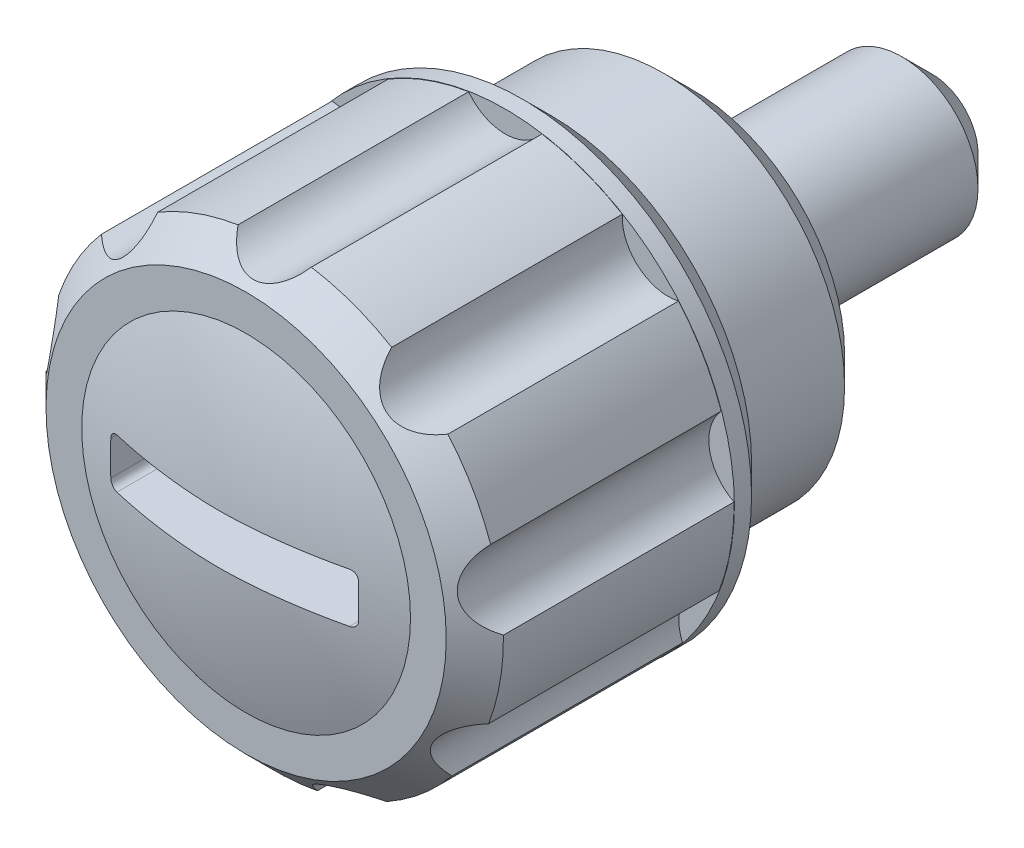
ISO-10303-21;
HEADER;
FILE_DESCRIPTION(('STEP AP214'),'2;1');
FILE_NAME('part.step','',(''),(''),'','','');
FILE_SCHEMA(('AUTOMOTIVE_DESIGN { 1 0 10303 214 1 1 1 1 }'));
ENDSEC;
DATA;
#1=APPLICATION_CONTEXT('core data for automotive mechanical design processes');
#2=APPLICATION_PROTOCOL_DEFINITION('international standard','automotive_design',2000,#1);
#3=PRODUCT_CONTEXT('',#1,'mechanical');
#4=PRODUCT('Part','Part','',(#3));
#5=PRODUCT_RELATED_PRODUCT_CATEGORY('part','',(#4));
#6=PRODUCT_DEFINITION_FORMATION('','',#4);
#7=PRODUCT_DEFINITION_CONTEXT('part definition',#1,'design');
#8=PRODUCT_DEFINITION('design','',#6,#7);
#9=PRODUCT_DEFINITION_SHAPE('','',#8);
#10=(LENGTH_UNIT() NAMED_UNIT(*) SI_UNIT(.MILLI.,.METRE.));
#11=(NAMED_UNIT(*) PLANE_ANGLE_UNIT() SI_UNIT($,.RADIAN.));
#12=(NAMED_UNIT(*) SI_UNIT($,.STERADIAN.) SOLID_ANGLE_UNIT());
#13=UNCERTAINTY_MEASURE_WITH_UNIT(LENGTH_MEASURE(1.E-05),#10,'distance_accuracy_value','');
#14=(GEOMETRIC_REPRESENTATION_CONTEXT(3) GLOBAL_UNCERTAINTY_ASSIGNED_CONTEXT((#13)) GLOBAL_UNIT_ASSIGNED_CONTEXT((#10,
#11,#12)) REPRESENTATION_CONTEXT('',''));
#15=CARTESIAN_POINT('',(0.,0.,0.));
#16=DIRECTION('',(0.,0.,1.));
#17=DIRECTION('',(1.,0.,0.));
#18=AXIS2_PLACEMENT_3D('',#15,#16,#17);
#19=CARTESIAN_POINT('',(0.,0.,-2.24502330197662));
#20=DIRECTION('',(0.,0.,1.));
#21=DIRECTION('',(1.,0.,0.));
#22=AXIS2_PLACEMENT_3D('',#19,#20,#21);
#23=DEGENERATE_TOROIDAL_SURFACE('',#22,0.386362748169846,14.9999999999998,.F.);
#24=CARTESIAN_POINT('',(0.,0.,12.));
#25=DIRECTION('',(0.,0.,1.));
#26=DIRECTION('',(1.,0.,0.));
#27=AXIS2_PLACEMENT_3D('',#24,#25,#26);
#28=CIRCLE('',#27,4.3125);
#29=CARTESIAN_POINT('',(4.3125,0.,12.));
#30=VERTEX_POINT('',#29);
#31=EDGE_CURVE('E351',#30,#30,#28,.T.);
#32=ORIENTED_EDGE('',*,*,#31,.T.);
#33=EDGE_LOOP('',(#32));
#34=FACE_BOUND('',#33,.T.);
#35=CARTESIAN_POINT('',(-3.0498,-0.649999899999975,12.3398097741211));
#36=CARTESIAN_POINT('',(-3.06120822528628,-0.650019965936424,12.3371277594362));
#37=CARTESIAN_POINT('',(-3.07262553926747,-0.649047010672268,12.3344789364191));
#38=CARTESIAN_POINT('',(-3.09516164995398,-0.645167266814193,12.3293198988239));
#39=CARTESIAN_POINT('',(-3.10628037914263,-0.642260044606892,12.326809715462));
#40=CARTESIAN_POINT('',(-3.1279071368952,-0.634560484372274,12.3219992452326));
#41=CARTESIAN_POINT('',(-3.13841459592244,-0.629766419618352,12.3196991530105));
#42=CARTESIAN_POINT('',(-3.15848770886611,-0.618413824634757,12.3153819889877));
#43=CARTESIAN_POINT('',(-3.16805381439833,-0.611856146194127,12.3133647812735));
#44=CARTESIAN_POINT('',(-3.18579781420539,-0.59727066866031,12.3097075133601));
#45=CARTESIAN_POINT('',(-3.19399634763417,-0.589269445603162,12.308061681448));
#46=CARTESIAN_POINT('',(-3.20893719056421,-0.571941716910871,12.3051577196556));
#47=CARTESIAN_POINT('',(-3.2156793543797,-0.562615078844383,12.303899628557));
#48=CARTESIAN_POINT('',(-3.22732440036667,-0.543172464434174,12.3018421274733));
#49=CARTESIAN_POINT('',(-3.23227144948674,-0.533084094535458,12.3010314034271));
#50=CARTESIAN_POINT('',(-3.24041051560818,-0.512202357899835,12.2998457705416));
#51=CARTESIAN_POINT('',(-3.24360397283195,-0.501409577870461,12.299470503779));
#52=CARTESIAN_POINT('',(-3.24725089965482,-0.483746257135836,12.2992265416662));
#53=CARTESIAN_POINT('',(-3.24828749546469,-0.476992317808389,12.2992171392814));
#54=CARTESIAN_POINT('',(-3.24966526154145,-0.4634255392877,12.2993633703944));
#55=CARTESIAN_POINT('',(-3.25000743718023,-0.456612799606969,12.2995187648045));
#56=CARTESIAN_POINT('',(-3.24999990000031,-0.449800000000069,12.2997561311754));
#57=B_SPLINE_CURVE_WITH_KNOTS('',3,(#35,#36,#37,#38,#39,#40,#41,#42,#43,#44,#45,#46,#47,#48,#49,
#50,#51,#52,#53,#54,#55,#56),.UNSPECIFIED.,.F.,.F.,(4,2,2,2,2,2,2,2,2,2,4),(0.,
0.0351172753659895,0.0702424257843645,0.10539979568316,0.140540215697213,0.175089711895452,
0.209642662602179,0.243276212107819,0.276882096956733,0.297346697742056,0.317781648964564),.UNSPECIFIED.);
#58=CARTESIAN_POINT('',(-3.05,-0.65,12.3397627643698));
#59=VERTEX_POINT('',#58);
#60=CARTESIAN_POINT('',(-3.25,-0.45,12.2997491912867));
#61=VERTEX_POINT('',#60);
#62=EDGE_CURVE('E462',#59,#61,#57,.T.);
#63=ORIENTED_EDGE('',*,*,#62,.T.);
#64=CARTESIAN_POINT('',(-3.25,0.,12.3075320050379));
#65=CARTESIAN_POINT('',(-3.25,0.277728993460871,12.3075356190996));
#66=CARTESIAN_POINT('',(-3.25,0.555440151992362,12.2986179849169));
#67=CARTESIAN_POINT('',(-3.25,1.10971337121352,12.2631914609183));
#68=CARTESIAN_POINT('',(-3.25,1.38627553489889,12.2366841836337));
#69=CARTESIAN_POINT('',(-3.25,1.93745588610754,12.1665755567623));
#70=CARTESIAN_POINT('',(-3.25,2.21207222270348,12.122959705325));
#71=CARTESIAN_POINT('',(-3.25,2.75819405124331,12.019207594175));
#72=CARTESIAN_POINT('',(-3.25,3.02969897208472,11.9590683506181));
#73=CARTESIAN_POINT('',(-3.25,3.68907942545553,11.7923343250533));
#74=CARTESIAN_POINT('',(-3.25,4.07477310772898,11.6769874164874));
#75=CARTESIAN_POINT('',(-3.25,4.83507528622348,11.4141726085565));
#76=CARTESIAN_POINT('',(-3.25,5.20968196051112,11.2666994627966));
#77=CARTESIAN_POINT('',(-3.25,5.94561682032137,10.9408021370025));
#78=CARTESIAN_POINT('',(-3.25,6.30693188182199,10.7623483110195));
#79=CARTESIAN_POINT('',(-3.25,7.013278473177,10.3760839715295));
#80=CARTESIAN_POINT('',(-3.25,7.35831779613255,10.1682877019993));
#81=CARTESIAN_POINT('',(-3.25,8.03118455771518,9.72399493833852));
#82=CARTESIAN_POINT('',(-3.25,8.35894545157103,9.48739766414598));
#83=CARTESIAN_POINT('',(-3.25,8.99368126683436,8.98778857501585));
#84=CARTESIAN_POINT('',(-3.25,9.30065586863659,8.72477635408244));
#85=CARTESIAN_POINT('',(-3.25,9.8916546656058,8.1742495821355));
#86=CARTESIAN_POINT('',(-3.25,10.1756840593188,7.88674061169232));
#87=CARTESIAN_POINT('',(-3.25,10.7189336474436,7.2891687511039));
#88=CARTESIAN_POINT('',(-3.25,10.9781537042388,6.97910573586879));
#89=CARTESIAN_POINT('',(-3.25,11.4737062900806,6.33376323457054));
#90=CARTESIAN_POINT('',(-3.25,11.7096373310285,5.9981753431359));
#91=CARTESIAN_POINT('',(-3.25,12.1524595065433,5.30835452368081));
#92=CARTESIAN_POINT('',(-3.25,12.3593503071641,4.95412138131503));
#93=CARTESIAN_POINT('',(-3.25,12.7426542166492,4.22948724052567));
#94=CARTESIAN_POINT('',(-3.25,12.9190643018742,3.85908464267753));
#95=CARTESIAN_POINT('',(-3.25,13.2401398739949,3.10476845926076));
#96=CARTESIAN_POINT('',(-3.25,13.3848053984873,2.72085488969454));
#97=CARTESIAN_POINT('',(-3.25,13.6416809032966,1.94130139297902));
#98=CARTESIAN_POINT('',(-3.25,13.753812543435,1.5456356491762));
#99=CARTESIAN_POINT('',(-3.25,13.944363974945,0.746267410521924));
#100=CARTESIAN_POINT('',(-3.25,14.0227836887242,0.342564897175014));
#101=CARTESIAN_POINT('',(-3.25,14.1453548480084,-0.469998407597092));
#102=CARTESIAN_POINT('',(-3.25,14.1895071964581,-0.8788590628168));
#103=CARTESIAN_POINT('',(-3.25,14.2432347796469,-1.69884576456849));
#104=CARTESIAN_POINT('',(-3.25,14.2528100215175,-2.10997181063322));
#105=CARTESIAN_POINT('',(-3.25,14.2373111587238,-2.93180992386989));
#106=CARTESIAN_POINT('',(-3.25,14.2122168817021,-3.34252161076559));
#107=CARTESIAN_POINT('',(-3.25,14.1275207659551,-4.16037161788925));
#108=CARTESIAN_POINT('',(-3.25,14.0679189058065,-4.56750993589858));
#109=CARTESIAN_POINT('',(-3.25,13.9146256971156,-5.37533907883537));
#110=CARTESIAN_POINT('',(-3.25,13.8209326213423,-5.77602957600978));
#111=CARTESIAN_POINT('',(-3.25,13.6001207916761,-6.568092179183));
#112=CARTESIAN_POINT('',(-3.25,13.4730020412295,-6.95946428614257));
#113=CARTESIAN_POINT('',(-3.25,13.186232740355,-7.7301217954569));
#114=CARTESIAN_POINT('',(-3.25,13.0265808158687,-8.10940668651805));
#115=CARTESIAN_POINT('',(-3.25,12.6758786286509,-8.85317181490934));
#116=CARTESIAN_POINT('',(-3.25,12.4848283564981,-9.21765204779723));
#117=CARTESIAN_POINT('',(-3.25,12.072711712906,-9.92915798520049));
#118=CARTESIAN_POINT('',(-3.25,11.8516496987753,-10.2761862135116));
#119=CARTESIAN_POINT('',(-3.25,11.3810523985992,-10.9503675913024));
#120=CARTESIAN_POINT('',(-3.25,11.1315171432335,-11.2775207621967));
#121=CARTESIAN_POINT('',(-3.25,10.6059307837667,-11.9093794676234));
#122=CARTESIAN_POINT('',(-3.25,10.3298992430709,-12.2141012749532));
#123=CARTESIAN_POINT('',(-3.25,9.75311451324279,-12.7991756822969));
#124=CARTESIAN_POINT('',(-3.25,9.45236128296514,-13.0795282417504));
#125=CARTESIAN_POINT('',(-3.25,8.82813062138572,-13.6139441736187));
#126=CARTESIAN_POINT('',(-3.25,8.50464416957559,-13.8679970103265));
#127=CARTESIAN_POINT('',(-3.25,7.8373363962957,-14.3478241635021));
#128=CARTESIAN_POINT('',(-3.25,7.49351512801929,-14.573598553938));
#129=CARTESIAN_POINT('',(-3.25,6.78879460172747,-14.9946762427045));
#130=CARTESIAN_POINT('',(-3.25,6.42793763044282,-15.1900503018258));
#131=CARTESIAN_POINT('',(-3.25,5.69092259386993,-15.5494366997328));
#132=CARTESIAN_POINT('',(-3.25,5.31476441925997,-15.7134488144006));
#133=CARTESIAN_POINT('',(-3.25,4.54996490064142,-16.0086112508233));
#134=CARTESIAN_POINT('',(-3.25,4.16132971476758,-16.1397775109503));
#135=CARTESIAN_POINT('',(-3.25,3.37414151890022,-16.367940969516));
#136=CARTESIAN_POINT('',(-3.25,2.97558824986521,-16.4649372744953));
#137=CARTESIAN_POINT('',(-3.25,2.17796770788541,-16.6218590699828));
#138=CARTESIAN_POINT('',(-3.25,1.77901685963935,-16.682368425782));
#139=CARTESIAN_POINT('',(-3.25,1.17783289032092,-16.7458571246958));
#140=CARTESIAN_POINT('',(-3.25,0.976962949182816,-16.7624743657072));
#141=CARTESIAN_POINT('',(-3.25,0.574677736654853,-16.7864370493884));
#142=CARTESIAN_POINT('',(-3.25,0.373262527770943,-16.7937835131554));
#143=CARTESIAN_POINT('',(-3.25,-0.0296307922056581,-16.7991040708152));
#144=CARTESIAN_POINT('',(-3.25,-0.231108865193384,-16.7970810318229));
#145=CARTESIAN_POINT('',(-3.25,-0.633740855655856,-16.7837024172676));
#146=CARTESIAN_POINT('',(-3.25,-0.834894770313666,-16.7723467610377));
#147=CARTESIAN_POINT('',(-3.25,-1.43727360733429,-16.7244784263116));
#148=CARTESIAN_POINT('',(-3.25,-1.83748615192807,-16.6741652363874));
#149=CARTESIAN_POINT('',(-3.25,-2.60244344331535,-16.5434913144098));
#150=CARTESIAN_POINT('',(-3.25,-2.9676242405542,-16.465624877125));
#151=CARTESIAN_POINT('',(-3.25,-3.69061293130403,-16.2811099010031));
#152=CARTESIAN_POINT('',(-3.25,-4.04842149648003,-16.1744639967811));
#153=CARTESIAN_POINT('',(-3.25,-4.75476881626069,-15.9334225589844));
#154=CARTESIAN_POINT('',(-3.25,-5.10330243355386,-15.7990119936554));
#155=CARTESIAN_POINT('',(-3.25,-5.78889033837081,-15.5035347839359));
#156=CARTESIAN_POINT('',(-3.25,-6.12594408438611,-15.3424668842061));
#157=CARTESIAN_POINT('',(-3.25,-6.80932679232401,-14.9828170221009));
#158=CARTESIAN_POINT('',(-3.25,-7.15470066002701,-14.7824174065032));
#159=CARTESIAN_POINT('',(-3.25,-7.82779768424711,-14.3538815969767));
#160=CARTESIAN_POINT('',(-3.25,-8.15552013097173,-14.1257442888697));
#161=CARTESIAN_POINT('',(-3.25,-8.79107255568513,-13.6433774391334));
#162=CARTESIAN_POINT('',(-3.25,-9.09890611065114,-13.3891526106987));
#163=CARTESIAN_POINT('',(-3.25,-9.69269581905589,-12.8563257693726));
#164=CARTESIAN_POINT('',(-3.25,-9.97865187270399,-12.5777236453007));
#165=CARTESIAN_POINT('',(-3.25,-10.5337680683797,-11.9906483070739));
#166=CARTESIAN_POINT('',(-3.25,-10.8023152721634,-11.6815951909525));
#167=CARTESIAN_POINT('',(-3.25,-11.3125257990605,-11.0420356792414));
#168=CARTESIAN_POINT('',(-3.25,-11.5541885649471,-10.7115288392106));
#169=CARTESIAN_POINT('',(-3.25,-12.0089741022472,-10.0313455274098));
#170=CARTESIAN_POINT('',(-3.25,-12.2220918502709,-9.6816656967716));
#171=CARTESIAN_POINT('',(-3.25,-12.6182423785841,-8.96566280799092));
#172=CARTESIAN_POINT('',(-3.25,-12.8012752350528,-8.59933979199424));
#173=CARTESIAN_POINT('',(-3.25,-13.1366167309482,-7.85119993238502));
#174=CARTESIAN_POINT('',(-3.25,-13.2888047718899,-7.46932902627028));
#175=CARTESIAN_POINT('',(-3.25,-13.5604975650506,-6.69413124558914));
#176=CARTESIAN_POINT('',(-3.25,-13.680002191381,-6.30080432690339));
#177=CARTESIAN_POINT('',(-3.25,-13.885478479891,-5.505506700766));
#178=CARTESIAN_POINT('',(-3.25,-13.9714517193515,-5.10353640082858));
#179=CARTESIAN_POINT('',(-3.25,-14.1092657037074,-4.29378701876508));
#180=CARTESIAN_POINT('',(-3.25,-14.1611064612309,-3.88600793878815));
#181=CARTESIAN_POINT('',(-3.25,-14.2303212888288,-3.06715435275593));
#182=CARTESIAN_POINT('',(-3.25,-14.2476633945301,-2.65607714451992));
#183=CARTESIAN_POINT('',(-3.25,-14.2476620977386,-1.83392251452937));
#184=CARTESIAN_POINT('',(-3.25,-14.2303186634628,-1.42284509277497));
#185=CARTESIAN_POINT('',(-3.25,-14.1610682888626,-0.603603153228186));
#186=CARTESIAN_POINT('',(-3.25,-14.1091606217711,-0.195438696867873));
#187=CARTESIAN_POINT('',(-3.25,-13.9711485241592,0.615067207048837));
#188=CARTESIAN_POINT('',(-3.25,-13.885044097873,1.01740865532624));
#189=CARTESIAN_POINT('',(-3.25,-13.6792331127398,1.81346557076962));
#190=CARTESIAN_POINT('',(-3.25,-13.5595217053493,2.20717978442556));
#191=CARTESIAN_POINT('',(-3.25,-13.2873494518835,2.98312116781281));
#192=CARTESIAN_POINT('',(-3.25,-13.1348885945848,3.36534833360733));
#193=CARTESIAN_POINT('',(-3.25,-12.7982999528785,4.11558729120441));
#194=CARTESIAN_POINT('',(-3.25,-12.6141727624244,4.48359934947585));
#195=CARTESIAN_POINT('',(-3.25,-12.2155528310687,5.20279306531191));
#196=CARTESIAN_POINT('',(-3.25,-12.0010601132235,5.55397473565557));
#197=CARTESIAN_POINT('',(-3.25,-11.5433180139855,6.2368658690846));
#198=CARTESIAN_POINT('',(-3.25,-11.3000801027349,6.56858302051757));
#199=CARTESIAN_POINT('',(-3.25,-10.7864981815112,7.2103264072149));
#200=CARTESIAN_POINT('',(-3.25,-10.5161541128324,7.52035259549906));
#201=CARTESIAN_POINT('',(-3.25,-9.95025306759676,8.11650757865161));
#202=CARTESIAN_POINT('',(-3.25,-9.65469453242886,8.4026348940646));
#203=CARTESIAN_POINT('',(-3.25,-9.04046877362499,8.94890264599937));
#204=CARTESIAN_POINT('',(-3.25,-8.72180175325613,9.20904331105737));
#205=CARTESIAN_POINT('',(-3.25,-8.06411837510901,9.70105813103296));
#206=CARTESIAN_POINT('',(-3.25,-7.72513441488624,9.93297559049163));
#207=CARTESIAN_POINT('',(-3.25,-7.02875492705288,10.3672880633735));
#208=CARTESIAN_POINT('',(-3.25,-6.67135962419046,10.5696834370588));
#209=CARTESIAN_POINT('',(-3.25,-5.94066060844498,10.9433896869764));
#210=CARTESIAN_POINT('',(-3.25,-5.56735649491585,11.1146997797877));
#211=CARTESIAN_POINT('',(-3.25,-4.80749189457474,11.4247686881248));
#212=CARTESIAN_POINT('',(-3.25,-4.42093314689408,11.5635317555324));
#213=CARTESIAN_POINT('',(-3.25,-3.70318039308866,11.786627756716));
#214=CARTESIAN_POINT('',(-3.25,-3.37360154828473,11.876189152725));
#215=CARTESIAN_POINT('',(-3.25,-2.70877137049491,12.0309482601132));
#216=CARTESIAN_POINT('',(-3.25,-2.37352047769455,12.0961478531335));
#217=CARTESIAN_POINT('',(-3.25,-1.69957377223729,12.2010954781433));
#218=CARTESIAN_POINT('',(-3.25,-1.36088404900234,12.2408824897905));
#219=CARTESIAN_POINT('',(-3.25,-0.681453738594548,12.2940966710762));
#220=CARTESIAN_POINT('',(-3.25,-0.340713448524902,12.3075275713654));
#221=CARTESIAN_POINT('',(-3.25,0.,12.3075320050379));
#222=B_SPLINE_CURVE_WITH_KNOTS('',3,(#64,#65,#66,#67,#68,#69,#70,#71,#72,#73,#74,#75,#76,#77,
#78,#79,#80,#81,#82,#83,#84,#85,#86,#87,#88,#89,#90,#91,#92,#93,#94,#95,#96,#97,#98,#99,#100,
#101,#102,#103,#104,#105,#106,#107,#108,#109,#110,#111,#112,#113,#114,#115,#116,#117,#118,#119,
#120,#121,#122,#123,#124,#125,#126,#127,#128,#129,#130,#131,#132,#133,#134,#135,#136,#137,#138,
#139,#140,#141,#142,#143,#144,#145,#146,#147,#148,#149,#150,#151,#152,#153,#154,#155,#156,#157,
#158,#159,#160,#161,#162,#163,#164,#165,#166,#167,#168,#169,#170,#171,#172,#173,#174,#175,#176,
#177,#178,#179,#180,#181,#182,#183,#184,#185,#186,#187,#188,#189,#190,#191,#192,#193,#194,#195,
#196,#197,#198,#199,#200,#201,#202,#203,#204,#205,#206,#207,#208,#209,#210,#211,#212,#213,#214,
#215,#216,#217,#218,#219,#220,#221),.UNSPECIFIED.,.T.,.F.,(4,2,2,2,2,2,2,2,2,2,2,2,2,2,2,2,2,2,
2,2,2,2,2,2,2,2,2,2,2,2,2,2,2,2,2,2,2,2,2,2,2,2,2,2,2,2,2,2,2,2,2,2,2,2,2,2,2,2,2,2,2,2,2,2,2,2,
2,2,2,2,2,2,2,2,2,2,2,2,4),(0.,0.833015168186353,1.66595398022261,2.49960035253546,
3.33339736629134,4.53957397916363,5.74594771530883,6.95348227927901,8.16043266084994,
9.37173482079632,10.583055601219,11.7941011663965,13.0051534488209,14.2343656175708,
15.4635919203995,16.6929400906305,17.9222868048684,19.15456962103,20.3868552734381,
21.6191084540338,22.8513613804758,24.0843315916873,25.3173025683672,26.5503360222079,
27.7833693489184,29.01645476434,30.2495405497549,31.4824474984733,32.7153531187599,
33.9473553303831,35.1793595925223,36.4118555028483,37.6443481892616,38.8739277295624,
40.1035160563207,41.3325065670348,42.5615292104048,43.7703236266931,44.3748145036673,
44.97923879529,45.583478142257,46.1877227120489,47.3960010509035,48.5150195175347,
49.6339355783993,50.7534590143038,51.8730351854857,53.0695719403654,54.2661567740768,
55.4625258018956,56.658900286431,57.8857327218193,59.1125905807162,60.3396640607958,
61.5667344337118,62.7985136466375,64.0302976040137,65.2620236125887,66.4937491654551,
67.7266154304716,68.9594828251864,70.1923761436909,71.4252693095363,72.6583404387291,
73.8914119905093,75.1244604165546,76.3575079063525,77.5900650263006,78.8226248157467,
80.05526085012,81.2878860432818,82.5185954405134,83.7492898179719,84.9800152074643,
86.2105797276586,87.2343070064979,88.2579551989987,89.2800294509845,90.3019590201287),.UNSPECIFIED.);
#223=CARTESIAN_POINT('',(-3.25,0.45,12.2997491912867));
#224=VERTEX_POINT('',#223);
#225=EDGE_CURVE('E194',#61,#224,#222,.T.);
#226=ORIENTED_EDGE('',*,*,#225,.T.);
#227=CARTESIAN_POINT('',(-3.24999989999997,0.4498,12.2997561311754));
#228=CARTESIAN_POINT('',(-3.25002147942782,0.460776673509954,12.2993714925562));
#229=CARTESIAN_POINT('',(-3.24911882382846,0.471758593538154,12.2992032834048));
#230=CARTESIAN_POINT('',(-3.24553635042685,0.493412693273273,12.2992941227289));
#231=CARTESIAN_POINT('',(-3.24285883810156,0.504085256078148,12.299552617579));
#232=CARTESIAN_POINT('',(-3.23579622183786,0.524834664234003,12.3004904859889));
#233=CARTESIAN_POINT('',(-3.23141042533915,0.53491126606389,12.3011700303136));
#234=CARTESIAN_POINT('',(-3.22107038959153,0.554184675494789,12.3029273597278));
#235=CARTESIAN_POINT('',(-3.21511623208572,0.563381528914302,12.3040051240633));
#236=CARTESIAN_POINT('',(-3.20177417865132,0.580709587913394,12.3065339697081));
#237=CARTESIAN_POINT('',(-3.19437690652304,0.588833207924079,12.3079875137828));
#238=CARTESIAN_POINT('',(-3.17839327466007,0.603735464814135,12.3112205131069));
#239=CARTESIAN_POINT('',(-3.16980667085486,0.610513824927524,12.3130000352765));
#240=CARTESIAN_POINT('',(-3.15148706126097,0.62269653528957,12.3168763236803));
#241=CARTESIAN_POINT('',(-3.14173272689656,0.628066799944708,12.3189792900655));
#242=CARTESIAN_POINT('',(-3.12151319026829,0.637105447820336,12.3234120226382));
#243=CARTESIAN_POINT('',(-3.11104805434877,0.640773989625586,12.3257417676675));
#244=CARTESIAN_POINT('',(-3.09210451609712,0.64570458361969,12.3300193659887));
#245=CARTESIAN_POINT('',(-3.08370936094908,0.647322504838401,12.3319350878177));
#246=CARTESIAN_POINT('',(-3.06680849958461,0.649474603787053,12.3358309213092));
#247=CARTESIAN_POINT('',(-3.05830296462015,0.650010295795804,12.3378109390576));
#248=CARTESIAN_POINT('',(-3.0498,0.649999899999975,12.3398097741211));
#249=B_SPLINE_CURVE_WITH_KNOTS('',3,(#227,#228,#229,#230,#231,#232,#233,#234,#235,#236,#237,
#238,#239,#240,#241,#242,#243,#244,#245,#246,#247,#248),.UNSPECIFIED.,.F.,.F.,(4,2,2,2,2,2,2,2,
2,2,4),(0.,0.0329053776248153,0.0657680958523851,0.0986441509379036,0.13151849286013,
0.1646140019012,0.197716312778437,0.231558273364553,0.265397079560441,0.291616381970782,
0.31779897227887),.UNSPECIFIED.);
#250=CARTESIAN_POINT('',(-3.04999999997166,0.65,12.3397627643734));
#251=VERTEX_POINT('',#250);
#252=EDGE_CURVE('E416',#224,#251,#249,.T.);
#253=ORIENTED_EDGE('',*,*,#252,.T.);
#254=CARTESIAN_POINT('',(0.,0.65,12.7191322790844));
#255=CARTESIAN_POINT('',(0.108520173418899,0.65,12.7191277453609));
#256=CARTESIAN_POINT('',(0.217041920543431,0.65,12.7172094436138));
#257=CARTESIAN_POINT('',(0.433997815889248,0.65,12.7099981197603));
#258=CARTESIAN_POINT('',(0.542431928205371,0.65,12.7047040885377));
#259=CARTESIAN_POINT('',(0.759555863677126,0.65,12.6912706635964));
#260=CARTESIAN_POINT('',(0.868244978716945,0.65,12.6831199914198));
#261=CARTESIAN_POINT('',(1.08539837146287,0.65,12.6642185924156));
#262=CARTESIAN_POINT('',(1.19386263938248,0.65,12.6534677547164));
#263=CARTESIAN_POINT('',(1.51887735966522,0.65,12.6174925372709));
#264=CARTESIAN_POINT('',(1.73502604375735,0.65,12.5885469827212));
#265=CARTESIAN_POINT('',(2.16611297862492,0.65,12.5210525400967));
#266=CARTESIAN_POINT('',(2.38104917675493,0.65,12.4824906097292));
#267=CARTESIAN_POINT('',(2.80901885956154,0.65,12.3959374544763));
#268=CARTESIAN_POINT('',(3.02205219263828,0.65,12.3479454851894));
#269=CARTESIAN_POINT('',(3.64169701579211,0.65,12.1939819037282));
#270=CARTESIAN_POINT('',(4.04525595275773,0.65,12.0754170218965));
#271=CARTESIAN_POINT('',(4.84106887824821,0.65,11.804706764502));
#272=CARTESIAN_POINT('',(5.23331827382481,0.65,11.6525479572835));
#273=CARTESIAN_POINT('',(6.00390173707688,0.65,11.3156534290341));
#274=CARTESIAN_POINT('',(6.382226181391,0.65,11.1308956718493));
#275=CARTESIAN_POINT('',(7.12194189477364,0.65,10.7302214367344));
#276=CARTESIAN_POINT('',(7.48333496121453,0.65,10.5143082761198));
#277=CARTESIAN_POINT('',(8.18679974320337,0.65,10.0527629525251));
#278=CARTESIAN_POINT('',(8.52886465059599,0.65,9.80712041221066));
#279=CARTESIAN_POINT('',(9.19111928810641,0.65,9.28791513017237));
#280=CARTESIAN_POINT('',(9.51130841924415,0.65,9.01435162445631));
#281=CARTESIAN_POINT('',(10.1275007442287,0.65,8.44128082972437));
#282=CARTESIAN_POINT('',(10.4235063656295,0.65,8.14177615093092));
#283=CARTESIAN_POINT('',(10.9892674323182,0.65,7.51892636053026));
#284=CARTESIAN_POINT('',(11.2590230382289,0.65,7.19558139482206));
#285=CARTESIAN_POINT('',(11.7706885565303,0.65,6.52693164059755));
#286=CARTESIAN_POINT('',(12.012563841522,0.65,6.18160035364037));
#287=CARTESIAN_POINT('',(12.4663665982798,0.65,5.47179015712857));
#288=CARTESIAN_POINT('',(12.6782939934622,0.65,5.10731119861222));
#289=CARTESIAN_POINT('',(13.0706918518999,0.65,4.36180202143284));
#290=CARTESIAN_POINT('',(13.2511627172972,0.65,3.98077201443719));
#291=CARTESIAN_POINT('',(13.5793682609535,0.65,3.20486500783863));
#292=CARTESIAN_POINT('',(13.7271029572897,0.65,2.80998801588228));
#293=CARTESIAN_POINT('',(13.988800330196,0.65,2.00915107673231));
#294=CARTESIAN_POINT('',(14.1027594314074,0.65,1.60318996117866));
#295=CARTESIAN_POINT('',(14.2960746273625,0.65,0.783110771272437));
#296=CARTESIAN_POINT('',(14.3754307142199,0.65,0.368992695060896));
#297=CARTESIAN_POINT('',(14.498977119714,0.65,-0.464465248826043));
#298=CARTESIAN_POINT('',(14.5431666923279,0.65,-0.883805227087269));
#299=CARTESIAN_POINT('',(14.596063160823,0.65,-1.72471716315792));
#300=CARTESIAN_POINT('',(14.6047700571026,0.65,-2.1462891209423));
#301=CARTESIAN_POINT('',(14.5866390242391,0.65,-2.98868011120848));
#302=CARTESIAN_POINT('',(14.5598000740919,0.65,-3.40949912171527));
#303=CARTESIAN_POINT('',(14.4707663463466,0.65,-4.24738022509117));
#304=CARTESIAN_POINT('',(14.4085715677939,0.65,-4.66444231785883));
#305=CARTESIAN_POINT('',(14.2492707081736,0.65,-5.49183187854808));
#306=CARTESIAN_POINT('',(14.1521656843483,0.65,-5.90215955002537));
#307=CARTESIAN_POINT('',(13.92373427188,0.65,-6.7131760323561));
#308=CARTESIAN_POINT('',(13.7924078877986,0.65,-7.11386484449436));
#309=CARTESIAN_POINT('',(13.4964692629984,0.65,-7.90274953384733));
#310=CARTESIAN_POINT('',(13.3318574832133,0.65,-8.29094558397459));
#311=CARTESIAN_POINT('',(12.9705168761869,0.65,-9.05209088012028));
#312=CARTESIAN_POINT('',(12.7737880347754,0.65,-9.42504011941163));
#313=CARTESIAN_POINT('',(12.3495993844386,0.65,-10.1530610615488));
#314=CARTESIAN_POINT('',(12.1221378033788,0.65,-10.5081317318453));
#315=CARTESIAN_POINT('',(11.6381096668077,0.65,-11.1978469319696));
#316=CARTESIAN_POINT('',(11.3815431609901,0.65,-11.5324914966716));
#317=CARTESIAN_POINT('',(10.8411381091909,0.65,-12.1789638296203));
#318=CARTESIAN_POINT('',(10.5573005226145,0.65,-12.4907923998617));
#319=CARTESIAN_POINT('',(9.9643609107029,0.65,-13.0894299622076));
#320=CARTESIAN_POINT('',(9.65525870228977,0.65,-13.3762387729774));
#321=CARTESIAN_POINT('',(9.01399860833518,0.65,-13.9227850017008));
#322=CARTESIAN_POINT('',(8.681841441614,0.65,-14.1825232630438));
#323=CARTESIAN_POINT('',(7.99683299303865,0.65,-14.6730822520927));
#324=CARTESIAN_POINT('',(7.64398231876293,0.65,-14.9039038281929));
#325=CARTESIAN_POINT('',(6.92002553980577,0.65,-15.335028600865));
#326=CARTESIAN_POINT('',(6.5489163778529,0.65,-15.5353266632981));
#327=CARTESIAN_POINT('',(5.79113277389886,0.65,-15.903924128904));
#328=CARTESIAN_POINT('',(5.40445847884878,0.65,-16.0722238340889));
#329=CARTESIAN_POINT('',(4.61839618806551,0.65,-16.3755712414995));
#330=CARTESIAN_POINT('',(4.21901109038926,0.65,-16.5106264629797));
#331=CARTESIAN_POINT('',(3.41037855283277,0.65,-16.7464936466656));
#332=CARTESIAN_POINT('',(3.00113546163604,0.65,-16.8473204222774));
#333=CARTESIAN_POINT('',(2.37474825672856,0.65,-16.9737106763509));
#334=CARTESIAN_POINT('',(2.16011736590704,0.65,-17.0121235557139));
#335=CARTESIAN_POINT('',(1.72933145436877,0.65,-17.0793970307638));
#336=CARTESIAN_POINT('',(1.51317639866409,0.65,-17.1082574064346));
#337=CARTESIAN_POINT('',(1.1883245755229,0.65,-17.1440821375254));
#338=CARTESIAN_POINT('',(1.08002619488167,0.65,-17.1547737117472));
#339=CARTESIAN_POINT('',(0.863198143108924,0.65,-17.1735629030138));
#340=CARTESIAN_POINT('',(0.754668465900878,0.65,-17.1816604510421));
#341=CARTESIAN_POINT('',(0.537464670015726,0.65,-17.1950151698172));
#342=CARTESIAN_POINT('',(0.42879060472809,0.65,-17.2002731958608));
#343=CARTESIAN_POINT('',(0.211334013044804,0.65,-17.20738850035));
#344=CARTESIAN_POINT('',(0.102551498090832,0.65,-17.2092461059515));
#345=CARTESIAN_POINT('',(-0.098037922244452,0.65,-17.2091183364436));
#346=CARTESIAN_POINT('',(-0.189845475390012,0.65,-17.2076873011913));
#347=CARTESIAN_POINT('',(-0.373392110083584,0.65,-17.2023544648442));
#348=CARTESIAN_POINT('',(-0.465131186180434,0.65,-17.1984524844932));
#349=CARTESIAN_POINT('',(-0.648525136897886,0.65,-17.1885366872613));
#350=CARTESIAN_POINT('',(-0.740179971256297,0.65,-17.1825221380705));
#351=CARTESIAN_POINT('',(-0.923340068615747,0.65,-17.1685825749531));
#352=CARTESIAN_POINT('',(-1.01484533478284,0.65,-17.1606576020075));
#353=CARTESIAN_POINT('',(-1.28932831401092,0.65,-17.1341570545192));
#354=CARTESIAN_POINT('',(-1.47205047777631,0.65,-17.1128685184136));
#355=CARTESIAN_POINT('',(-1.83651738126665,0.65,-17.0634122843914));
#356=CARTESIAN_POINT('',(-2.01826229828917,0.65,-17.0352458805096));
#357=CARTESIAN_POINT('',(-2.38129600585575,0.65,-16.9720306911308));
#358=CARTESIAN_POINT('',(-2.56258014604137,0.65,-16.936955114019));
#359=CARTESIAN_POINT('',(-2.92371751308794,0.65,-16.8600846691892));
#360=CARTESIAN_POINT('',(-3.10357066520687,0.65,-16.8182894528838));
#361=CARTESIAN_POINT('',(-3.64033450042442,0.65,-16.6830040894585));
#362=CARTESIAN_POINT('',(-3.9947892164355,0.65,-16.57955495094));
#363=CARTESIAN_POINT('',(-4.71178689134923,0.65,-16.3411791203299));
#364=CARTESIAN_POINT('',(-5.07390702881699,0.65,-16.2049845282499));
#365=CARTESIAN_POINT('',(-5.78663052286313,0.65,-15.9049349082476));
#366=CARTESIAN_POINT('',(-6.13723052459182,0.65,-15.7410719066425));
#367=CARTESIAN_POINT('',(-6.82400082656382,0.65,-15.3870663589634));
#368=CARTESIAN_POINT('',(-7.16019896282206,0.65,-15.1969778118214));
#369=CARTESIAN_POINT('',(-7.81689468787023,0.65,-14.7914249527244));
#370=CARTESIAN_POINT('',(-8.13739298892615,0.65,-14.5759617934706));
#371=CARTESIAN_POINT('',(-8.7889588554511,0.65,-14.1003791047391));
#372=CARTESIAN_POINT('',(-9.118369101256,0.65,-13.8379842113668));
#373=CARTESIAN_POINT('',(-9.75396306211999,0.65,-13.2863857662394));
#374=CARTESIAN_POINT('',(-10.0601446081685,0.65,-12.9971797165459));
#375=CARTESIAN_POINT('',(-10.6473742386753,0.65,-12.3937305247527));
#376=CARTESIAN_POINT('',(-10.9283974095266,0.65,-12.0794631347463));
#377=CARTESIAN_POINT('',(-11.4629667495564,0.65,-11.4283824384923));
#378=CARTESIAN_POINT('',(-11.716513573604,0.65,-11.0915696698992));
#379=CARTESIAN_POINT('',(-12.1943966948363,0.65,-10.3976989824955));
#380=CARTESIAN_POINT('',(-12.4187257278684,0.65,-10.0406360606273));
#381=CARTESIAN_POINT('',(-12.836505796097,0.65,-9.30887820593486));
#382=CARTESIAN_POINT('',(-13.0299566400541,0.65,-8.93418316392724));
#383=CARTESIAN_POINT('',(-13.3845512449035,0.65,-8.1699401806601));
#384=CARTESIAN_POINT('',(-13.5457045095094,0.65,-7.78039664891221));
#385=CARTESIAN_POINT('',(-13.8346300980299,0.65,-6.98912166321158));
#386=CARTESIAN_POINT('',(-13.9624024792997,0.65,-6.58739023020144));
#387=CARTESIAN_POINT('',(-14.1836800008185,0.65,-5.77451590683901));
#388=CARTESIAN_POINT('',(-14.2771785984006,0.65,-5.36337123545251));
#389=CARTESIAN_POINT('',(-14.4292098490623,0.65,-4.53466691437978));
#390=CARTESIAN_POINT('',(-14.487742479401,0.65,-4.11710726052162));
#391=CARTESIAN_POINT('',(-14.5694291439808,0.65,-3.27850601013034));
#392=CARTESIAN_POINT('',(-14.5925801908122,0.65,-2.85746412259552));
#393=CARTESIAN_POINT('',(-14.6033296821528,0.65,-2.01492679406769));
#394=CARTESIAN_POINT('',(-14.5909281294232,0.65,-1.59343135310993));
#395=CARTESIAN_POINT('',(-14.5306606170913,0.65,-0.752983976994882));
#396=CARTESIAN_POINT('',(-14.4827946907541,0.65,-0.334032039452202));
#397=CARTESIAN_POINT('',(-14.351938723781,0.65,0.49835010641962));
#398=CARTESIAN_POINT('',(-14.2689486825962,0.65,0.911780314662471));
#399=CARTESIAN_POINT('',(-14.0684388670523,0.65,1.73016147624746));
#400=CARTESIAN_POINT('',(-13.9509206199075,0.65,2.13511280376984));
#401=CARTESIAN_POINT('',(-13.6821883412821,0.65,2.93367609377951));
#402=CARTESIAN_POINT('',(-13.5309743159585,0.65,3.32728805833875));
#403=CARTESIAN_POINT('',(-13.1959267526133,0.65,4.10037092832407));
#404=CARTESIAN_POINT('',(-13.0120935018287,0.65,4.47984195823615));
#405=CARTESIAN_POINT('',(-12.6131130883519,0.65,5.22194896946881));
#406=CARTESIAN_POINT('',(-12.3979659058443,0.65,5.58458494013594));
#407=CARTESIAN_POINT('',(-11.9378740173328,0.65,6.29046298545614));
#408=CARTESIAN_POINT('',(-11.6929276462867,0.65,6.63370397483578));
#409=CARTESIAN_POINT('',(-11.1749886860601,0.65,7.29832838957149));
#410=CARTESIAN_POINT('',(-10.9019961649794,0.65,7.61971186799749));
#411=CARTESIAN_POINT('',(-10.3299256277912,0.65,8.23831388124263));
#412=CARTESIAN_POINT('',(-10.0308495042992,0.65,8.53553416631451));
#413=CARTESIAN_POINT('',(-9.40871715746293,0.65,9.10372430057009));
#414=CARTESIAN_POINT('',(-9.08566069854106,0.65,9.37469389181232));
#415=CARTESIAN_POINT('',(-8.41785441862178,0.65,9.88845978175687));
#416=CARTESIAN_POINT('',(-8.07310383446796,0.65,10.1312550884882));
#417=CARTESIAN_POINT('',(-7.36438263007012,0.65,10.5869228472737));
#418=CARTESIAN_POINT('',(-7.00041275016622,0.65,10.799796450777));
#419=CARTESIAN_POINT('',(-6.25574024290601,0.65,11.1941576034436));
#420=CARTESIAN_POINT('',(-5.87503367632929,0.65,11.3756377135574));
#421=CARTESIAN_POINT('',(-5.09960838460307,0.65,11.7058730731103));
#422=CARTESIAN_POINT('',(-4.70488757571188,0.65,11.8546234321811));
#423=CARTESIAN_POINT('',(-3.90465475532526,0.65,12.118151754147));
#424=CARTESIAN_POINT('',(-3.49915214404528,0.65,12.2329583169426));
#425=CARTESIAN_POINT('',(-2.67985286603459,0.65,12.4278850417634));
#426=CARTESIAN_POINT('',(-2.26605705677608,0.65,12.5080087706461));
#427=CARTESIAN_POINT('',(-1.69646981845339,0.65,12.5931341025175));
#428=CARTESIAN_POINT('',(-1.54287539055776,0.65,12.6136119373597));
#429=CARTESIAN_POINT('',(-1.23513895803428,0.65,12.6495835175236));
#430=CARTESIAN_POINT('',(-1.08099712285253,0.65,12.6650786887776));
#431=CARTESIAN_POINT('',(-0.772511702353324,0.65,12.6907884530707));
#432=CARTESIAN_POINT('',(-0.618168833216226,0.65,12.7010114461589));
#433=CARTESIAN_POINT('',(-0.386454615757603,0.65,12.7116612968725));
#434=CARTESIAN_POINT('',(-0.309189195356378,0.65,12.7144304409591));
#435=CARTESIAN_POINT('',(-0.154616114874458,0.65,12.7181675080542));
#436=CARTESIAN_POINT('',(-0.0773084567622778,0.65,12.7191355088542));
#437=CARTESIAN_POINT('',(0.,0.65,12.7191322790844));
#438=B_SPLINE_CURVE_WITH_KNOTS('',3,(#254,#255,#256,#257,#258,#259,#260,#261,#262,#263,#264,
#265,#266,#267,#268,#269,#270,#271,#272,#273,#274,#275,#276,#277,#278,#279,#280,#281,#282,#283,
#284,#285,#286,#287,#288,#289,#290,#291,#292,#293,#294,#295,#296,#297,#298,#299,#300,#301,#302,
#303,#304,#305,#306,#307,#308,#309,#310,#311,#312,#313,#314,#315,#316,#317,#318,#319,#320,#321,
#322,#323,#324,#325,#326,#327,#328,#329,#330,#331,#332,#333,#334,#335,#336,#337,#338,#339,#340,
#341,#342,#343,#344,#345,#346,#347,#348,#349,#350,#351,#352,#353,#354,#355,#356,#357,#358,#359,
#360,#361,#362,#363,#364,#365,#366,#367,#368,#369,#370,#371,#372,#373,#374,#375,#376,#377,#378,
#379,#380,#381,#382,#383,#384,#385,#386,#387,#388,#389,#390,#391,#392,#393,#394,#395,#396,#397,
#398,#399,#400,#401,#402,#403,#404,#405,#406,#407,#408,#409,#410,#411,#412,#413,#414,#415,#416,
#417,#418,#419,#420,#421,#422,#423,#424,#425,#426,#427,#428,#429,#430,#431,#432,#433,#434,#435,
#436,#437),.UNSPECIFIED.,.T.,.F.,(4,2,2,2,2,2,2,2,2,2,2,2,2,2,2,2,2,2,2,2,2,2,2,2,2,2,2,2,2,2,2,
2,2,2,2,2,2,2,2,2,2,2,2,2,2,2,2,2,2,2,2,2,2,2,2,2,2,2,2,2,2,2,2,2,2,2,2,2,2,2,2,2,2,2,2,2,2,2,2,
2,2,2,2,2,2,2,2,2,2,2,2,4),(0.,0.325550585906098,0.651198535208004,0.978146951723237,
1.30510931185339,1.95910516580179,2.61399287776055,3.26893230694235,4.52915364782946,
5.78987977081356,7.05146140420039,8.31290880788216,9.57479780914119,10.8367213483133,
12.0985180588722,13.3603070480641,14.6236466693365,15.8869895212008,17.1503162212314,
18.4136422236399,19.6771019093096,20.9405618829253,22.2040486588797,23.4675354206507,
24.7310584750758,25.9945815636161,27.2580663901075,28.5215510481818,29.7850182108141,
31.048485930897,32.3120265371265,33.5755649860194,34.8390589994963,36.1025621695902,
37.366025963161,38.6294526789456,39.8930916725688,41.1567187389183,42.4200597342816,
43.6828532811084,44.3368060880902,44.9907739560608,45.3172246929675,45.64368411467,
45.9700451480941,46.296374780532,46.5717928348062,46.8472308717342,47.1227644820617,
47.3982921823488,47.9500163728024,48.5016368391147,49.0554399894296,49.6092718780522,
50.7159038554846,51.8754142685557,53.0352594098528,54.1927510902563,55.3501902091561,
56.6121057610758,57.8741390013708,59.1374084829,60.4006478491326,61.6642006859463,
62.9277613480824,64.1909496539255,65.4541357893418,66.7175629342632,67.9809909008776,
69.2445255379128,70.5080600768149,71.7715934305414,73.0351268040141,74.2986042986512,
75.5620815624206,76.8255477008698,78.0890146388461,79.3525522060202,80.6160867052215,
81.8795295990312,83.1429849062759,84.4064846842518,85.6699358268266,86.9336859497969,
88.1976247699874,89.4604955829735,90.7232364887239,91.1880404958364,91.6527113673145,
92.1166395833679,92.3485678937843,92.5804861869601),.UNSPECIFIED.);
#439=CARTESIAN_POINT('',(3.05,0.65,12.3397627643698));
#440=VERTEX_POINT('',#439);
#441=EDGE_CURVE('E427',#251,#440,#438,.T.);
#442=ORIENTED_EDGE('',*,*,#441,.T.);
#443=CARTESIAN_POINT('',(3.0498,0.649999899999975,12.3398097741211));
#444=CARTESIAN_POINT('',(3.06120822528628,0.650019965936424,12.3371277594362));
#445=CARTESIAN_POINT('',(3.07262553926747,0.649047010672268,12.3344789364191));
#446=CARTESIAN_POINT('',(3.09516164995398,0.645167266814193,12.3293198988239));
#447=CARTESIAN_POINT('',(3.10628037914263,0.642260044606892,12.326809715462));
#448=CARTESIAN_POINT('',(3.1279071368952,0.634560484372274,12.3219992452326));
#449=CARTESIAN_POINT('',(3.13841459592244,0.629766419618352,12.3196991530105));
#450=CARTESIAN_POINT('',(3.15848770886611,0.618413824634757,12.3153819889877));
#451=CARTESIAN_POINT('',(3.16805381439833,0.611856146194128,12.3133647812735));
#452=CARTESIAN_POINT('',(3.18579781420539,0.597270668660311,12.3097075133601));
#453=CARTESIAN_POINT('',(3.19399634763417,0.589269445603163,12.308061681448));
#454=CARTESIAN_POINT('',(3.20893719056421,0.571941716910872,12.3051577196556));
#455=CARTESIAN_POINT('',(3.2156793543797,0.562615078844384,12.303899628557));
#456=CARTESIAN_POINT('',(3.22732440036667,0.543172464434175,12.3018421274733));
#457=CARTESIAN_POINT('',(3.23227144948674,0.533084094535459,12.3010314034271));
#458=CARTESIAN_POINT('',(3.24041051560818,0.512202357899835,12.2998457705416));
#459=CARTESIAN_POINT('',(3.24360397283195,0.501409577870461,12.299470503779));
#460=CARTESIAN_POINT('',(3.24725089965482,0.483746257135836,12.2992265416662));
#461=CARTESIAN_POINT('',(3.24828749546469,0.476992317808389,12.2992171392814));
#462=CARTESIAN_POINT('',(3.24966526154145,0.4634255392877,12.2993633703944));
#463=CARTESIAN_POINT('',(3.25000743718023,0.456612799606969,12.2995187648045));
#464=CARTESIAN_POINT('',(3.24999990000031,0.449800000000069,12.2997561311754));
#465=B_SPLINE_CURVE_WITH_KNOTS('',3,(#443,#444,#445,#446,#447,#448,#449,#450,#451,#452,#453,
#454,#455,#456,#457,#458,#459,#460,#461,#462,#463,#464),.UNSPECIFIED.,.F.,.F.,(4,2,2,2,2,2,2,2,
2,2,4),(0.,0.0351172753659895,0.0702424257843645,0.105399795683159,0.140540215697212,
0.175089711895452,0.209642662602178,0.243276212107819,0.276882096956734,0.297346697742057,
0.317781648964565),.UNSPECIFIED.);
#466=CARTESIAN_POINT('',(3.25,0.45,12.2997491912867));
#467=VERTEX_POINT('',#466);
#468=EDGE_CURVE('E434',#440,#467,#465,.T.);
#469=ORIENTED_EDGE('',*,*,#468,.T.);
#470=CARTESIAN_POINT('',(3.25,0.,12.3075320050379));
#471=CARTESIAN_POINT('',(3.25,-0.277728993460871,12.3075356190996));
#472=CARTESIAN_POINT('',(3.25,-0.555440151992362,12.2986179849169));
#473=CARTESIAN_POINT('',(3.25,-1.10971337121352,12.2631914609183));
#474=CARTESIAN_POINT('',(3.25,-1.38627553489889,12.2366841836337));
#475=CARTESIAN_POINT('',(3.25,-1.93745588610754,12.1665755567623));
#476=CARTESIAN_POINT('',(3.25,-2.21207222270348,12.122959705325));
#477=CARTESIAN_POINT('',(3.25,-2.75819405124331,12.019207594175));
#478=CARTESIAN_POINT('',(3.25,-3.02969897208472,11.9590683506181));
#479=CARTESIAN_POINT('',(3.25,-3.68907942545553,11.7923343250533));
#480=CARTESIAN_POINT('',(3.25,-4.07477310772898,11.6769874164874));
#481=CARTESIAN_POINT('',(3.25,-4.83507528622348,11.4141726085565));
#482=CARTESIAN_POINT('',(3.25,-5.20968196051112,11.2666994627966));
#483=CARTESIAN_POINT('',(3.25,-5.94561682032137,10.9408021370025));
#484=CARTESIAN_POINT('',(3.25,-6.30693188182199,10.7623483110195));
#485=CARTESIAN_POINT('',(3.25,-7.013278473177,10.3760839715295));
#486=CARTESIAN_POINT('',(3.25,-7.35831779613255,10.1682877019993));
#487=CARTESIAN_POINT('',(3.25,-8.03118455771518,9.72399493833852));
#488=CARTESIAN_POINT('',(3.25,-8.35894545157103,9.48739766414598));
#489=CARTESIAN_POINT('',(3.25,-8.99368126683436,8.98778857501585));
#490=CARTESIAN_POINT('',(3.25,-9.30065586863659,8.72477635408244));
#491=CARTESIAN_POINT('',(3.25,-9.8916546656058,8.1742495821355));
#492=CARTESIAN_POINT('',(3.25,-10.1756840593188,7.88674061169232));
#493=CARTESIAN_POINT('',(3.25,-10.7189336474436,7.2891687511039));
#494=CARTESIAN_POINT('',(3.25,-10.9781537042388,6.97910573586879));
#495=CARTESIAN_POINT('',(3.25,-11.4737062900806,6.33376323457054));
#496=CARTESIAN_POINT('',(3.25,-11.7096373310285,5.9981753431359));
#497=CARTESIAN_POINT('',(3.25,-12.1524595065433,5.30835452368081));
#498=CARTESIAN_POINT('',(3.25,-12.3593503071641,4.95412138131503));
#499=CARTESIAN_POINT('',(3.25,-12.7426542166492,4.22948724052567));
#500=CARTESIAN_POINT('',(3.25,-12.9190643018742,3.85908464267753));
#501=CARTESIAN_POINT('',(3.25,-13.2401398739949,3.10476845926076));
#502=CARTESIAN_POINT('',(3.25,-13.3848053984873,2.72085488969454));
#503=CARTESIAN_POINT('',(3.25,-13.6416809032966,1.94130139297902));
#504=CARTESIAN_POINT('',(3.25,-13.753812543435,1.5456356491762));
#505=CARTESIAN_POINT('',(3.25,-13.944363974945,0.746267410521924));
#506=CARTESIAN_POINT('',(3.25,-14.0227836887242,0.342564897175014));
#507=CARTESIAN_POINT('',(3.25,-14.1453548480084,-0.469998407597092));
#508=CARTESIAN_POINT('',(3.25,-14.1895071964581,-0.8788590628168));
#509=CARTESIAN_POINT('',(3.25,-14.2432347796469,-1.69884576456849));
#510=CARTESIAN_POINT('',(3.25,-14.2528100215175,-2.10997181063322));
#511=CARTESIAN_POINT('',(3.25,-14.2373111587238,-2.93180992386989));
#512=CARTESIAN_POINT('',(3.25,-14.2122168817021,-3.34252161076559));
#513=CARTESIAN_POINT('',(3.25,-14.1275207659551,-4.16037161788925));
#514=CARTESIAN_POINT('',(3.25,-14.0679189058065,-4.56750993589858));
#515=CARTESIAN_POINT('',(3.25,-13.9146256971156,-5.37533907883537));
#516=CARTESIAN_POINT('',(3.25,-13.8209326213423,-5.77602957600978));
#517=CARTESIAN_POINT('',(3.25,-13.6001207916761,-6.568092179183));
#518=CARTESIAN_POINT('',(3.25,-13.4730020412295,-6.95946428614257));
#519=CARTESIAN_POINT('',(3.25,-13.186232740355,-7.7301217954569));
#520=CARTESIAN_POINT('',(3.25,-13.0265808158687,-8.10940668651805));
#521=CARTESIAN_POINT('',(3.25,-12.6758786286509,-8.85317181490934));
#522=CARTESIAN_POINT('',(3.25,-12.4848283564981,-9.21765204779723));
#523=CARTESIAN_POINT('',(3.25,-12.072711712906,-9.92915798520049));
#524=CARTESIAN_POINT('',(3.25,-11.8516496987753,-10.2761862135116));
#525=CARTESIAN_POINT('',(3.25,-11.3810523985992,-10.9503675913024));
#526=CARTESIAN_POINT('',(3.25,-11.1315171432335,-11.2775207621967));
#527=CARTESIAN_POINT('',(3.25,-10.6059307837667,-11.9093794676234));
#528=CARTESIAN_POINT('',(3.25,-10.3298992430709,-12.2141012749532));
#529=CARTESIAN_POINT('',(3.25,-9.75311451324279,-12.7991756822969));
#530=CARTESIAN_POINT('',(3.25,-9.45236128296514,-13.0795282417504));
#531=CARTESIAN_POINT('',(3.25,-8.82813062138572,-13.6139441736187));
#532=CARTESIAN_POINT('',(3.25,-8.50464416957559,-13.8679970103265));
#533=CARTESIAN_POINT('',(3.25,-7.8373363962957,-14.3478241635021));
#534=CARTESIAN_POINT('',(3.25,-7.49351512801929,-14.573598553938));
#535=CARTESIAN_POINT('',(3.25,-6.78879460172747,-14.9946762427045));
#536=CARTESIAN_POINT('',(3.25,-6.42793763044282,-15.1900503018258));
#537=CARTESIAN_POINT('',(3.25,-5.69092259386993,-15.5494366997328));
#538=CARTESIAN_POINT('',(3.25,-5.31476441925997,-15.7134488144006));
#539=CARTESIAN_POINT('',(3.25,-4.54996490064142,-16.0086112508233));
#540=CARTESIAN_POINT('',(3.25,-4.16132971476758,-16.1397775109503));
#541=CARTESIAN_POINT('',(3.25,-3.37414151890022,-16.367940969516));
#542=CARTESIAN_POINT('',(3.25,-2.97558824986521,-16.4649372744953));
#543=CARTESIAN_POINT('',(3.25,-2.17796770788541,-16.6218590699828));
#544=CARTESIAN_POINT('',(3.25,-1.77901685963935,-16.682368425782));
#545=CARTESIAN_POINT('',(3.25,-1.17783289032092,-16.7458571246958));
#546=CARTESIAN_POINT('',(3.25,-0.976962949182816,-16.7624743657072));
#547=CARTESIAN_POINT('',(3.25,-0.574677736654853,-16.7864370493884));
#548=CARTESIAN_POINT('',(3.25,-0.373262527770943,-16.7937835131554));
#549=CARTESIAN_POINT('',(3.25,0.0296307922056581,-16.7991040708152));
#550=CARTESIAN_POINT('',(3.25,0.231108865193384,-16.7970810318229));
#551=CARTESIAN_POINT('',(3.25,0.633740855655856,-16.7837024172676));
#552=CARTESIAN_POINT('',(3.25,0.834894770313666,-16.7723467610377));
#553=CARTESIAN_POINT('',(3.25,1.43727360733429,-16.7244784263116));
#554=CARTESIAN_POINT('',(3.25,1.83748615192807,-16.6741652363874));
#555=CARTESIAN_POINT('',(3.25,2.60244344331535,-16.5434913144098));
#556=CARTESIAN_POINT('',(3.25,2.9676242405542,-16.465624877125));
#557=CARTESIAN_POINT('',(3.25,3.69061293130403,-16.2811099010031));
#558=CARTESIAN_POINT('',(3.25,4.04842149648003,-16.1744639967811));
#559=CARTESIAN_POINT('',(3.25,4.75476881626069,-15.9334225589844));
#560=CARTESIAN_POINT('',(3.25,5.10330243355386,-15.7990119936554));
#561=CARTESIAN_POINT('',(3.25,5.78889033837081,-15.5035347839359));
#562=CARTESIAN_POINT('',(3.25,6.12594408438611,-15.3424668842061));
#563=CARTESIAN_POINT('',(3.25,6.80932679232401,-14.9828170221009));
#564=CARTESIAN_POINT('',(3.25,7.15470066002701,-14.7824174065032));
#565=CARTESIAN_POINT('',(3.25,7.82779768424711,-14.3538815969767));
#566=CARTESIAN_POINT('',(3.25,8.15552013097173,-14.1257442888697));
#567=CARTESIAN_POINT('',(3.25,8.79107255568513,-13.6433774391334));
#568=CARTESIAN_POINT('',(3.25,9.09890611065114,-13.3891526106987));
#569=CARTESIAN_POINT('',(3.25,9.69269581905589,-12.8563257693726));
#570=CARTESIAN_POINT('',(3.25,9.97865187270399,-12.5777236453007));
#571=CARTESIAN_POINT('',(3.25,10.5337680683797,-11.9906483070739));
#572=CARTESIAN_POINT('',(3.25,10.8023152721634,-11.6815951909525));
#573=CARTESIAN_POINT('',(3.25,11.3125257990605,-11.0420356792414));
#574=CARTESIAN_POINT('',(3.25,11.5541885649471,-10.7115288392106));
#575=CARTESIAN_POINT('',(3.25,12.0089741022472,-10.0313455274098));
#576=CARTESIAN_POINT('',(3.25,12.2220918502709,-9.6816656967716));
#577=CARTESIAN_POINT('',(3.25,12.6182423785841,-8.96566280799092));
#578=CARTESIAN_POINT('',(3.25,12.8012752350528,-8.59933979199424));
#579=CARTESIAN_POINT('',(3.25,13.1366167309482,-7.85119993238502));
#580=CARTESIAN_POINT('',(3.25,13.2888047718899,-7.46932902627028));
#581=CARTESIAN_POINT('',(3.25,13.5604975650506,-6.69413124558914));
#582=CARTESIAN_POINT('',(3.25,13.680002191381,-6.30080432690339));
#583=CARTESIAN_POINT('',(3.25,13.885478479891,-5.505506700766));
#584=CARTESIAN_POINT('',(3.25,13.9714517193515,-5.10353640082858));
#585=CARTESIAN_POINT('',(3.25,14.1092657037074,-4.29378701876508));
#586=CARTESIAN_POINT('',(3.25,14.1611064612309,-3.88600793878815));
#587=CARTESIAN_POINT('',(3.25,14.2303212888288,-3.06715435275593));
#588=CARTESIAN_POINT('',(3.25,14.2476633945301,-2.65607714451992));
#589=CARTESIAN_POINT('',(3.25,14.2476620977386,-1.83392251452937));
#590=CARTESIAN_POINT('',(3.25,14.2303186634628,-1.42284509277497));
#591=CARTESIAN_POINT('',(3.25,14.1610682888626,-0.603603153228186));
#592=CARTESIAN_POINT('',(3.25,14.1091606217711,-0.195438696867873));
#593=CARTESIAN_POINT('',(3.25,13.9711485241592,0.615067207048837));
#594=CARTESIAN_POINT('',(3.25,13.885044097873,1.01740865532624));
#595=CARTESIAN_POINT('',(3.25,13.6792331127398,1.81346557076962));
#596=CARTESIAN_POINT('',(3.25,13.5595217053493,2.20717978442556));
#597=CARTESIAN_POINT('',(3.25,13.2873494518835,2.98312116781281));
#598=CARTESIAN_POINT('',(3.25,13.1348885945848,3.36534833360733));
#599=CARTESIAN_POINT('',(3.25,12.7982999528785,4.11558729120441));
#600=CARTESIAN_POINT('',(3.25,12.6141727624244,4.48359934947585));
#601=CARTESIAN_POINT('',(3.25,12.2155528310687,5.20279306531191));
#602=CARTESIAN_POINT('',(3.25,12.0010601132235,5.55397473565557));
#603=CARTESIAN_POINT('',(3.25,11.5433180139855,6.2368658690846));
#604=CARTESIAN_POINT('',(3.25,11.3000801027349,6.56858302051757));
#605=CARTESIAN_POINT('',(3.25,10.7864981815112,7.2103264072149));
#606=CARTESIAN_POINT('',(3.25,10.5161541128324,7.52035259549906));
#607=CARTESIAN_POINT('',(3.25,9.95025306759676,8.11650757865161));
#608=CARTESIAN_POINT('',(3.25,9.65469453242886,8.4026348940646));
#609=CARTESIAN_POINT('',(3.25,9.04046877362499,8.94890264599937));
#610=CARTESIAN_POINT('',(3.25,8.72180175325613,9.20904331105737));
#611=CARTESIAN_POINT('',(3.25,8.06411837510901,9.70105813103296));
#612=CARTESIAN_POINT('',(3.25,7.72513441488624,9.93297559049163));
#613=CARTESIAN_POINT('',(3.25,7.02875492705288,10.3672880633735));
#614=CARTESIAN_POINT('',(3.25,6.67135962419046,10.5696834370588));
#615=CARTESIAN_POINT('',(3.25,5.94066060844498,10.9433896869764));
#616=CARTESIAN_POINT('',(3.25,5.56735649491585,11.1146997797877));
#617=CARTESIAN_POINT('',(3.25,4.80749189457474,11.4247686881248));
#618=CARTESIAN_POINT('',(3.25,4.42093314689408,11.5635317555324));
#619=CARTESIAN_POINT('',(3.25,3.70318039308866,11.786627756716));
#620=CARTESIAN_POINT('',(3.25,3.37360154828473,11.876189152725));
#621=CARTESIAN_POINT('',(3.25,2.70877137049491,12.0309482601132));
#622=CARTESIAN_POINT('',(3.25,2.37352047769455,12.0961478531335));
#623=CARTESIAN_POINT('',(3.25,1.69957377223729,12.2010954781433));
#624=CARTESIAN_POINT('',(3.25,1.36088404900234,12.2408824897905));
#625=CARTESIAN_POINT('',(3.25,0.681453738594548,12.2940966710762));
#626=CARTESIAN_POINT('',(3.25,0.340713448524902,12.3075275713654));
#627=CARTESIAN_POINT('',(3.25,0.,12.3075320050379));
#628=B_SPLINE_CURVE_WITH_KNOTS('',3,(#470,#471,#472,#473,#474,#475,#476,#477,#478,#479,#480,
#481,#482,#483,#484,#485,#486,#487,#488,#489,#490,#491,#492,#493,#494,#495,#496,#497,#498,#499,
#500,#501,#502,#503,#504,#505,#506,#507,#508,#509,#510,#511,#512,#513,#514,#515,#516,#517,#518,
#519,#520,#521,#522,#523,#524,#525,#526,#527,#528,#529,#530,#531,#532,#533,#534,#535,#536,#537,
#538,#539,#540,#541,#542,#543,#544,#545,#546,#547,#548,#549,#550,#551,#552,#553,#554,#555,#556,
#557,#558,#559,#560,#561,#562,#563,#564,#565,#566,#567,#568,#569,#570,#571,#572,#573,#574,#575,
#576,#577,#578,#579,#580,#581,#582,#583,#584,#585,#586,#587,#588,#589,#590,#591,#592,#593,#594,
#595,#596,#597,#598,#599,#600,#601,#602,#603,#604,#605,#606,#607,#608,#609,#610,#611,#612,#613,
#614,#615,#616,#617,#618,#619,#620,#621,#622,#623,#624,#625,#626,#627),.UNSPECIFIED.,.T.,.F.,(4,
2,2,2,2,2,2,2,2,2,2,2,2,2,2,2,2,2,2,2,2,2,2,2,2,2,2,2,2,2,2,2,2,2,2,2,2,2,2,2,2,2,2,2,2,2,2,2,2,
2,2,2,2,2,2,2,2,2,2,2,2,2,2,2,2,2,2,2,2,2,2,2,2,2,2,2,2,2,4),(0.,0.833015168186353,
1.66595398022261,2.49960035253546,3.33339736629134,4.53957397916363,5.74594771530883,
6.95348227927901,8.16043266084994,9.37173482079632,10.583055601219,11.7941011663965,
13.0051534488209,14.2343656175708,15.4635919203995,16.6929400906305,17.9222868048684,
19.15456962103,20.3868552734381,21.6191084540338,22.8513613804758,24.0843315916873,
25.3173025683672,26.5503360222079,27.7833693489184,29.01645476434,30.2495405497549,
31.4824474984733,32.7153531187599,33.9473553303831,35.1793595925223,36.4118555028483,
37.6443481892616,38.8739277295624,40.1035160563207,41.3325065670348,42.5615292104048,
43.7703236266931,44.3748145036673,44.97923879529,45.583478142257,46.1877227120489,
47.3960010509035,48.5150195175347,49.6339355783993,50.7534590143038,51.8730351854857,
53.0695719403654,54.2661567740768,55.4625258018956,56.658900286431,57.8857327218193,
59.1125905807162,60.3396640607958,61.5667344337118,62.7985136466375,64.0302976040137,
65.2620236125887,66.4937491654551,67.7266154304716,68.9594828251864,70.1923761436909,
71.4252693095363,72.6583404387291,73.8914119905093,75.1244604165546,76.3575079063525,
77.5900650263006,78.8226248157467,80.05526085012,81.2878860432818,82.5185954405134,
83.7492898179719,84.9800152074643,86.2105797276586,87.2343070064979,88.2579551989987,
89.2800294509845,90.3019590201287),.UNSPECIFIED.);
#629=CARTESIAN_POINT('',(3.25,-0.45,12.2997491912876));
#630=VERTEX_POINT('',#629);
#631=EDGE_CURVE('E442',#467,#630,#628,.T.);
#632=ORIENTED_EDGE('',*,*,#631,.T.);
#633=CARTESIAN_POINT('',(3.24999989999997,-0.4498,12.2997561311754));
#634=CARTESIAN_POINT('',(3.25002147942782,-0.460776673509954,12.2993714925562));
#635=CARTESIAN_POINT('',(3.24911882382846,-0.471758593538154,12.2992032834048));
#636=CARTESIAN_POINT('',(3.24553635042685,-0.493412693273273,12.2992941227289));
#637=CARTESIAN_POINT('',(3.24285883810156,-0.504085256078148,12.299552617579));
#638=CARTESIAN_POINT('',(3.23579622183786,-0.524834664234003,12.3004904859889));
#639=CARTESIAN_POINT('',(3.23141042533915,-0.53491126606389,12.3011700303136));
#640=CARTESIAN_POINT('',(3.22107038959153,-0.554184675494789,12.3029273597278));
#641=CARTESIAN_POINT('',(3.21511623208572,-0.563381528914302,12.3040051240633));
#642=CARTESIAN_POINT('',(3.20177417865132,-0.580709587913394,12.3065339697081));
#643=CARTESIAN_POINT('',(3.19437690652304,-0.588833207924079,12.3079875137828));
#644=CARTESIAN_POINT('',(3.17839327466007,-0.603735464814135,12.3112205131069));
#645=CARTESIAN_POINT('',(3.16980667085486,-0.610513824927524,12.3130000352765));
#646=CARTESIAN_POINT('',(3.15148706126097,-0.62269653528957,12.3168763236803));
#647=CARTESIAN_POINT('',(3.14173272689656,-0.628066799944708,12.3189792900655));
#648=CARTESIAN_POINT('',(3.12151319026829,-0.637105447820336,12.3234120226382));
#649=CARTESIAN_POINT('',(3.11104805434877,-0.640773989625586,12.3257417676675));
#650=CARTESIAN_POINT('',(3.09210451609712,-0.64570458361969,12.3300193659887));
#651=CARTESIAN_POINT('',(3.08370936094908,-0.647322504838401,12.3319350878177));
#652=CARTESIAN_POINT('',(3.06680849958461,-0.649474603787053,12.3358309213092));
#653=CARTESIAN_POINT('',(3.05830296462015,-0.650010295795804,12.3378109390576));
#654=CARTESIAN_POINT('',(3.0498,-0.649999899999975,12.3398097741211));
#655=B_SPLINE_CURVE_WITH_KNOTS('',3,(#633,#634,#635,#636,#637,#638,#639,#640,#641,#642,#643,
#644,#645,#646,#647,#648,#649,#650,#651,#652,#653,#654),.UNSPECIFIED.,.F.,.F.,(4,2,2,2,2,2,2,2,
2,2,4),(0.,0.0329053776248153,0.0657680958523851,0.0986441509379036,0.13151849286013,
0.1646140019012,0.197716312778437,0.231558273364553,0.265397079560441,0.291616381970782,
0.31779897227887),.UNSPECIFIED.);
#656=CARTESIAN_POINT('',(3.05,-0.65,12.3397627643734));
#657=VERTEX_POINT('',#656);
#658=EDGE_CURVE('E449',#630,#657,#655,.T.);
#659=ORIENTED_EDGE('',*,*,#658,.T.);
#660=CARTESIAN_POINT('',(0.,-0.65,12.7191322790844));
#661=CARTESIAN_POINT('',(-0.108520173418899,-0.65,12.7191277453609));
#662=CARTESIAN_POINT('',(-0.217041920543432,-0.65,12.7172094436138));
#663=CARTESIAN_POINT('',(-0.433997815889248,-0.65,12.7099981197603));
#664=CARTESIAN_POINT('',(-0.542431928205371,-0.65,12.7047040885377));
#665=CARTESIAN_POINT('',(-0.759555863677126,-0.65,12.6912706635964));
#666=CARTESIAN_POINT('',(-0.868244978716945,-0.65,12.6831199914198));
#667=CARTESIAN_POINT('',(-1.08539837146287,-0.65,12.6642185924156));
#668=CARTESIAN_POINT('',(-1.19386263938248,-0.65,12.6534677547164));
#669=CARTESIAN_POINT('',(-1.51887735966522,-0.65,12.6174925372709));
#670=CARTESIAN_POINT('',(-1.73502604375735,-0.65,12.5885469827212));
#671=CARTESIAN_POINT('',(-2.16611297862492,-0.65,12.5210525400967));
#672=CARTESIAN_POINT('',(-2.38104917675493,-0.65,12.4824906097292));
#673=CARTESIAN_POINT('',(-2.80901885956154,-0.65,12.3959374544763));
#674=CARTESIAN_POINT('',(-3.02205219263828,-0.65,12.3479454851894));
#675=CARTESIAN_POINT('',(-3.64169701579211,-0.65,12.1939819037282));
#676=CARTESIAN_POINT('',(-4.04525595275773,-0.65,12.0754170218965));
#677=CARTESIAN_POINT('',(-4.84106887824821,-0.65,11.804706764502));
#678=CARTESIAN_POINT('',(-5.23331827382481,-0.65,11.6525479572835));
#679=CARTESIAN_POINT('',(-6.00390173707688,-0.65,11.3156534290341));
#680=CARTESIAN_POINT('',(-6.382226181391,-0.65,11.1308956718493));
#681=CARTESIAN_POINT('',(-7.12194189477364,-0.65,10.7302214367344));
#682=CARTESIAN_POINT('',(-7.48333496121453,-0.65,10.5143082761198));
#683=CARTESIAN_POINT('',(-8.18679974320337,-0.65,10.0527629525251));
#684=CARTESIAN_POINT('',(-8.52886465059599,-0.65,9.80712041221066));
#685=CARTESIAN_POINT('',(-9.19111928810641,-0.65,9.28791513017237));
#686=CARTESIAN_POINT('',(-9.51130841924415,-0.65,9.01435162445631));
#687=CARTESIAN_POINT('',(-10.1275007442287,-0.65,8.44128082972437));
#688=CARTESIAN_POINT('',(-10.4235063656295,-0.65,8.14177615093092));
#689=CARTESIAN_POINT('',(-10.9892674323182,-0.65,7.51892636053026));
#690=CARTESIAN_POINT('',(-11.2590230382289,-0.65,7.19558139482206));
#691=CARTESIAN_POINT('',(-11.7706885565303,-0.65,6.52693164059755));
#692=CARTESIAN_POINT('',(-12.012563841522,-0.65,6.18160035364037));
#693=CARTESIAN_POINT('',(-12.4663665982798,-0.65,5.47179015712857));
#694=CARTESIAN_POINT('',(-12.6782939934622,-0.65,5.10731119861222));
#695=CARTESIAN_POINT('',(-13.0706918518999,-0.65,4.36180202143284));
#696=CARTESIAN_POINT('',(-13.2511627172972,-0.65,3.98077201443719));
#697=CARTESIAN_POINT('',(-13.5793682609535,-0.65,3.20486500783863));
#698=CARTESIAN_POINT('',(-13.7271029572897,-0.65,2.80998801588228));
#699=CARTESIAN_POINT('',(-13.988800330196,-0.65,2.00915107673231));
#700=CARTESIAN_POINT('',(-14.1027594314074,-0.65,1.60318996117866));
#701=CARTESIAN_POINT('',(-14.2960746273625,-0.65,0.783110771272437));
#702=CARTESIAN_POINT('',(-14.3754307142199,-0.65,0.368992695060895));
#703=CARTESIAN_POINT('',(-14.498977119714,-0.65,-0.464465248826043));
#704=CARTESIAN_POINT('',(-14.5431666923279,-0.65,-0.883805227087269));
#705=CARTESIAN_POINT('',(-14.596063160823,-0.65,-1.72471716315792));
#706=CARTESIAN_POINT('',(-14.6047700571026,-0.65,-2.1462891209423));
#707=CARTESIAN_POINT('',(-14.5866390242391,-0.65,-2.98868011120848));
#708=CARTESIAN_POINT('',(-14.5598000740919,-0.65,-3.40949912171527));
#709=CARTESIAN_POINT('',(-14.4707663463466,-0.65,-4.24738022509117));
#710=CARTESIAN_POINT('',(-14.4085715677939,-0.65,-4.66444231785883));
#711=CARTESIAN_POINT('',(-14.2492707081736,-0.65,-5.49183187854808));
#712=CARTESIAN_POINT('',(-14.1521656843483,-0.65,-5.90215955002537));
#713=CARTESIAN_POINT('',(-13.92373427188,-0.65,-6.7131760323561));
#714=CARTESIAN_POINT('',(-13.7924078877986,-0.65,-7.11386484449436));
#715=CARTESIAN_POINT('',(-13.4964692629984,-0.65,-7.90274953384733));
#716=CARTESIAN_POINT('',(-13.3318574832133,-0.65,-8.29094558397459));
#717=CARTESIAN_POINT('',(-12.9705168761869,-0.65,-9.05209088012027));
#718=CARTESIAN_POINT('',(-12.7737880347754,-0.65,-9.42504011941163));
#719=CARTESIAN_POINT('',(-12.3495993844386,-0.65,-10.1530610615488));
#720=CARTESIAN_POINT('',(-12.1221378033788,-0.65,-10.5081317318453));
#721=CARTESIAN_POINT('',(-11.6381096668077,-0.65,-11.1978469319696));
#722=CARTESIAN_POINT('',(-11.3815431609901,-0.65,-11.5324914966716));
#723=CARTESIAN_POINT('',(-10.8411381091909,-0.65,-12.1789638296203));
#724=CARTESIAN_POINT('',(-10.5573005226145,-0.65,-12.4907923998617));
#725=CARTESIAN_POINT('',(-9.96436091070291,-0.65,-13.0894299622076));
#726=CARTESIAN_POINT('',(-9.65525870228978,-0.65,-13.3762387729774));
#727=CARTESIAN_POINT('',(-9.01399860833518,-0.65,-13.9227850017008));
#728=CARTESIAN_POINT('',(-8.681841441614,-0.65,-14.1825232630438));
#729=CARTESIAN_POINT('',(-7.99683299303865,-0.65,-14.6730822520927));
#730=CARTESIAN_POINT('',(-7.64398231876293,-0.65,-14.9039038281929));
#731=CARTESIAN_POINT('',(-6.92002553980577,-0.65,-15.335028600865));
#732=CARTESIAN_POINT('',(-6.5489163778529,-0.65,-15.5353266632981));
#733=CARTESIAN_POINT('',(-5.79113277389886,-0.65,-15.903924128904));
#734=CARTESIAN_POINT('',(-5.40445847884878,-0.65,-16.0722238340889));
#735=CARTESIAN_POINT('',(-4.61839618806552,-0.65,-16.3755712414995));
#736=CARTESIAN_POINT('',(-4.21901109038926,-0.65,-16.5106264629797));
#737=CARTESIAN_POINT('',(-3.41037855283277,-0.65,-16.7464936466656));
#738=CARTESIAN_POINT('',(-3.00113546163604,-0.65,-16.8473204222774));
#739=CARTESIAN_POINT('',(-2.37474825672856,-0.65,-16.9737106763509));
#740=CARTESIAN_POINT('',(-2.16011736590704,-0.65,-17.0121235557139));
#741=CARTESIAN_POINT('',(-1.72933145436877,-0.65,-17.0793970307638));
#742=CARTESIAN_POINT('',(-1.51317639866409,-0.65,-17.1082574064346));
#743=CARTESIAN_POINT('',(-1.1883245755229,-0.65,-17.1440821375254));
#744=CARTESIAN_POINT('',(-1.08002619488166,-0.65,-17.1547737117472));
#745=CARTESIAN_POINT('',(-0.86319814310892,-0.65,-17.1735629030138));
#746=CARTESIAN_POINT('',(-0.754668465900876,-0.65,-17.1816604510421));
#747=CARTESIAN_POINT('',(-0.537464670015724,-0.65,-17.1950151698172));
#748=CARTESIAN_POINT('',(-0.428790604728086,-0.65,-17.2002731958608));
#749=CARTESIAN_POINT('',(-0.211334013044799,-0.65,-17.20738850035));
#750=CARTESIAN_POINT('',(-0.10255149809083,-0.65,-17.2092461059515));
#751=CARTESIAN_POINT('',(0.0980379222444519,-0.65,-17.2091183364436));
#752=CARTESIAN_POINT('',(0.189845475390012,-0.65,-17.2076873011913));
#753=CARTESIAN_POINT('',(0.373392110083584,-0.65,-17.2023544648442));
#754=CARTESIAN_POINT('',(0.465131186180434,-0.65,-17.1984524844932));
#755=CARTESIAN_POINT('',(0.648525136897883,-0.65,-17.1885366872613));
#756=CARTESIAN_POINT('',(0.740179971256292,-0.65,-17.1825221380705));
#757=CARTESIAN_POINT('',(0.923340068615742,-0.65,-17.1685825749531));
#758=CARTESIAN_POINT('',(1.01484533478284,-0.65,-17.1606576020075));
#759=CARTESIAN_POINT('',(1.28932831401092,-0.65,-17.1341570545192));
#760=CARTESIAN_POINT('',(1.47205047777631,-0.65,-17.1128685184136));
#761=CARTESIAN_POINT('',(1.83651738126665,-0.65,-17.0634122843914));
#762=CARTESIAN_POINT('',(2.01826229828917,-0.65,-17.0352458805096));
#763=CARTESIAN_POINT('',(2.38129600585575,-0.65,-16.9720306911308));
#764=CARTESIAN_POINT('',(2.56258014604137,-0.65,-16.936955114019));
#765=CARTESIAN_POINT('',(2.92371751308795,-0.65,-16.8600846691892));
#766=CARTESIAN_POINT('',(3.10357066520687,-0.65,-16.8182894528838));
#767=CARTESIAN_POINT('',(3.64033450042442,-0.65,-16.6830040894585));
#768=CARTESIAN_POINT('',(3.9947892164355,-0.65,-16.57955495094));
#769=CARTESIAN_POINT('',(4.71178689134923,-0.65,-16.3411791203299));
#770=CARTESIAN_POINT('',(5.07390702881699,-0.65,-16.2049845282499));
#771=CARTESIAN_POINT('',(5.78663052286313,-0.65,-15.9049349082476));
#772=CARTESIAN_POINT('',(6.13723052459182,-0.65,-15.7410719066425));
#773=CARTESIAN_POINT('',(6.82400082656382,-0.65,-15.3870663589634));
#774=CARTESIAN_POINT('',(7.16019896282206,-0.65,-15.1969778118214));
#775=CARTESIAN_POINT('',(7.81689468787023,-0.65,-14.7914249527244));
#776=CARTESIAN_POINT('',(8.13739298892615,-0.65,-14.5759617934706));
#777=CARTESIAN_POINT('',(8.7889588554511,-0.65,-14.1003791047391));
#778=CARTESIAN_POINT('',(9.118369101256,-0.65,-13.8379842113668));
#779=CARTESIAN_POINT('',(9.75396306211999,-0.65,-13.2863857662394));
#780=CARTESIAN_POINT('',(10.0601446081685,-0.65,-12.9971797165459));
#781=CARTESIAN_POINT('',(10.6473742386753,-0.65,-12.3937305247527));
#782=CARTESIAN_POINT('',(10.9283974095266,-0.65,-12.0794631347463));
#783=CARTESIAN_POINT('',(11.4629667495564,-0.65,-11.4283824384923));
#784=CARTESIAN_POINT('',(11.716513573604,-0.65,-11.0915696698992));
#785=CARTESIAN_POINT('',(12.1943966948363,-0.65,-10.3976989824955));
#786=CARTESIAN_POINT('',(12.4187257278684,-0.65,-10.0406360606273));
#787=CARTESIAN_POINT('',(12.836505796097,-0.65,-9.30887820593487));
#788=CARTESIAN_POINT('',(13.0299566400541,-0.65,-8.93418316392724));
#789=CARTESIAN_POINT('',(13.3845512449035,-0.65,-8.16994018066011));
#790=CARTESIAN_POINT('',(13.5457045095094,-0.65,-7.78039664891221));
#791=CARTESIAN_POINT('',(13.8346300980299,-0.65,-6.98912166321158));
#792=CARTESIAN_POINT('',(13.9624024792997,-0.65,-6.58739023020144));
#793=CARTESIAN_POINT('',(14.1836800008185,-0.65,-5.77451590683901));
#794=CARTESIAN_POINT('',(14.2771785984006,-0.65,-5.36337123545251));
#795=CARTESIAN_POINT('',(14.4292098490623,-0.65,-4.53466691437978));
#796=CARTESIAN_POINT('',(14.487742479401,-0.65,-4.11710726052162));
#797=CARTESIAN_POINT('',(14.5694291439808,-0.65,-3.27850601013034));
#798=CARTESIAN_POINT('',(14.5925801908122,-0.65,-2.85746412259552));
#799=CARTESIAN_POINT('',(14.6033296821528,-0.65,-2.01492679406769));
#800=CARTESIAN_POINT('',(14.5909281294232,-0.65,-1.59343135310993));
#801=CARTESIAN_POINT('',(14.5306606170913,-0.65,-0.752983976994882));
#802=CARTESIAN_POINT('',(14.4827946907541,-0.65,-0.334032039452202));
#803=CARTESIAN_POINT('',(14.351938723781,-0.65,0.49835010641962));
#804=CARTESIAN_POINT('',(14.2689486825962,-0.65,0.911780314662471));
#805=CARTESIAN_POINT('',(14.0684388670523,-0.65,1.73016147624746));
#806=CARTESIAN_POINT('',(13.9509206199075,-0.65,2.13511280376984));
#807=CARTESIAN_POINT('',(13.6821883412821,-0.65,2.93367609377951));
#808=CARTESIAN_POINT('',(13.5309743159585,-0.65,3.32728805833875));
#809=CARTESIAN_POINT('',(13.1959267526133,-0.65,4.10037092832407));
#810=CARTESIAN_POINT('',(13.0120935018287,-0.65,4.47984195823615));
#811=CARTESIAN_POINT('',(12.6131130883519,-0.65,5.22194896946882));
#812=CARTESIAN_POINT('',(12.3979659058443,-0.65,5.58458494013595));
#813=CARTESIAN_POINT('',(11.9378740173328,-0.65,6.29046298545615));
#814=CARTESIAN_POINT('',(11.6929276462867,-0.65,6.63370397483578));
#815=CARTESIAN_POINT('',(11.1749886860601,-0.65,7.29832838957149));
#816=CARTESIAN_POINT('',(10.9019961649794,-0.65,7.61971186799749));
#817=CARTESIAN_POINT('',(10.3299256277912,-0.65,8.23831388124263));
#818=CARTESIAN_POINT('',(10.0308495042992,-0.65,8.53553416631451));
#819=CARTESIAN_POINT('',(9.40871715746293,-0.65,9.10372430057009));
#820=CARTESIAN_POINT('',(9.08566069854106,-0.65,9.37469389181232));
#821=CARTESIAN_POINT('',(8.41785441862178,-0.65,9.88845978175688));
#822=CARTESIAN_POINT('',(8.07310383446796,-0.65,10.1312550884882));
#823=CARTESIAN_POINT('',(7.36438263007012,-0.65,10.5869228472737));
#824=CARTESIAN_POINT('',(7.00041275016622,-0.65,10.799796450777));
#825=CARTESIAN_POINT('',(6.25574024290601,-0.65,11.1941576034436));
#826=CARTESIAN_POINT('',(5.87503367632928,-0.65,11.3756377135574));
#827=CARTESIAN_POINT('',(5.09960838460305,-0.65,11.7058730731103));
#828=CARTESIAN_POINT('',(4.70488757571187,-0.65,11.8546234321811));
#829=CARTESIAN_POINT('',(3.90465475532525,-0.65,12.118151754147));
#830=CARTESIAN_POINT('',(3.49915214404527,-0.65,12.2329583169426));
#831=CARTESIAN_POINT('',(2.6798528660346,-0.65,12.4278850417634));
#832=CARTESIAN_POINT('',(2.26605705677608,-0.65,12.5080087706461));
#833=CARTESIAN_POINT('',(1.69646981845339,-0.65,12.5931341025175));
#834=CARTESIAN_POINT('',(1.54287539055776,-0.65,12.6136119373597));
#835=CARTESIAN_POINT('',(1.23513895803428,-0.65,12.6495835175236));
#836=CARTESIAN_POINT('',(1.08099712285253,-0.65,12.6650786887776));
#837=CARTESIAN_POINT('',(0.772511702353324,-0.65,12.6907884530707));
#838=CARTESIAN_POINT('',(0.618168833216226,-0.65,12.7010114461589));
#839=CARTESIAN_POINT('',(0.386454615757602,-0.65,12.7116612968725));
#840=CARTESIAN_POINT('',(0.309189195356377,-0.65,12.7144304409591));
#841=CARTESIAN_POINT('',(0.154616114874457,-0.65,12.7181675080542));
#842=CARTESIAN_POINT('',(0.0773084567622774,-0.65,12.7191355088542));
#843=CARTESIAN_POINT('',(0.,-0.65,12.7191322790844));
#844=B_SPLINE_CURVE_WITH_KNOTS('',3,(#660,#661,#662,#663,#664,#665,#666,#667,#668,#669,#670,
#671,#672,#673,#674,#675,#676,#677,#678,#679,#680,#681,#682,#683,#684,#685,#686,#687,#688,#689,
#690,#691,#692,#693,#694,#695,#696,#697,#698,#699,#700,#701,#702,#703,#704,#705,#706,#707,#708,
#709,#710,#711,#712,#713,#714,#715,#716,#717,#718,#719,#720,#721,#722,#723,#724,#725,#726,#727,
#728,#729,#730,#731,#732,#733,#734,#735,#736,#737,#738,#739,#740,#741,#742,#743,#744,#745,#746,
#747,#748,#749,#750,#751,#752,#753,#754,#755,#756,#757,#758,#759,#760,#761,#762,#763,#764,#765,
#766,#767,#768,#769,#770,#771,#772,#773,#774,#775,#776,#777,#778,#779,#780,#781,#782,#783,#784,
#785,#786,#787,#788,#789,#790,#791,#792,#793,#794,#795,#796,#797,#798,#799,#800,#801,#802,#803,
#804,#805,#806,#807,#808,#809,#810,#811,#812,#813,#814,#815,#816,#817,#818,#819,#820,#821,#822,
#823,#824,#825,#826,#827,#828,#829,#830,#831,#832,#833,#834,#835,#836,#837,#838,#839,#840,#841,
#842,#843),.UNSPECIFIED.,.T.,.F.,(4,2,2,2,2,2,2,2,2,2,2,2,2,2,2,2,2,2,2,2,2,2,2,2,2,2,2,2,2,2,2,
2,2,2,2,2,2,2,2,2,2,2,2,2,2,2,2,2,2,2,2,2,2,2,2,2,2,2,2,2,2,2,2,2,2,2,2,2,2,2,2,2,2,2,2,2,2,2,2,
2,2,2,2,2,2,2,2,2,2,2,2,4),(0.,0.325550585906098,0.651198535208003,0.978146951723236,
1.30510931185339,1.95910516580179,2.61399287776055,3.26893230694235,4.52915364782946,
5.78987977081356,7.05146140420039,8.31290880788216,9.57479780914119,10.8367213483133,
12.0985180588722,13.3603070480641,14.6236466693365,15.8869895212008,17.1503162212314,
18.4136422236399,19.6771019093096,20.9405618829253,22.2040486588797,23.4675354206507,
24.7310584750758,25.9945815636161,27.2580663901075,28.5215510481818,29.7850182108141,
31.048485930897,32.3120265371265,33.5755649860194,34.8390589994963,36.1025621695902,
37.366025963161,38.6294526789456,39.8930916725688,41.1567187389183,42.4200597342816,
43.6828532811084,44.3368060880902,44.9907739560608,45.3172246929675,45.64368411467,
45.9700451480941,46.296374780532,46.5717928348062,46.8472308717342,47.1227644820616,
47.3982921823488,47.9500163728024,48.5016368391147,49.0554399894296,49.6092718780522,
50.7159038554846,51.8754142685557,53.0352594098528,54.1927510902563,55.3501902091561,
56.6121057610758,57.8741390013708,59.1374084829,60.4006478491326,61.6642006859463,
62.9277613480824,64.1909496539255,65.4541357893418,66.7175629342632,67.9809909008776,
69.2445255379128,70.5080600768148,71.7715934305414,73.0351268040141,74.2986042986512,
75.5620815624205,76.8255477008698,78.0890146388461,79.3525522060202,80.6160867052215,
81.8795295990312,83.1429849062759,84.4064846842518,85.6699358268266,86.9336859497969,
88.1976247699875,89.4604955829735,90.7232364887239,91.1880404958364,91.6527113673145,
92.1166395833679,92.3485678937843,92.5804861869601),.UNSPECIFIED.);
#845=EDGE_CURVE('E456',#657,#59,#844,.T.);
#846=ORIENTED_EDGE('',*,*,#845,.T.);
#847=EDGE_LOOP('',(#63,#226,#253,#442,#469,#632,#659,#846));
#848=FACE_BOUND('',#847,.T.);
#849=ADVANCED_FACE('F14',(#34,#848),#23,.F.);
#850=CARTESIAN_POINT('',(0.,0.,0.));
#851=DIRECTION('',(0.,0.,1.));
#852=DIRECTION('',(1.,0.,0.));
#853=AXIS2_PLACEMENT_3D('',#850,#851,#852);
#854=PLANE('',#853);
#855=CARTESIAN_POINT('',(0.,0.,0.));
#856=DIRECTION('',(0.,0.,1.));
#857=DIRECTION('',(1.,0.,0.));
#858=AXIS2_PLACEMENT_3D('',#855,#856,#857);
#859=CIRCLE('',#858,2.66666666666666);
#860=CARTESIAN_POINT('',(2.66666666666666,0.,0.));
#861=VERTEX_POINT('',#860);
#862=EDGE_CURVE('E378',#861,#861,#859,.T.);
#863=ORIENTED_EDGE('',*,*,#862,.F.);
#864=EDGE_LOOP('',(#863));
#865=FACE_BOUND('',#864,.T.);
#866=CARTESIAN_POINT('',(0.,0.,0.));
#867=DIRECTION('',(0.,0.,1.));
#868=DIRECTION('',(1.,0.,0.));
#869=AXIS2_PLACEMENT_3D('',#866,#867,#868);
#870=CIRCLE('',#869,2.);
#871=CARTESIAN_POINT('',(2.,0.,0.));
#872=VERTEX_POINT('',#871);
#873=EDGE_CURVE('E213',#872,#872,#870,.T.);
#874=ORIENTED_EDGE('',*,*,#873,.T.);
#875=EDGE_LOOP('',(#874));
#876=FACE_BOUND('',#875,.T.);
#877=ADVANCED_FACE('F410',(#865,#876),#854,.F.);
#878=CARTESIAN_POINT('',(0.,0.,12.75));
#879=DIRECTION('',(0.,0.,1.));
#880=DIRECTION('',(1.,0.,0.));
#881=AXIS2_PLACEMENT_3D('',#878,#879,#880);
#882=CYLINDRICAL_SURFACE('',#881,2.66666666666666);
#883=CARTESIAN_POINT('',(0.,0.,0.3));
#884=DIRECTION('',(0.,0.,1.));
#885=DIRECTION('',(1.,0.,0.));
#886=AXIS2_PLACEMENT_3D('',#883,#884,#885);
#887=CIRCLE('',#886,2.66666666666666);
#888=CARTESIAN_POINT('',(2.66666666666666,0.,0.3));
#889=VERTEX_POINT('',#888);
#890=EDGE_CURVE('E375',#889,#889,#887,.T.);
#891=ORIENTED_EDGE('',*,*,#890,.F.);
#892=EDGE_LOOP('',(#891));
#893=FACE_BOUND('',#892,.T.);
#894=ORIENTED_EDGE('',*,*,#862,.T.);
#895=EDGE_LOOP('',(#894));
#896=FACE_BOUND('',#895,.T.);
#897=ADVANCED_FACE('F969',(#893,#896),#882,.T.);
#898=CARTESIAN_POINT('',(0.,2.66666666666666,0.3));
#899=DIRECTION('',(0.,0.,1.));
#900=DIRECTION('',(1.,0.,0.));
#901=AXIS2_PLACEMENT_3D('',#898,#899,#900);
#902=PLANE('',#901);
#903=CARTESIAN_POINT('',(0.,0.,0.3));
#904=DIRECTION('',(0.,0.,1.));
#905=DIRECTION('',(1.,0.,0.));
#906=AXIS2_PLACEMENT_3D('',#903,#904,#905);
#907=CIRCLE('',#906,4.);
#908=CARTESIAN_POINT('',(4.,0.,0.3));
#909=VERTEX_POINT('',#908);
#910=EDGE_CURVE('E372',#909,#909,#907,.T.);
#911=ORIENTED_EDGE('',*,*,#910,.F.);
#912=EDGE_LOOP('',(#911));
#913=FACE_BOUND('',#912,.T.);
#914=ORIENTED_EDGE('',*,*,#890,.T.);
#915=EDGE_LOOP('',(#914));
#916=FACE_BOUND('',#915,.T.);
#917=ADVANCED_FACE('F960',(#913,#916),#902,.F.);
#918=CARTESIAN_POINT('',(0.,0.,0.3));
#919=DIRECTION('',(0.,0.,1.));
#920=DIRECTION('',(1.,0.,0.));
#921=AXIS2_PLACEMENT_3D('',#918,#919,#920);
#922=CONICAL_SURFACE('',#921,4.,0.785398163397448);
#923=CARTESIAN_POINT('',(0.,0.,1.05));
#924=DIRECTION('',(0.,0.,1.));
#925=DIRECTION('',(1.,0.,0.));
#926=AXIS2_PLACEMENT_3D('',#923,#924,#925);
#927=CIRCLE('',#926,4.75);
#928=CARTESIAN_POINT('',(4.75,0.,1.05));
#929=VERTEX_POINT('',#928);
#930=EDGE_CURVE('E369',#929,#929,#927,.T.);
#931=ORIENTED_EDGE('',*,*,#930,.F.);
#932=EDGE_LOOP('',(#931));
#933=FACE_BOUND('',#932,.T.);
#934=ORIENTED_EDGE('',*,*,#910,.T.);
#935=EDGE_LOOP('',(#934));
#936=FACE_BOUND('',#935,.T.);
#937=ADVANCED_FACE('F951',(#933,#936),#922,.T.);
#938=CARTESIAN_POINT('',(0.,0.,12.75));
#939=DIRECTION('',(0.,0.,1.));
#940=DIRECTION('',(1.,0.,0.));
#941=AXIS2_PLACEMENT_3D('',#938,#939,#940);
#942=CYLINDRICAL_SURFACE('',#941,4.75);
#943=CARTESIAN_POINT('',(0.,0.,4.));
#944=DIRECTION('',(0.,0.,1.));
#945=DIRECTION('',(1.,0.,0.));
#946=AXIS2_PLACEMENT_3D('',#943,#944,#945);
#947=CIRCLE('',#946,4.75);
#948=CARTESIAN_POINT('',(4.75,0.,4.));
#949=VERTEX_POINT('',#948);
#950=EDGE_CURVE('E366',#949,#949,#947,.T.);
#951=ORIENTED_EDGE('',*,*,#950,.F.);
#952=EDGE_LOOP('',(#951));
#953=FACE_BOUND('',#952,.T.);
#954=ORIENTED_EDGE('',*,*,#930,.T.);
#955=EDGE_LOOP('',(#954));
#956=FACE_BOUND('',#955,.T.);
#957=ADVANCED_FACE('F942',(#953,#956),#942,.T.);
#958=CARTESIAN_POINT('',(0.,4.75,4.));
#959=DIRECTION('',(0.,0.,1.));
#960=DIRECTION('',(1.,0.,0.));
#961=AXIS2_PLACEMENT_3D('',#958,#959,#960);
#962=PLANE('',#961);
#963=CARTESIAN_POINT('',(0.,0.,4.));
#964=DIRECTION('',(0.,0.,1.));
#965=DIRECTION('',(1.,0.,0.));
#966=AXIS2_PLACEMENT_3D('',#963,#964,#965);
#967=CIRCLE('',#966,5.);
#968=CARTESIAN_POINT('',(5.,0.,4.));
#969=VERTEX_POINT('',#968);
#970=EDGE_CURVE('E363',#969,#969,#967,.T.);
#971=ORIENTED_EDGE('',*,*,#970,.F.);
#972=EDGE_LOOP('',(#971));
#973=FACE_BOUND('',#972,.T.);
#974=ORIENTED_EDGE('',*,*,#950,.T.);
#975=EDGE_LOOP('',(#974));
#976=FACE_BOUND('',#975,.T.);
#977=ADVANCED_FACE('F933',(#973,#976),#962,.F.);
#978=CARTESIAN_POINT('',(0.,0.,12.75));
#979=DIRECTION('',(0.,0.,1.));
#980=DIRECTION('',(1.,0.,0.));
#981=AXIS2_PLACEMENT_3D('',#978,#979,#980);
#982=CYLINDRICAL_SURFACE('',#981,5.);
#983=CARTESIAN_POINT('',(0.,0.,8.));
#984=DIRECTION('',(0.,0.,1.));
#985=DIRECTION('',(1.,0.,0.));
#986=AXIS2_PLACEMENT_3D('',#983,#984,#985);
#987=CIRCLE('',#986,5.);
#988=CARTESIAN_POINT('',(5.,0.,8.));
#989=VERTEX_POINT('',#988);
#990=EDGE_CURVE('E360',#989,#989,#987,.T.);
#991=ORIENTED_EDGE('',*,*,#990,.F.);
#992=EDGE_LOOP('',(#991));
#993=FACE_BOUND('',#992,.T.);
#994=ORIENTED_EDGE('',*,*,#970,.T.);
#995=EDGE_LOOP('',(#994));
#996=FACE_BOUND('',#995,.T.);
#997=ADVANCED_FACE('F924',(#993,#996),#982,.T.);
#998=CARTESIAN_POINT('',(0.,5.,8.));
#999=DIRECTION('',(0.,0.,1.));
#1000=DIRECTION('',(1.,0.,0.));
#1001=AXIS2_PLACEMENT_3D('',#998,#999,#1000);
#1002=PLANE('',#1001);
#1003=CARTESIAN_POINT('',(0.,0.,8.));
#1004=DIRECTION('',(0.,0.,1.));
#1005=DIRECTION('',(1.,0.,0.));
#1006=AXIS2_PLACEMENT_3D('',#1003,#1004,#1005);
#1007=CIRCLE('',#1006,5.21739130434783);
#1008=CARTESIAN_POINT('',(5.21739130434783,0.,8.));
#1009=VERTEX_POINT('',#1008);
#1010=EDGE_CURVE('E357',#1009,#1009,#1007,.T.);
#1011=ORIENTED_EDGE('',*,*,#1010,.F.);
#1012=EDGE_LOOP('',(#1011));
#1013=FACE_BOUND('',#1012,.T.);
#1014=ORIENTED_EDGE('',*,*,#990,.T.);
#1015=EDGE_LOOP('',(#1014));
#1016=FACE_BOUND('',#1015,.T.);
#1017=ADVANCED_FACE('F916',(#1013,#1016),#1002,.F.);
#1018=CARTESIAN_POINT('',(0.,0.,12.75));
#1019=DIRECTION('',(0.,0.,1.));
#1020=DIRECTION('',(1.,0.,0.));
#1021=AXIS2_PLACEMENT_3D('',#1018,#1019,#1020);
#1022=CYLINDRICAL_SURFACE('',#1021,5.21739130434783);
#1023=CARTESIAN_POINT('',(0.,0.,4.));
#1024=DIRECTION('',(0.,0.,1.));
#1025=DIRECTION('',(1.,0.,0.));
#1026=AXIS2_PLACEMENT_3D('',#1023,#1024,#1025);
#1027=CIRCLE('',#1026,5.21739130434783);
#1028=CARTESIAN_POINT('',(5.21739130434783,0.,4.));
#1029=VERTEX_POINT('',#1028);
#1030=EDGE_CURVE('E251',#1029,#1029,#1027,.T.);
#1031=ORIENTED_EDGE('',*,*,#1030,.F.);
#1032=EDGE_LOOP('',(#1031));
#1033=FACE_BOUND('',#1032,.T.);
#1034=ORIENTED_EDGE('',*,*,#1010,.T.);
#1035=EDGE_LOOP('',(#1034));
#1036=FACE_BOUND('',#1035,.T.);
#1037=ADVANCED_FACE('F491',(#1033,#1036),#1022,.F.);
#1038=CARTESIAN_POINT('',(0.,5.21739130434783,5.2));
#1039=DIRECTION('',(0.,0.,1.));
#1040=DIRECTION('',(1.,0.,0.));
#1041=AXIS2_PLACEMENT_3D('',#1038,#1039,#1040);
#1042=PLANE('',#1041);
#1043=CARTESIAN_POINT('',(0.,0.,5.2));
#1044=DIRECTION('',(0.,0.,1.));
#1045=DIRECTION('',(1.,0.,0.));
#1046=AXIS2_PLACEMENT_3D('',#1043,#1044,#1045);
#1047=CIRCLE('',#1046,6.01);
#1048=CARTESIAN_POINT('',(6.01,0.,5.2));
#1049=VERTEX_POINT('',#1048);
#1050=EDGE_CURVE('E248',#1049,#1049,#1047,.T.);
#1051=ORIENTED_EDGE('',*,*,#1050,.T.);
#1052=EDGE_LOOP('',(#1051));
#1053=FACE_BOUND('',#1052,.T.);
#1054=CARTESIAN_POINT('',(-6.53912348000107,1.15302389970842,5.2));
#1055=DIRECTION('',(0.,0.,1.));
#1056=DIRECTION('',(1.,0.,0.));
#1057=AXIS2_PLACEMENT_3D('',#1054,#1055,#1056);
#1058=CIRCLE('',#1057,1.2);
#1059=CARTESIAN_POINT('',(-5.99945018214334,0.0812250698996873,5.2));
#1060=VERTEX_POINT('',#1059);
#1061=CARTESIAN_POINT('',(-5.6654196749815,1.97560621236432,5.2));
#1062=VERTEX_POINT('',#1061);
#1063=EDGE_CURVE('E346',#1060,#1062,#1058,.T.);
#1064=ORIENTED_EDGE('',*,*,#1063,.T.);
#1065=CARTESIAN_POINT('',(0.,0.,5.2));
#1066=DIRECTION('',(0.,0.,1.));
#1067=DIRECTION('',(1.,0.,0.));
#1068=AXIS2_PLACEMENT_3D('',#1065,#1066,#1067);
#1069=CIRCLE('',#1068,6.);
#1070=CARTESIAN_POINT('',(-4.54363500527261,3.918594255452,5.2));
#1071=VERTEX_POINT('',#1070);
#1072=EDGE_CURVE('E344',#1071,#1062,#1069,.T.);
#1073=ORIENTED_EDGE('',*,*,#1072,.F.);
#1074=CARTESIAN_POINT('',(-4.26810972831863,5.08653510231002,5.2));
#1075=DIRECTION('',(0.,0.,1.));
#1076=DIRECTION('',(1.,0.,0.));
#1077=AXIS2_PLACEMENT_3D('',#1074,#1075,#1076);
#1078=CIRCLE('',#1077,1.2);
#1079=CARTESIAN_POINT('',(-3.07006806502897,5.15506373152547,5.2));
#1080=VERTEX_POINT('',#1079);
#1081=EDGE_CURVE('E341',#1071,#1080,#1078,.T.);
#1082=ORIENTED_EDGE('',*,*,#1081,.T.);
#1083=CARTESIAN_POINT('',(0.,0.,5.2));
#1084=DIRECTION('',(0.,0.,1.));
#1085=DIRECTION('',(1.,0.,0.));
#1086=AXIS2_PLACEMENT_3D('',#1083,#1084,#1085);
#1087=CIRCLE('',#1086,6.);
#1088=CARTESIAN_POINT('',(-0.961802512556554,5.92240963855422,5.2));
#1089=VERTEX_POINT('',#1088);
#1090=EDGE_CURVE('E339',#1089,#1080,#1087,.T.);
#1091=ORIENTED_EDGE('',*,*,#1090,.F.);
#1092=CARTESIAN_POINT('',(0.,6.64,5.2));
#1093=DIRECTION('',(0.,0.,1.));
#1094=DIRECTION('',(1.,0.,0.));
#1095=AXIS2_PLACEMENT_3D('',#1092,#1093,#1094);
#1096=CIRCLE('',#1095,1.2);
#1097=CARTESIAN_POINT('',(0.961802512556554,5.92240963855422,5.2));
#1098=VERTEX_POINT('',#1097);
#1099=EDGE_CURVE('E337',#1089,#1098,#1096,.T.);
#1100=ORIENTED_EDGE('',*,*,#1099,.T.);
#1101=CARTESIAN_POINT('',(0.,0.,5.2));
#1102=DIRECTION('',(0.,0.,1.));
#1103=DIRECTION('',(1.,0.,0.));
#1104=AXIS2_PLACEMENT_3D('',#1101,#1102,#1103);
#1105=CIRCLE('',#1104,6.);
#1106=CARTESIAN_POINT('',(3.07006806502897,5.15506373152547,5.2));
#1107=VERTEX_POINT('',#1106);
#1108=EDGE_CURVE('E334',#1107,#1098,#1105,.T.);
#1109=ORIENTED_EDGE('',*,*,#1108,.F.);
#1110=CARTESIAN_POINT('',(4.26810972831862,5.08653510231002,5.2));
#1111=DIRECTION('',(0.,0.,1.));
#1112=DIRECTION('',(1.,0.,0.));
#1113=AXIS2_PLACEMENT_3D('',#1110,#1111,#1112);
#1114=CIRCLE('',#1113,1.2);
#1115=CARTESIAN_POINT('',(4.54363500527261,3.91859425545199,5.2));
#1116=VERTEX_POINT('',#1115);
#1117=EDGE_CURVE('E331',#1107,#1116,#1114,.T.);
#1118=ORIENTED_EDGE('',*,*,#1117,.T.);
#1119=CARTESIAN_POINT('',(0.,0.,5.2));
#1120=DIRECTION('',(0.,0.,1.));
#1121=DIRECTION('',(1.,0.,0.));
#1122=AXIS2_PLACEMENT_3D('',#1119,#1120,#1121);
#1123=CIRCLE('',#1122,6.);
#1124=CARTESIAN_POINT('',(5.6654196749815,1.97560621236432,5.2));
#1125=VERTEX_POINT('',#1124);
#1126=EDGE_CURVE('E329',#1125,#1116,#1123,.T.);
#1127=ORIENTED_EDGE('',*,*,#1126,.F.);
#1128=CARTESIAN_POINT('',(6.53912348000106,1.15302389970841,5.2));
#1129=DIRECTION('',(0.,0.,1.));
#1130=DIRECTION('',(1.,0.,0.));
#1131=AXIS2_PLACEMENT_3D('',#1128,#1129,#1130);
#1132=CIRCLE('',#1131,1.2);
#1133=CARTESIAN_POINT('',(5.99945018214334,0.0812250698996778,5.2));
#1134=VERTEX_POINT('',#1133);
#1135=EDGE_CURVE('E326',#1125,#1134,#1132,.T.);
#1136=ORIENTED_EDGE('',*,*,#1135,.T.);
#1137=CARTESIAN_POINT('',(0.,0.,5.2));
#1138=DIRECTION('',(0.,0.,1.));
#1139=DIRECTION('',(1.,0.,0.));
#1140=AXIS2_PLACEMENT_3D('',#1137,#1138,#1139);
#1141=CIRCLE('',#1140,6.);
#1142=CARTESIAN_POINT('',(5.60985845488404,-2.12825940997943,5.2));
#1143=VERTEX_POINT('',#1142);
#1144=EDGE_CURVE('E324',#1143,#1134,#1141,.T.);
#1145=ORIENTED_EDGE('',*,*,#1144,.F.);
#1146=CARTESIAN_POINT('',(5.75040868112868,-3.32,5.2));
#1147=DIRECTION('',(0.,0.,1.));
#1148=DIRECTION('',(1.,0.,0.));
#1149=AXIS2_PLACEMENT_3D('',#1146,#1147,#1148);
#1150=CIRCLE('',#1149,1.2);
#1151=CARTESIAN_POINT('',(4.64805594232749,-3.79415022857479,5.2));
#1152=VERTEX_POINT('',#1151);
#1153=EDGE_CURVE('E321',#1143,#1152,#1150,.T.);
#1154=ORIENTED_EDGE('',*,*,#1153,.T.);
#1155=CARTESIAN_POINT('',(0.,0.,5.2));
#1156=DIRECTION('',(0.,0.,1.));
#1157=DIRECTION('',(1.,0.,0.));
#1158=AXIS2_PLACEMENT_3D('',#1155,#1156,#1157);
#1159=CIRCLE('',#1158,6.);
#1160=CARTESIAN_POINT('',(2.92938211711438,-5.23628880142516,5.2));
#1161=VERTEX_POINT('',#1160);
#1162=EDGE_CURVE('E319',#1161,#1152,#1159,.T.);
#1163=ORIENTED_EDGE('',*,*,#1162,.F.);
#1164=CARTESIAN_POINT('',(2.27101375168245,-6.23955900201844,5.2));
#1165=DIRECTION('',(0.,0.,1.));
#1166=DIRECTION('',(1.,0.,0.));
#1167=AXIS2_PLACEMENT_3D('',#1164,#1165,#1166);
#1168=CIRCLE('',#1167,1.2);
#1169=CARTESIAN_POINT('',(1.12178466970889,-5.89420046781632,5.2));
#1170=VERTEX_POINT('',#1169);
#1171=EDGE_CURVE('E316',#1161,#1170,#1168,.T.);
#1172=ORIENTED_EDGE('',*,*,#1171,.T.);
#1173=CARTESIAN_POINT('',(0.,0.,5.2));
#1174=DIRECTION('',(0.,0.,1.));
#1175=DIRECTION('',(1.,0.,0.));
#1176=AXIS2_PLACEMENT_3D('',#1173,#1174,#1175);
#1177=CIRCLE('',#1176,6.);
#1178=CARTESIAN_POINT('',(-1.1217846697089,-5.89420046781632,5.2));
#1179=VERTEX_POINT('',#1178);
#1180=EDGE_CURVE('E314',#1179,#1170,#1177,.T.);
#1181=ORIENTED_EDGE('',*,*,#1180,.F.);
#1182=CARTESIAN_POINT('',(-2.27101375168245,-6.23955900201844,5.2));
#1183=DIRECTION('',(0.,0.,1.));
#1184=DIRECTION('',(1.,0.,0.));
#1185=AXIS2_PLACEMENT_3D('',#1182,#1183,#1184);
#1186=CIRCLE('',#1185,1.2);
#1187=CARTESIAN_POINT('',(-2.92938211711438,-5.23628880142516,5.2));
#1188=VERTEX_POINT('',#1187);
#1189=EDGE_CURVE('E311',#1179,#1188,#1186,.T.);
#1190=ORIENTED_EDGE('',*,*,#1189,.T.);
#1191=CARTESIAN_POINT('',(0.,0.,5.2));
#1192=DIRECTION('',(0.,0.,1.));
#1193=DIRECTION('',(1.,0.,0.));
#1194=AXIS2_PLACEMENT_3D('',#1191,#1192,#1193);
#1195=CIRCLE('',#1194,6.);
#1196=CARTESIAN_POINT('',(-4.64805594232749,-3.79415022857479,5.2));
#1197=VERTEX_POINT('',#1196);
#1198=EDGE_CURVE('E309',#1197,#1188,#1195,.T.);
#1199=ORIENTED_EDGE('',*,*,#1198,.F.);
#1200=CARTESIAN_POINT('',(-5.75040868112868,-3.32,5.2));
#1201=DIRECTION('',(0.,0.,1.));
#1202=DIRECTION('',(1.,0.,0.));
#1203=AXIS2_PLACEMENT_3D('',#1200,#1201,#1202);
#1204=CIRCLE('',#1203,1.2);
#1205=CARTESIAN_POINT('',(-5.60985845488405,-2.12825940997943,5.2));
#1206=VERTEX_POINT('',#1205);
#1207=EDGE_CURVE('E306',#1197,#1206,#1204,.T.);
#1208=ORIENTED_EDGE('',*,*,#1207,.T.);
#1209=CARTESIAN_POINT('',(0.,0.,5.2));
#1210=DIRECTION('',(0.,0.,1.));
#1211=DIRECTION('',(1.,0.,0.));
#1212=AXIS2_PLACEMENT_3D('',#1209,#1210,#1211);
#1213=CIRCLE('',#1212,6.);
#1214=EDGE_CURVE('E349',#1060,#1206,#1213,.T.);
#1215=ORIENTED_EDGE('',*,*,#1214,.F.);
#1216=EDGE_LOOP('',(#1064,#1073,#1082,#1091,#1100,#1109,#1118,#1127,#1136,#1145,#1154,#1163,
#1172,#1181,#1190,#1199,#1208,#1215));
#1217=FACE_BOUND('',#1216,.T.);
#1218=ADVANCED_FACE('F488',(#1053,#1217),#1042,.T.);
#1219=CARTESIAN_POINT('',(0.,5.26,4.));
#1220=DIRECTION('',(0.,0.,-1.));
#1221=DIRECTION('',(-1.,0.,0.));
#1222=AXIS2_PLACEMENT_3D('',#1219,#1220,#1221);
#1223=PLANE('',#1222);
#1224=ORIENTED_EDGE('',*,*,#1030,.T.);
#1225=EDGE_LOOP('',(#1224));
#1226=FACE_BOUND('',#1225,.T.);
#1227=CARTESIAN_POINT('',(0.,0.,4.));
#1228=DIRECTION('',(0.,0.,1.));
#1229=DIRECTION('',(1.,0.,0.));
#1230=AXIS2_PLACEMENT_3D('',#1227,#1228,#1229);
#1231=CIRCLE('',#1230,5.26);
#1232=CARTESIAN_POINT('',(5.26,0.,4.));
#1233=VERTEX_POINT('',#1232);
#1234=EDGE_CURVE('E197',#1233,#1233,#1231,.T.);
#1235=ORIENTED_EDGE('',*,*,#1234,.F.);
#1236=EDGE_LOOP('',(#1235));
#1237=FACE_BOUND('',#1236,.T.);
#1238=ADVANCED_FACE('F486',(#1226,#1237),#1223,.T.);
#1239=CARTESIAN_POINT('',(0.,0.,12.));
#1240=DIRECTION('',(0.,0.,1.));
#1241=DIRECTION('',(1.,0.,0.));
#1242=AXIS2_PLACEMENT_3D('',#1239,#1240,#1241);
#1243=CYLINDRICAL_SURFACE('',#1242,6.01);
#1244=CARTESIAN_POINT('',(0.,0.,4.75));
#1245=DIRECTION('',(0.,0.,1.));
#1246=DIRECTION('',(1.,0.,0.));
#1247=AXIS2_PLACEMENT_3D('',#1244,#1245,#1246);
#1248=CIRCLE('',#1247,6.01);
#1249=CARTESIAN_POINT('',(6.01,0.,4.75));
#1250=VERTEX_POINT('',#1249);
#1251=EDGE_CURVE('E245',#1250,#1250,#1248,.T.);
#1252=ORIENTED_EDGE('',*,*,#1251,.T.);
#1253=EDGE_LOOP('',(#1252));
#1254=FACE_BOUND('',#1253,.T.);
#1255=ORIENTED_EDGE('',*,*,#1050,.F.);
#1256=EDGE_LOOP('',(#1255));
#1257=FACE_BOUND('',#1256,.T.);
#1258=ADVANCED_FACE('F482',(#1254,#1257),#1243,.T.);
#1259=CARTESIAN_POINT('',(0.,0.,4.75));
#1260=DIRECTION('',(0.,0.,1.));
#1261=DIRECTION('',(1.,0.,0.));
#1262=AXIS2_PLACEMENT_3D('',#1259,#1260,#1261);
#1263=CONICAL_SURFACE('',#1262,6.01,0.785398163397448);
#1264=ORIENTED_EDGE('',*,*,#1234,.T.);
#1265=EDGE_LOOP('',(#1264));
#1266=FACE_BOUND('',#1265,.T.);
#1267=ORIENTED_EDGE('',*,*,#1251,.F.);
#1268=EDGE_LOOP('',(#1267));
#1269=FACE_BOUND('',#1268,.T.);
#1270=ADVANCED_FACE('F479',(#1266,#1269),#1263,.T.);
#1271=CARTESIAN_POINT('',(0.,5.25,12.));
#1272=DIRECTION('',(0.,0.,-1.));
#1273=DIRECTION('',(-1.,0.,0.));
#1274=AXIS2_PLACEMENT_3D('',#1271,#1272,#1273);
#1275=PLANE('',#1274);
#1276=ORIENTED_EDGE('',*,*,#31,.F.);
#1277=EDGE_LOOP('',(#1276));
#1278=FACE_BOUND('',#1277,.T.);
#1279=CARTESIAN_POINT('',(0.,0.,12.));
#1280=DIRECTION('',(0.,0.,1.));
#1281=DIRECTION('',(1.,0.,0.));
#1282=AXIS2_PLACEMENT_3D('',#1279,#1280,#1281);
#1283=CIRCLE('',#1282,5.25);
#1284=CARTESIAN_POINT('',(5.25,0.,12.));
#1285=VERTEX_POINT('',#1284);
#1286=EDGE_CURVE('E354',#1285,#1285,#1283,.T.);
#1287=ORIENTED_EDGE('',*,*,#1286,.T.);
#1288=EDGE_LOOP('',(#1287));
#1289=FACE_BOUND('',#1288,.T.);
#1290=ADVANCED_FACE('F412',(#1278,#1289),#1275,.F.);
#1291=CARTESIAN_POINT('',(0.,0.,10.25));
#1292=DIRECTION('',(0.,0.,-1.));
#1293=DIRECTION('',(-1.,0.,0.));
#1294=AXIS2_PLACEMENT_3D('',#1291,#1292,#1293);
#1295=CONICAL_SURFACE('',#1294,7.,0.785398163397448);
#1296=ORIENTED_EDGE('',*,*,#1286,.F.);
#1297=EDGE_LOOP('',(#1296));
#1298=FACE_BOUND('',#1297,.T.);
#1299=CARTESIAN_POINT('',(0.,0.,11.25));
#1300=DIRECTION('',(0.,0.,-1.));
#1301=DIRECTION('',(-1.,0.,0.));
#1302=AXIS2_PLACEMENT_3D('',#1299,#1300,#1301);
#1303=CIRCLE('',#1302,6.);
#1304=CARTESIAN_POINT('',(-5.6654196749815,1.97560621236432,11.25));
#1305=VERTEX_POINT('',#1304);
#1306=CARTESIAN_POINT('',(-4.54363500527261,3.918594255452,11.25));
#1307=VERTEX_POINT('',#1306);
#1308=EDGE_CURVE('E509',#1305,#1307,#1303,.T.);
#1309=ORIENTED_EDGE('',*,*,#1308,.F.);
#1310=CARTESIAN_POINT('',(-6.1599348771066,2.29153872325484,10.6776376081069));
#1311=CARTESIAN_POINT('',(-6.11686247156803,2.2771796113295,10.7230063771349));
#1312=CARTESIAN_POINT('',(-6.07463808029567,2.26041349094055,10.7684330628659));
#1313=CARTESIAN_POINT('',(-5.99210689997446,2.2220680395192,10.8591555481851));
#1314=CARTESIAN_POINT('',(-5.95180363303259,2.20048025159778,10.9044509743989));
#1315=CARTESIAN_POINT('',(-5.87413099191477,2.15293523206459,10.9937651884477));
#1316=CARTESIAN_POINT('',(-5.83672441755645,2.12705522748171,11.0377927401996));
#1317=CARTESIAN_POINT('',(-5.76448823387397,2.07065048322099,11.1249114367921));
#1318=CARTESIAN_POINT('',(-5.72965566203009,2.0401312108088,11.1680036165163));
#1319=CARTESIAN_POINT('',(-5.68593417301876,1.99699045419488,11.2235762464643));
#1320=CARTESIAN_POINT('',(-5.67569770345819,1.98651663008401,11.2367020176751));
#1321=CARTESIAN_POINT('',(-5.61323978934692,1.92021622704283,11.317511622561));
#1322=CARTESIAN_POINT('',(-5.5648257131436,1.8582526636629,11.3833412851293));
#1323=CARTESIAN_POINT('',(-5.47875013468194,1.72063192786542,11.507654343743));
#1324=CARTESIAN_POINT('',(-5.44107335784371,1.64499446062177,11.5661481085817));
#1325=CARTESIAN_POINT('',(-5.39543000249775,1.51917191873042,11.6448951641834));
#1326=CARTESIAN_POINT('',(-5.38186987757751,1.47409800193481,11.6700642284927));
#1327=CARTESIAN_POINT('',(-5.35986422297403,1.38031798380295,11.715416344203));
#1328=CARTESIAN_POINT('',(-5.35141296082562,1.33161602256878,11.7356049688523));
#1329=CARTESIAN_POINT('',(-5.34055192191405,1.23067012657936,11.7696952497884));
#1330=CARTESIAN_POINT('',(-5.33821648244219,1.17839046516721,11.7835178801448));
#1331=CARTESIAN_POINT('',(-5.3406646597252,1.07248742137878,11.8029605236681));
#1332=CARTESIAN_POINT('',(-5.3454374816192,1.01886619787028,11.8085929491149));
#1333=CARTESIAN_POINT('',(-5.36097156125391,0.920512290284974,11.8107672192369));
#1334=CARTESIAN_POINT('',(-5.37073641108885,0.875643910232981,11.8085366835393));
#1335=CARTESIAN_POINT('',(-5.39508175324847,0.78800754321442,11.7978607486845));
#1336=CARTESIAN_POINT('',(-5.40966354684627,0.745240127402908,11.7894136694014));
#1337=CARTESIAN_POINT('',(-5.44220048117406,0.664581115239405,11.7675270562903));
#1338=CARTESIAN_POINT('',(-5.45999109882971,0.626560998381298,11.754308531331));
#1339=CARTESIAN_POINT('',(-5.49857999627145,0.553887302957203,11.7237252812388));
#1340=CARTESIAN_POINT('',(-5.51937976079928,0.519235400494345,11.7063585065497));
#1341=CARTESIAN_POINT('',(-5.57668221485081,0.433475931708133,11.6567748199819));
#1342=CARTESIAN_POINT('',(-5.61505797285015,0.385133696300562,11.6219393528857));
#1343=CARTESIAN_POINT('',(-5.69590085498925,0.297124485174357,11.5465441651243));
#1344=CARTESIAN_POINT('',(-5.73837696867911,0.257477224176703,11.5059717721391));
#1345=CARTESIAN_POINT('',(-5.81703260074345,0.193549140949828,11.4298226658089));
#1346=CARTESIAN_POINT('',(-5.85270425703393,0.16778551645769,11.3949411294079));
#1347=CARTESIAN_POINT('',(-5.92530521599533,0.120991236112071,11.3235097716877));
#1348=CARTESIAN_POINT('',(-5.9622324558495,0.0999532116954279,11.2869626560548));
#1349=CARTESIAN_POINT('',(-6.02334454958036,0.0692012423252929,11.226269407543));
#1350=CARTESIAN_POINT('',(-6.04723559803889,0.0581639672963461,11.2024911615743));
#1351=CARTESIAN_POINT('',(-6.0712814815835,0.0479791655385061,11.178528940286));
#1352=B_SPLINE_CURVE_WITH_KNOTS('',3,(#1310,#1311,#1312,#1313,#1314,#1315,#1316,#1317,#1318,
#1319,#1320,#1321,#1322,#1323,#1324,#1325,#1326,#1327,#1328,#1329,#1330,#1331,#1332,#1333,#1334,
#1335,#1336,#1337,#1338,#1339,#1340,#1341,#1342,#1343,#1344,#1345,#1346,#1347,#1348,#1349,#1350,
#1351),.UNSPECIFIED.,.F.,.F.,(4,2,2,2,2,2,2,2,2,2,2,2,2,2,2,2,2,2,2,2,4),(0.,0.192522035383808,
0.385384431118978,0.575092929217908,0.764579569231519,0.823579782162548,1.12980695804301,
1.43559630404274,1.5952480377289,1.75472029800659,1.91612212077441,2.0772790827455,
2.21446346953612,2.35168494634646,2.48322923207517,2.61483864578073,2.82626534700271,
3.03816658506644,3.20636997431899,3.37430923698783,3.48065494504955),.UNSPECIFIED.);
#1353=CARTESIAN_POINT('',(-5.99945018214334,0.0812250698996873,11.25));
#1354=VERTEX_POINT('',#1353);
#1355=EDGE_CURVE('E502',#1305,#1354,#1352,.T.);
#1356=ORIENTED_EDGE('',*,*,#1355,.T.);
#1357=CARTESIAN_POINT('',(0.,0.,11.25));
#1358=DIRECTION('',(0.,0.,-1.));
#1359=DIRECTION('',(-1.,0.,0.));
#1360=AXIS2_PLACEMENT_3D('',#1357,#1358,#1359);
#1361=CIRCLE('',#1360,6.);
#1362=CARTESIAN_POINT('',(-5.60985845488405,-2.12825940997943,11.25));
#1363=VERTEX_POINT('',#1362);
#1364=EDGE_CURVE('E543',#1363,#1354,#1361,.T.);
#1365=ORIENTED_EDGE('',*,*,#1364,.F.);
#1366=CARTESIAN_POINT('',(-5.61005845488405,-2.12823583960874,11.2498213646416));
#1367=CARTESIAN_POINT('',(-5.57252093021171,-2.13266944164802,11.283338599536));
#1368=CARTESIAN_POINT('',(-5.53473069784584,-2.13890671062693,11.3163898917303));
#1369=CARTESIAN_POINT('',(-5.45867233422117,-2.15534590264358,11.3812579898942));
#1370=CARTESIAN_POINT('',(-5.42040284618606,-2.16556477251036,11.413068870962));
#1371=CARTESIAN_POINT('',(-5.34314088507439,-2.19048515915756,11.475340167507));
#1372=CARTESIAN_POINT('',(-5.30414645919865,-2.20525422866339,11.5057717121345));
#1373=CARTESIAN_POINT('',(-5.22642551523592,-2.23960935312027,11.564015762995));
#1374=CARTESIAN_POINT('',(-5.18769862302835,-2.25918595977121,11.5918332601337));
#1375=CARTESIAN_POINT('',(-5.10952697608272,-2.30443032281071,11.6449768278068));
#1376=CARTESIAN_POINT('',(-5.0701066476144,-2.33029216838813,11.6701769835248));
#1377=CARTESIAN_POINT('',(-4.99297449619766,-2.38801206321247,11.7155080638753));
#1378=CARTESIAN_POINT('',(-4.95525655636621,-2.41984609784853,11.7356585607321));
#1379=CARTESIAN_POINT('',(-4.88211897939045,-2.49013609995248,11.7697117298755));
#1380=CARTESIAN_POINT('',(-4.84673656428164,-2.52867447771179,11.783527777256));
#1381=CARTESIAN_POINT('',(-4.78054460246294,-2.61137147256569,11.8029661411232));
#1382=CARTESIAN_POINT('',(-4.74973026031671,-2.65552410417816,11.8085971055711));
#1383=CARTESIAN_POINT('',(-4.69841023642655,-2.74086045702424,11.8107657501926));
#1384=CARTESIAN_POINT('',(-4.67705274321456,-2.78150694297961,11.8085328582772));
#1385=CARTESIAN_POINT('',(-4.63937589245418,-2.86428689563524,11.797852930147));
#1386=CARTESIAN_POINT('',(-4.62305804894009,-2.90642080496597,11.789404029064));
#1387=CARTESIAN_POINT('',(-4.59613736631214,-2.98913023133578,11.7675121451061));
#1388=CARTESIAN_POINT('',(-4.58532691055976,-3.02969849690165,11.7542890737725));
#1389=CARTESIAN_POINT('',(-4.56817849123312,-3.11017495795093,11.7237008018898));
#1390=CARTESIAN_POINT('',(-4.56184120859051,-3.15008305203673,11.7063349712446));
#1391=CARTESIAN_POINT('',(-4.55062321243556,-3.25254633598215,11.656779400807));
#1392=CARTESIAN_POINT('',(-4.54894548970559,-3.31418958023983,11.6219789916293));
#1393=CARTESIAN_POINT('',(-4.55429294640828,-3.43358530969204,11.5465861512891));
#1394=CARTESIAN_POINT('',(-4.56135475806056,-3.49132034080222,11.5059699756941));
#1395=CARTESIAN_POINT('',(-4.58055982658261,-3.59107215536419,11.4296524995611));
#1396=CARTESIAN_POINT('',(-4.59137215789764,-3.63389234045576,11.3946394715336));
#1397=CARTESIAN_POINT('',(-4.61694865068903,-3.71636110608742,11.3231961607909));
#1398=CARTESIAN_POINT('',(-4.63167409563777,-3.75603606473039,11.2867826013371));
#1399=CARTESIAN_POINT('',(-4.64814198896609,-3.79435022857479,11.2498068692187));
#1400=B_SPLINE_CURVE_WITH_KNOTS('',3,(#1366,#1367,#1368,#1369,#1370,#1371,#1372,#1373,#1374,
#1375,#1376,#1377,#1378,#1379,#1380,#1381,#1382,#1383,#1384,#1385,#1386,#1387,#1388,#1389,#1390,
#1391,#1392,#1393,#1394,#1395,#1396,#1397,#1398,#1399),.UNSPECIFIED.,.F.,.F.,(4,2,2,2,2,2,2,2,2,
2,2,2,2,2,2,2,4),(0.,0.151575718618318,0.303803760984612,0.458410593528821,0.612715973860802,
0.772582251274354,0.931818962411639,1.09317268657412,1.25435580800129,1.39153260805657,
1.52875057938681,1.66031965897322,1.7919087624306,2.0031404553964,2.21526054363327,
2.38409677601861,2.55132101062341),.UNSPECIFIED.);
#1401=CARTESIAN_POINT('',(-4.64805594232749,-3.79415022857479,11.25));
#1402=VERTEX_POINT('',#1401);
#1403=EDGE_CURVE('E381',#1363,#1402,#1400,.T.);
#1404=ORIENTED_EDGE('',*,*,#1403,.T.);
#1405=CARTESIAN_POINT('',(0.,0.,11.25));
#1406=DIRECTION('',(0.,0.,-1.));
#1407=DIRECTION('',(-1.,0.,0.));
#1408=AXIS2_PLACEMENT_3D('',#1405,#1406,#1407);
#1409=CIRCLE('',#1408,6.);
#1410=CARTESIAN_POINT('',(-2.92938211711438,-5.23628880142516,11.25));
#1411=VERTEX_POINT('',#1410);
#1412=EDGE_CURVE('E390',#1411,#1402,#1409,.T.);
#1413=ORIENTED_EDGE('',*,*,#1412,.F.);
#1414=CARTESIAN_POINT('',(-2.92958211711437,-5.2364200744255,11.2497877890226));
#1415=CARTESIAN_POINT('',(-2.89797776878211,-5.21568693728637,11.2833053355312));
#1416=CARTESIAN_POINT('',(-2.86502047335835,-5.19617300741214,11.3163569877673));
#1417=CARTESIAN_POINT('',(-2.79619140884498,-5.15987494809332,11.381225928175));
#1418=CARTESIAN_POINT('',(-2.76030770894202,-5.14310292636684,11.4130372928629));
#1419=CARTESIAN_POINT('',(-2.68510515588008,-5.11252790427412,11.4753097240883));
#1420=CARTESIAN_POINT('',(-2.64574138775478,-5.09877539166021,11.5057419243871));
#1421=CARTESIAN_POINT('',(-2.5641227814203,-5.07513238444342,11.563987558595));
#1422=CARTESIAN_POINT('',(-2.52187372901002,-5.06523441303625,11.5918059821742));
#1423=CARTESIAN_POINT('',(-2.43290875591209,-5.04964252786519,11.6449527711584));
#1424=CARTESIAN_POINT('',(-2.38608667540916,-5.0441131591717,11.6701551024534));
#1425=CARTESIAN_POINT('',(-2.28989664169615,-5.03874611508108,11.715490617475));
#1426=CARTESIAN_POINT('',(-2.24053943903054,-5.0388861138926,11.7356433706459));
#1427=CARTESIAN_POINT('',(-2.13932862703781,-5.04571636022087,11.7697010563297));
#1428=CARTESIAN_POINT('',(-2.08745055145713,-5.05249367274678,11.7835193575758));
#1429=CARTESIAN_POINT('',(-1.98358434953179,-5.07329350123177,11.8029619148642));
#1430=CARTESIAN_POINT('',(-1.93159639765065,-5.08730834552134,11.8085948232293));
#1431=CARTESIAN_POINT('',(-1.8374264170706,-5.11969050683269,11.8107664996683));
#1432=CARTESIAN_POINT('',(-1.79493720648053,-5.13709858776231,11.808534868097));
#1433=CARTESIAN_POINT('',(-1.71286230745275,-5.17629264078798,11.7978570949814));
#1434=CARTESIAN_POINT('',(-1.67327749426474,-5.19807992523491,11.7894090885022));
#1435=CARTESIAN_POINT('',(-1.59948871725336,-5.24413387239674,11.7675188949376));
#1436=CARTESIAN_POINT('',(-1.56513026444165,-5.26826142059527,11.7542967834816));
#1437=CARTESIAN_POINT('',(-1.50026367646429,-5.31888583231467,11.7237103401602));
#1438=CARTESIAN_POINT('',(-1.46975612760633,-5.34538305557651,11.7063453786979));
#1439=CARTESIAN_POINT('',(-1.39530011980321,-5.41666129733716,11.6567925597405));
#1440=CARTESIAN_POINT('',(-1.35439124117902,-5.46280254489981,11.6219941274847));
#1441=CARTESIAN_POINT('',(-1.281740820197,-5.55769875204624,11.5466052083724));
#1442=CARTESIAN_POINT('',(-1.25003856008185,-5.60646388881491,11.5059909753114));
#1443=CARTESIAN_POINT('',(-1.20062762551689,-5.69522422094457,11.4296733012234));
#1444=CARTESIAN_POINT('',(-1.18138361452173,-5.73497942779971,11.3946578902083));
#1445=CARTESIAN_POINT('',(-1.14796240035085,-5.81460049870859,11.3232095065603));
#1446=CARTESIAN_POINT('',(-1.13373857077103,-5.85446168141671,11.2867932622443));
#1447=CARTESIAN_POINT('',(-1.12172458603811,-5.89440046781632,11.2498147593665));
#1448=B_SPLINE_CURVE_WITH_KNOTS('',3,(#1414,#1415,#1416,#1417,#1418,#1419,#1420,#1421,#1422,
#1423,#1424,#1425,#1426,#1427,#1428,#1429,#1430,#1431,#1432,#1433,#1434,#1435,#1436,#1437,#1438,
#1439,#1440,#1441,#1442,#1443,#1444,#1445,#1446,#1447),.UNSPECIFIED.,.F.,.F.,(4,2,2,2,2,2,2,2,2,
2,2,2,2,2,2,2,4),(0.,0.151575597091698,0.303803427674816,0.458409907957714,0.612714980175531,
0.77258668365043,0.93182887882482,1.09318830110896,1.25437703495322,1.39155669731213,
1.52877753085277,1.66034545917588,1.79193339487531,2.00315896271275,2.21527296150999,
2.38412244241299,2.55135964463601),.UNSPECIFIED.);
#1449=CARTESIAN_POINT('',(-1.1217846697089,-5.89420046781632,11.25));
#1450=VERTEX_POINT('',#1449);
#1451=EDGE_CURVE('E629',#1411,#1450,#1448,.T.);
#1452=ORIENTED_EDGE('',*,*,#1451,.T.);
#1453=CARTESIAN_POINT('',(0.,0.,11.25));
#1454=DIRECTION('',(0.,0.,-1.));
#1455=DIRECTION('',(-1.,0.,0.));
#1456=AXIS2_PLACEMENT_3D('',#1453,#1454,#1455);
#1457=CIRCLE('',#1456,6.);
#1458=CARTESIAN_POINT('',(1.12178466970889,-5.89420046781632,11.25));
#1459=VERTEX_POINT('',#1458);
#1460=EDGE_CURVE('E628',#1459,#1450,#1457,.T.);
#1461=ORIENTED_EDGE('',*,*,#1460,.F.);
#1462=CARTESIAN_POINT('',(1.12172458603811,-5.89440046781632,11.2498147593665));
#1463=CARTESIAN_POINT('',(1.13260891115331,-5.85820310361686,11.2833320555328));
#1464=CARTESIAN_POINT('',(1.14531337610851,-5.82207006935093,11.3163834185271));
#1465=CARTESIAN_POINT('',(1.17470969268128,-5.75002180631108,11.3812516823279));
#1466=CARTESIAN_POINT('',(1.19141846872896,-5.71410818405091,11.4130626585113));
#1467=CARTESIAN_POINT('',(1.22937607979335,-5.64234732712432,11.4753341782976));
#1468=CARTESIAN_POINT('',(1.25069177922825,-5.6065098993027,11.5057658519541));
#1469=CARTESIAN_POINT('',(1.29802043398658,-5.53593530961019,11.5640102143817));
#1470=CARTESIAN_POINT('',(1.32402414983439,-5.50119613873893,11.5918278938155));
#1471=CARTESIAN_POINT('',(1.38215501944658,-5.43206825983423,11.6449720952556));
#1472=CARTESIAN_POINT('',(1.41446910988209,-5.39773732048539,11.6701726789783));
#1473=CARTESIAN_POINT('',(1.4847057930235,-5.33179919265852,11.7155046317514));
#1474=CARTESIAN_POINT('',(1.52260579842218,-5.30018181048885,11.7356555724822));
#1475=CARTESIAN_POINT('',(1.60452815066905,-5.24036028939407,11.7697096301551));
#1476=CARTESIAN_POINT('',(1.64862519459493,-5.21220711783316,11.7835261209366));
#1477=CARTESIAN_POINT('',(1.74156019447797,-5.16138012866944,11.8029653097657));
#1478=CARTESIAN_POINT('',(1.79039308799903,-5.13870054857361,11.8085966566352));
#1479=CARTESIAN_POINT('',(1.88334495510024,-5.10297805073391,11.8107658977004));
#1480=CARTESIAN_POINT('',(1.92708274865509,-5.0890029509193,11.8085332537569));
#1481=CARTESIAN_POINT('',(2.0151479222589,-5.06627259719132,11.7978537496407));
#1482=CARTESIAN_POINT('',(2.05947547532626,-5.05751891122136,11.7894050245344));
#1483=CARTESIAN_POINT('',(2.14560324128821,-5.04536920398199,11.7675134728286));
#1484=CARTESIAN_POINT('',(2.18743236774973,-5.04176743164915,11.754290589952));
#1485=CARTESIAN_POINT('',(2.26966396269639,-5.03885381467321,11.7237026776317));
#1486=CARTESIAN_POINT('',(2.31006621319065,-5.03954262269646,11.7063370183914));
#1487=CARTESIAN_POINT('',(2.41292058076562,-5.04628720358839,11.6567819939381));
#1488=CARTESIAN_POINT('',(2.4739184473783,-5.0553389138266,11.6219819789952));
#1489=CARTESIAN_POINT('',(2.59057137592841,-5.08133736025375,11.5465899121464));
#1490=CARTESIAN_POINT('',(2.64620288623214,-5.09831714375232,11.5059741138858));
#1491=CARTESIAN_POINT('',(2.74110894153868,-5.13455338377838,11.4296534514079));
#1492=CARTESIAN_POINT('',(2.78140538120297,-5.15263910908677,11.3946365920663));
#1493=CARTESIAN_POINT('',(2.85818779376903,-5.19215230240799,11.3231853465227));
#1494=CARTESIAN_POINT('',(2.89470647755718,-5.21354621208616,11.2867676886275));
#1495=CARTESIAN_POINT('',(2.92958211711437,-5.2364200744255,11.2497877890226));
#1496=B_SPLINE_CURVE_WITH_KNOTS('',3,(#1462,#1463,#1464,#1465,#1466,#1467,#1468,#1469,#1470,
#1471,#1472,#1473,#1474,#1475,#1476,#1477,#1478,#1479,#1480,#1481,#1482,#1483,#1484,#1485,#1486,
#1487,#1488,#1489,#1490,#1491,#1492,#1493,#1494,#1495),.UNSPECIFIED.,.F.,.F.,(4,2,2,2,2,2,2,2,2,
2,2,2,2,2,2,2,4),(0.,0.151575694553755,0.303803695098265,0.458410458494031,0.612715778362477,
0.772583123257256,0.931820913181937,1.09317575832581,1.25435998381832,1.39153734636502,
1.5287558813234,1.66032473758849,1.79191360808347,2.00314406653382,2.21526298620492,
2.38411749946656,2.55135967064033),.UNSPECIFIED.);
#1497=CARTESIAN_POINT('',(2.92938211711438,-5.23628880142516,11.25));
#1498=VERTEX_POINT('',#1497);
#1499=EDGE_CURVE('E621',#1459,#1498,#1496,.T.);
#1500=ORIENTED_EDGE('',*,*,#1499,.T.);
#1501=CARTESIAN_POINT('',(0.,0.,11.25));
#1502=DIRECTION('',(0.,0.,-1.));
#1503=DIRECTION('',(-1.,0.,0.));
#1504=AXIS2_PLACEMENT_3D('',#1501,#1502,#1503);
#1505=CIRCLE('',#1504,6.);
#1506=CARTESIAN_POINT('',(4.64805594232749,-3.79415022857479,11.25));
#1507=VERTEX_POINT('',#1506);
#1508=EDGE_CURVE('E604',#1507,#1498,#1505,.T.);
#1509=ORIENTED_EDGE('',*,*,#1508,.F.);
#1510=CARTESIAN_POINT('',(4.6481419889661,-3.79435022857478,11.2498068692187));
#1511=CARTESIAN_POINT('',(4.63321242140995,-3.75962531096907,11.2833242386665));
#1512=CARTESIAN_POINT('',(4.61971850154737,-3.72377971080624,11.3163756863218));
#1513=CARTESIAN_POINT('',(4.59592515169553,-3.64969232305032,11.3812441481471));
#1514=CARTESIAN_POINT('',(4.5856397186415,-3.61144088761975,11.4130552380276));
#1515=CARTESIAN_POINT('',(4.56858937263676,-3.5320705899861,11.4753270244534));
#1516=CARTESIAN_POINT('',(4.56188198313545,-3.49091626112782,11.5057588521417));
#1517=CARTESIAN_POINT('',(4.55277269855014,-3.40643110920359,11.5640035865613));
#1518=CARTESIAN_POINT('',(4.55036243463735,-3.36310468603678,11.5918214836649));
#1519=CARTESIAN_POINT('',(4.55045793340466,-3.27278383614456,11.6449664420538));
#1520=CARTESIAN_POINT('',(4.55314407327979,-3.22571348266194,11.6701675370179));
#1521=CARTESIAN_POINT('',(4.56456355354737,-3.13005413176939,11.7155005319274));
#1522=CARTESIAN_POINT('',(4.57327303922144,-3.08147184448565,11.7356520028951));
#1523=CARTESIAN_POINT('',(4.59757606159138,-2.98298649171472,11.7697071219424));
#1524=CARTESIAN_POINT('',(4.61325958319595,-2.9330744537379,11.7835241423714));
#1525=CARTESIAN_POINT('',(4.65178056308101,-2.83440032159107,11.8029643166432));
#1526=CARTESIAN_POINT('',(4.67461043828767,-2.78563706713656,11.8085961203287));
#1527=CARTESIAN_POINT('',(4.72285353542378,-2.6985228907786,11.810766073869));
#1528=CARTESIAN_POINT('',(4.74737552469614,-2.65970289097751,11.8085337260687));
#1529=CARTESIAN_POINT('',(4.80022648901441,-2.5856825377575,11.7978547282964));
#1530=CARTESIAN_POINT('',(4.82855660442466,-2.55048327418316,11.7894062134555));
#1531=CARTESIAN_POINT('',(4.88672448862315,-2.48581376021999,11.7675150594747));
#1532=CARTESIAN_POINT('',(4.91645213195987,-2.45616728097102,11.754292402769));
#1533=CARTESIAN_POINT('',(4.97757207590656,-2.40107761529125,11.7237049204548));
#1534=CARTESIAN_POINT('',(5.00896462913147,-2.37563506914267,11.7063394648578));
#1535=CARTESIAN_POINT('',(5.09209045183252,-2.31468800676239,11.6567850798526));
#1536=CARTESIAN_POINT('',(5.14463545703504,-2.28241323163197,11.6219855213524));
#1537=CARTESIAN_POINT('',(5.25070748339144,-2.22734583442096,11.5465943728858));
#1538=CARTESIAN_POINT('',(5.30423770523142,-2.20459366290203,11.5059790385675));
#1539=CARTESIAN_POINT('',(5.40022651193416,-2.1713491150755,11.4296631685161));
#1540=CARTESIAN_POINT('',(5.44271538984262,-2.159302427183,11.3946509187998));
#1541=CARTESIAN_POINT('',(5.52692241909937,-2.14021713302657,11.3232091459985));
#1542=CARTESIAN_POINT('',(5.56864405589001,-2.13313180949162,11.2867963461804));
#1543=CARTESIAN_POINT('',(5.61005845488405,-2.12823583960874,11.2498213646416));
#1544=B_SPLINE_CURVE_WITH_KNOTS('',3,(#1510,#1511,#1512,#1513,#1514,#1515,#1516,#1517,#1518,
#1519,#1520,#1521,#1522,#1523,#1524,#1525,#1526,#1527,#1528,#1529,#1530,#1531,#1532,#1533,#1534,
#1535,#1536,#1537,#1538,#1539,#1540,#1541,#1542,#1543),.UNSPECIFIED.,.F.,.F.,(4,2,2,2,2,2,2,2,2,
2,2,2,2,2,2,2,4),(0.,0.151575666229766,0.303803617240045,0.458410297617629,0.612715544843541,
0.772584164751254,0.931823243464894,1.09317942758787,1.25436497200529,1.39154300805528,
1.52876221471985,1.66033079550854,1.79191939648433,2.00314846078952,2.21526590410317,
2.38409943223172,2.5513209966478),.UNSPECIFIED.);
#1545=CARTESIAN_POINT('',(5.60985845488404,-2.12825940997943,11.25));
#1546=VERTEX_POINT('',#1545);
#1547=EDGE_CURVE('E597',#1507,#1546,#1544,.T.);
#1548=ORIENTED_EDGE('',*,*,#1547,.T.);
#1549=CARTESIAN_POINT('',(0.,0.,11.25));
#1550=DIRECTION('',(0.,0.,-1.));
#1551=DIRECTION('',(-1.,0.,0.));
#1552=AXIS2_PLACEMENT_3D('',#1549,#1550,#1551);
#1553=CIRCLE('',#1552,6.);
#1554=CARTESIAN_POINT('',(5.99945018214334,0.0812250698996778,11.25));
#1555=VERTEX_POINT('',#1554);
#1556=EDGE_CURVE('E595',#1555,#1546,#1553,.T.);
#1557=ORIENTED_EDGE('',*,*,#1556,.F.);
#1558=CARTESIAN_POINT('',(6.07128148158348,0.0479791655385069,11.178528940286));
#1559=CARTESIAN_POINT('',(6.04723780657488,0.058161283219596,11.2024890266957));
#1560=CARTESIAN_POINT('',(6.02334563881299,0.0691997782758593,11.2262683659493));
#1561=CARTESIAN_POINT('',(5.96549724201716,0.0983116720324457,11.2837201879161));
#1562=CARTESIAN_POINT('',(5.93175295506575,0.11733979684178,11.3171272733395));
#1563=CARTESIAN_POINT('',(5.8653344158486,0.159267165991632,11.3825429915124));
#1564=CARTESIAN_POINT('',(5.83266075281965,0.182168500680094,11.4145508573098));
#1565=CARTESIAN_POINT('',(5.73679061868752,0.257018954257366,11.5076966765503));
#1566=CARTESIAN_POINT('',(5.6755016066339,0.315231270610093,11.5662007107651));
#1567=CARTESIAN_POINT('',(5.58959381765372,0.417839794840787,11.6449306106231));
#1568=CARTESIAN_POINT('',(5.56144410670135,0.455551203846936,11.6700911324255));
#1569=CARTESIAN_POINT('',(5.50869862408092,0.536146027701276,11.7154352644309));
#1570=CARTESIAN_POINT('',(5.48409942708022,0.579024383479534,11.7356236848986));
#1571=CARTESIAN_POINT('',(5.43937033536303,0.670171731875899,11.769710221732));
#1572=CARTESIAN_POINT('',(5.41929779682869,0.718499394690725,11.7835297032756));
#1573=CARTESIAN_POINT('',(5.38538295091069,0.818850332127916,11.8029662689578));
#1574=CARTESIAN_POINT('',(5.37153105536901,0.870867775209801,11.8085960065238));
#1575=CARTESIAN_POINT('',(5.35249337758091,0.96859912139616,11.8107662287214));
#1576=CARTESIAN_POINT('',(5.34632509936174,1.0140998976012,11.808534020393));
#1577=CARTESIAN_POINT('',(5.33923167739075,1.10477502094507,11.797855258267));
#1578=CARTESIAN_POINT('',(5.33830801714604,1.14994927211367,11.7894069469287));
#1579=CARTESIAN_POINT('',(5.34129791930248,1.23687126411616,11.7675179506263));
#1580=CARTESIAN_POINT('',(5.34501310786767,1.27868345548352,11.7542980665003));
#1581=CARTESIAN_POINT('',(5.35642111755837,1.3601724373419,11.7237123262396));
#1582=CARTESIAN_POINT('',(5.36411587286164,1.39984817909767,11.7063444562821));
#1583=CARTESIAN_POINT('',(5.38863486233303,1.50003837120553,11.6567556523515));
#1584=CARTESIAN_POINT('',(5.40816564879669,1.55859435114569,11.6219155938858));
#1585=CARTESIAN_POINT('',(5.4540373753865,1.66894643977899,11.5465146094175));
#1586=CARTESIAN_POINT('',(5.48039283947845,1.72072777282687,11.5059415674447));
#1587=CARTESIAN_POINT('',(5.53243498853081,1.80768747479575,11.4298020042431));
#1588=CARTESIAN_POINT('',(5.55713626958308,1.84408644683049,11.3949313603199));
#1589=CARTESIAN_POINT('',(5.60935632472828,1.91289045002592,11.3234969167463));
#1590=CARTESIAN_POINT('',(5.63687275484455,1.94529875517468,11.2869345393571));
#1591=CARTESIAN_POINT('',(5.70078527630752,2.01315296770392,11.2042432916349));
#1592=CARTESIAN_POINT('',(5.73778911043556,2.04765105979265,11.1578073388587));
#1593=CARTESIAN_POINT('',(5.8149268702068,2.11116635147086,11.0637151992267));
#1594=CARTESIAN_POINT('',(5.85506435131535,2.14017719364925,11.0160576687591));
#1595=CARTESIAN_POINT('',(5.93805314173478,2.19279987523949,10.920013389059));
#1596=CARTESIAN_POINT('',(5.98090786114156,2.21640475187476,10.8716257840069));
#1597=CARTESIAN_POINT('',(6.06883364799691,2.25809332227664,10.77468201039));
#1598=CARTESIAN_POINT('',(6.11390003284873,2.27618814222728,10.7261263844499));
#1599=CARTESIAN_POINT('',(6.1599348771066,2.29153872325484,10.6776376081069));
#1600=B_SPLINE_CURVE_WITH_KNOTS('',3,(#1558,#1559,#1560,#1561,#1562,#1563,#1564,#1565,#1566,
#1567,#1568,#1569,#1570,#1571,#1572,#1573,#1574,#1575,#1576,#1577,#1578,#1579,#1580,#1581,#1582,
#1583,#1584,#1585,#1586,#1587,#1588,#1589,#1590,#1591,#1592,#1593,#1594,#1595,#1596,#1597,#1598,
#1599),.UNSPECIFIED.,.F.,.F.,(4,2,2,2,2,2,2,2,2,2,2,2,2,2,2,2,2,2,2,2,4),(0.,0.106345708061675,
0.259624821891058,0.412986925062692,0.718632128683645,0.878264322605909,1.03774146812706,
1.19913808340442,1.36028506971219,1.49746475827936,1.63468324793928,1.76622965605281,
1.89784005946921,2.10928535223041,2.32118438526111,2.48933351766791,2.65734376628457,
2.86301930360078,3.06893169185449,3.2751078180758,3.48086481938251),.UNSPECIFIED.);
#1601=CARTESIAN_POINT('',(5.6654196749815,1.97560621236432,11.25));
#1602=VERTEX_POINT('',#1601);
#1603=EDGE_CURVE('E569',#1555,#1602,#1600,.T.);
#1604=ORIENTED_EDGE('',*,*,#1603,.T.);
#1605=CARTESIAN_POINT('',(0.,0.,11.25));
#1606=DIRECTION('',(0.,0.,-1.));
#1607=DIRECTION('',(-1.,0.,0.));
#1608=AXIS2_PLACEMENT_3D('',#1605,#1606,#1607);
#1609=CIRCLE('',#1608,6.);
#1610=CARTESIAN_POINT('',(4.54363500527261,3.91859425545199,11.25));
#1611=VERTEX_POINT('',#1610);
#1612=EDGE_CURVE('E568',#1611,#1602,#1609,.T.);
#1613=ORIENTED_EDGE('',*,*,#1612,.F.);
#1614=CARTESIAN_POINT('',(4.54383500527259,3.91864145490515,11.2498177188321));
#1615=CARTESIAN_POINT('',(4.50704495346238,3.9099689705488,11.2833349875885));
#1616=CARTESIAN_POINT('',(4.46940054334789,3.90290494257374,11.3163863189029));
#1617=CARTESIAN_POINT('',(4.39230665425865,3.89233897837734,11.3812545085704));
#1618=CARTESIAN_POINT('',(4.35285010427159,3.88885250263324,11.4130654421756));
#1619=CARTESIAN_POINT('',(4.27172446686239,3.88584456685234,11.4753368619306));
#1620=CARTESIAN_POINT('',(4.23003044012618,3.88638591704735,11.5057684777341));
#1621=CARTESIAN_POINT('',(4.14524662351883,3.8920867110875,11.5640127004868));
#1622=CARTESIAN_POINT('',(4.10215971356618,3.89723714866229,11.5918302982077));
#1623=CARTESIAN_POINT('',(4.01322783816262,3.91301630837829,11.6449742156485));
#1624=CARTESIAN_POINT('',(3.96733943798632,3.92383578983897,11.6701746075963));
#1625=CARTESIAN_POINT('',(3.87511725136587,3.95169371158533,11.7155061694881));
#1626=CARTESIAN_POINT('',(3.82878593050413,3.96870749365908,11.7356569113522));
#1627=CARTESIAN_POINT('',(3.73601810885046,4.00974374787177,11.7697105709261));
#1628=CARTESIAN_POINT('',(3.68958839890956,4.03385639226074,11.7835268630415));
#1629=CARTESIAN_POINT('',(3.59910380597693,4.08892705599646,11.8029656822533));
#1630=CARTESIAN_POINT('',(3.55504646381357,4.1198778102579,11.8085968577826));
#1631=CARTESIAN_POINT('',(3.4776342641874,4.18251525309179,11.8107658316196));
#1632=CARTESIAN_POINT('',(3.44366270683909,4.21340575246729,11.8085330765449));
#1633=CARTESIAN_POINT('',(3.37994531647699,4.27830723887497,11.7978533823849));
#1634=CARTESIAN_POINT('',(3.35020075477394,4.31231915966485,11.7894045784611));
#1635=CARTESIAN_POINT('',(3.29661508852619,4.38083315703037,11.7675128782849));
#1636=CARTESIAN_POINT('',(3.27258135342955,4.41525740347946,11.7542899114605));
#1637=CARTESIAN_POINT('',(3.22894240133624,4.48501533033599,11.723701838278));
#1638=CARTESIAN_POINT('',(3.20933785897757,4.52034914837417,11.7063361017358));
#1639=CARTESIAN_POINT('',(3.16375175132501,4.61279613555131,11.6567808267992));
#1640=CARTESIAN_POINT('',(3.14109189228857,4.67014785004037,11.62198062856));
#1641=CARTESIAN_POINT('',(3.10528091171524,4.78417174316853,11.5465882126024));
#1642=CARTESIAN_POINT('',(3.09217018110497,4.8408400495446,11.5059722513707));
#1643=CARTESIAN_POINT('',(3.07610005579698,4.94114195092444,11.4296569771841));
#1644=CARTESIAN_POINT('',(3.07161494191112,4.98507534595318,11.394646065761));
#1645=CARTESIAN_POINT('',(3.0674424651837,5.07131360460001,11.3232071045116));
#1646=CARTESIAN_POINT('',(3.06770970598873,5.11363001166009,11.2867957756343));
#1647=CARTESIAN_POINT('',(3.07007952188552,5.15526373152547,11.2498223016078));
#1648=B_SPLINE_CURVE_WITH_KNOTS('',3,(#1614,#1615,#1616,#1617,#1618,#1619,#1620,#1621,#1622,
#1623,#1624,#1625,#1626,#1627,#1628,#1629,#1630,#1631,#1632,#1633,#1634,#1635,#1636,#1637,#1638,
#1639,#1640,#1641,#1642,#1643,#1644,#1645,#1646,#1647),.UNSPECIFIED.,.F.,.F.,(4,2,2,2,2,2,2,2,2,
2,2,2,2,2,2,2,4),(0.,0.151575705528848,0.303803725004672,0.458410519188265,0.612715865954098,
0.772582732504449,0.931820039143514,1.09317438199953,1.25435811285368,1.3915352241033,
1.52875350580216,1.66032245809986,1.7919114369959,2.00314248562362,2.215261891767,
2.38408848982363,2.55130326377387),.UNSPECIFIED.);
#1649=CARTESIAN_POINT('',(3.07006806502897,5.15506373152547,11.25));
#1650=VERTEX_POINT('',#1649);
#1651=EDGE_CURVE('E564',#1611,#1650,#1648,.T.);
#1652=ORIENTED_EDGE('',*,*,#1651,.T.);
#1653=CARTESIAN_POINT('',(0.,0.,11.25));
#1654=DIRECTION('',(0.,0.,-1.));
#1655=DIRECTION('',(-1.,0.,0.));
#1656=AXIS2_PLACEMENT_3D('',#1653,#1654,#1655);
#1657=CIRCLE('',#1656,6.);
#1658=CARTESIAN_POINT('',(0.961802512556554,5.92240963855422,11.25));
#1659=VERTEX_POINT('',#1658);
#1660=EDGE_CURVE('E544',#1659,#1650,#1657,.T.);
#1661=ORIENTED_EDGE('',*,*,#1660,.F.);
#1662=CARTESIAN_POINT('',(0.961951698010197,5.92260963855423,11.2497786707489));
#1663=CARTESIAN_POINT('',(0.939344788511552,5.89231741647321,11.283296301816));
#1664=CARTESIAN_POINT('',(0.915049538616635,5.8627081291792,11.3163480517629));
#1665=CARTESIAN_POINT('',(0.862786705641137,5.80505789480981,11.3812172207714));
#1666=CARTESIAN_POINT('',(0.834803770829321,5.77702424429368,11.4130287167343));
#1667=CARTESIAN_POINT('',(0.77459448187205,5.72257198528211,11.4753014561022));
#1668=CARTESIAN_POINT('',(0.742308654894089,5.69618545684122,11.5057338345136));
#1669=CARTESIAN_POINT('',(0.673699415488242,5.64605265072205,11.5639798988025));
#1670=CARTESIAN_POINT('',(0.637383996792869,5.62230132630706,11.5917985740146));
#1671=CARTESIAN_POINT('',(0.559117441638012,5.57722113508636,11.6449462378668));
#1672=CARTESIAN_POINT('',(0.517010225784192,5.55601061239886,11.6701491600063));
#1673=CARTESIAN_POINT('',(0.428456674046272,5.51806726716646,11.7154858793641));
#1674=CARTESIAN_POINT('',(0.38202807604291,5.50131714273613,11.7356392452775));
#1675=CARTESIAN_POINT('',(0.284584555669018,5.47311830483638,11.7696981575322));
#1676=CARTESIAN_POINT('',(0.233516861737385,5.46174303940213,11.7835170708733));
#1677=CARTESIAN_POINT('',(0.128799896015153,5.44576321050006,11.8029607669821));
#1678=CARTESIAN_POINT('',(0.0751534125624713,5.44115149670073,11.8085942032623));
#1679=CARTESIAN_POINT('',(-0.0244135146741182,5.43937206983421,11.8107667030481));
#1680=CARTESIAN_POINT('',(-0.0702945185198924,5.44119786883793,11.8085354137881));
#1681=CARTESIAN_POINT('',(-0.160825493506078,5.44995648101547,11.7978582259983));
#1682=CARTESIAN_POINT('',(-0.20547509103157,5.45689082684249,11.7894104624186));
#1683=CARTESIAN_POINT('',(-0.29056560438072,5.47492975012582,11.767520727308));
#1684=CARTESIAN_POINT('',(-0.331104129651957,5.48585072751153,11.7542988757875));
#1685=CARTESIAN_POINT('',(-0.409373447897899,5.51123601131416,11.7237129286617));
#1686=CARTESIAN_POINT('',(-0.447103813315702,5.52570085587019,11.7063482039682));
#1687=CARTESIAN_POINT('',(-0.541448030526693,5.56721438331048,11.6567961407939));
#1688=CARTESIAN_POINT('',(-0.59567089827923,5.5965808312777,11.6219982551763));
#1689=CARTESIAN_POINT('',(-0.696396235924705,5.66090522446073,11.5466104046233));
#1690=CARTESIAN_POINT('',(-0.742865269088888,5.69588617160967,11.5059966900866));
#1691=CARTESIAN_POINT('',(-0.819661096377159,5.76239912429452,11.4296731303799));
#1692=CARTESIAN_POINT('',(-0.851347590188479,5.79318101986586,11.3946508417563));
#1693=CARTESIAN_POINT('',(-0.909995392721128,5.8565824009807,11.32318822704));
#1694=CARTESIAN_POINT('',(-0.936998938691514,5.88918152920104,11.2867646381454));
#1695=CARTESIAN_POINT('',(-0.961951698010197,5.92260963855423,11.2497786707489));
#1696=B_SPLINE_CURVE_WITH_KNOTS('',3,(#1662,#1663,#1664,#1665,#1666,#1667,#1668,#1669,#1670,
#1671,#1672,#1673,#1674,#1675,#1676,#1677,#1678,#1679,#1680,#1681,#1682,#1683,#1684,#1685,#1686,
#1687,#1688,#1689,#1690,#1691,#1692,#1693,#1694,#1695),.UNSPECIFIED.,.F.,.F.,(4,2,2,2,2,2,2,2,2,
2,2,2,2,2,2,2,4),(0.,0.151575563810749,0.303803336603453,0.458409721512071,0.612714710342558,
0.77258788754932,0.931831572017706,1.09319254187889,1.25438279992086,1.39156323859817,
1.52878485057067,1.66035247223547,1.79194008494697,2.00316393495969,2.2152763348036,
2.38415845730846,2.55142768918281),.UNSPECIFIED.);
#1697=CARTESIAN_POINT('',(-0.961802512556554,5.92240963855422,11.25));
#1698=VERTEX_POINT('',#1697);
#1699=EDGE_CURVE('E537',#1659,#1698,#1696,.T.);
#1700=ORIENTED_EDGE('',*,*,#1699,.T.);
#1701=CARTESIAN_POINT('',(0.,0.,11.25));
#1702=DIRECTION('',(0.,0.,-1.));
#1703=DIRECTION('',(-1.,0.,0.));
#1704=AXIS2_PLACEMENT_3D('',#1701,#1702,#1703);
#1705=CIRCLE('',#1704,6.);
#1706=CARTESIAN_POINT('',(-3.07006806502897,5.15506373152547,11.25));
#1707=VERTEX_POINT('',#1706);
#1708=EDGE_CURVE('E518',#1707,#1698,#1705,.T.);
#1709=ORIENTED_EDGE('',*,*,#1708,.F.);
#1710=CARTESIAN_POINT('',(-3.07007952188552,5.15526373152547,11.2498223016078));
#1711=CARTESIAN_POINT('',(-3.06792747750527,5.1175265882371,11.283339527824));
#1712=CARTESIAN_POINT('',(-3.06750781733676,5.07922737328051,11.3163908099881));
#1713=CARTESIAN_POINT('',(-3.07048993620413,5.00146985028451,11.3812588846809));
#1714=CARTESIAN_POINT('',(-3.0739081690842,4.96200726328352,11.4130697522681));
#1715=CARTESIAN_POINT('',(-3.08503364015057,4.88159168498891,11.4753410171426));
#1716=CARTESIAN_POINT('',(-3.09280706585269,4.84062504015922,11.5057725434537));
#1717=CARTESIAN_POINT('',(-3.11314424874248,4.75811913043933,11.5640165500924));
#1718=CARTESIAN_POINT('',(-3.12569863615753,4.71658113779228,11.5918340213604));
#1719=CARTESIAN_POINT('',(-3.15668135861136,4.63174052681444,11.644977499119));
#1720=CARTESIAN_POINT('',(-3.17530507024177,4.58842826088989,11.6701775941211));
#1721=CARTESIAN_POINT('',(-3.21875427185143,4.50244505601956,11.7155085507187));
#1722=CARTESIAN_POINT('',(-3.2435550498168,4.45977226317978,11.7356589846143));
#1723=CARTESIAN_POINT('',(-3.30007701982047,4.3755401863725,11.7697120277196));
#1724=CARTESIAN_POINT('',(-3.33188583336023,4.33400324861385,11.7835280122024));
#1725=CARTESIAN_POINT('',(-3.40183236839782,4.25445682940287,11.8029662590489));
#1726=CARTESIAN_POINT('',(-3.43996336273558,4.21644366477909,11.8085971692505));
#1727=CARTESIAN_POINT('',(-3.51509162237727,4.15108490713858,11.8107657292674));
#1728=CARTESIAN_POINT('',(-3.55141190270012,4.12299373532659,11.8085328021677));
#1729=CARTESIAN_POINT('',(-3.6263917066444,4.07151477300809,11.7978528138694));
#1730=CARTESIAN_POINT('',(-3.66505192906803,4.04812839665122,11.7894038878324));
#1731=CARTESIAN_POINT('',(-3.74183008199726,4.00725441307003,11.7675119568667));
#1732=CARTESIAN_POINT('',(-3.77990482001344,3.9895636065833,11.7542888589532));
#1733=CARTESIAN_POINT('',(-3.85618089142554,3.95870115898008,11.7237005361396));
#1734=CARTESIAN_POINT('',(-3.89438224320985,3.94553020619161,11.7063346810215));
#1735=CARTESIAN_POINT('',(-3.99334095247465,3.91669011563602,11.6567790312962));
#1736=CARTESIAN_POINT('',(-4.05375640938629,3.90433367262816,11.6219785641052));
#1737=CARTESIAN_POINT('',(-4.17226690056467,3.88886710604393,11.546585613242));
#1738=CARTESIAN_POINT('',(-4.23035110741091,3.8857960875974,11.505969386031));
#1739=CARTESIAN_POINT('',(-4.3319200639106,3.8873877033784,11.4296536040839));
#1740=CARTESIAN_POINT('',(-4.37596500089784,3.89059985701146,11.3946424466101));
#1741=CARTESIAN_POINT('',(-4.4616179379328,3.90146626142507,11.3232029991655));
#1742=CARTESIAN_POINT('',(-4.5032451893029,3.90907780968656,11.2867914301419));
#1743=CARTESIAN_POINT('',(-4.54383500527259,3.91864145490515,11.2498177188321));
#1744=B_SPLINE_CURVE_WITH_KNOTS('',3,(#1710,#1711,#1712,#1713,#1714,#1715,#1716,#1717,#1718,
#1719,#1720,#1721,#1722,#1723,#1724,#1725,#1726,#1727,#1728,#1729,#1730,#1731,#1732,#1733,#1734,
#1735,#1736,#1737,#1738,#1739,#1740,#1741,#1742,#1743),.UNSPECIFIED.,.F.,.F.,(4,2,2,2,2,2,2,2,2,
2,2,2,2,2,2,2,4),(0.,0.151575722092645,0.303803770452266,0.458410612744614,0.612716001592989,
0.772582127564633,0.931818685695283,1.09317225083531,1.25435521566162,1.39153193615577,
1.52874982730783,1.66031893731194,1.79190807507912,2.00313995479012,2.21526019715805,
2.38408765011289,2.5513032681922),.UNSPECIFIED.);
#1745=EDGE_CURVE('E511',#1707,#1307,#1744,.T.);
#1746=ORIENTED_EDGE('',*,*,#1745,.T.);
#1747=EDGE_LOOP('',(#1309,#1356,#1365,#1404,#1413,#1452,#1461,#1500,#1509,#1548,#1557,#1604,
#1613,#1652,#1661,#1700,#1709,#1746));
#1748=FACE_BOUND('',#1747,.T.);
#1749=ADVANCED_FACE('F392',(#1298,#1748),#1295,.T.);
#1750=CARTESIAN_POINT('',(-5.75040868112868,-3.32,4.));
#1751=DIRECTION('',(0.,0.,1.));
#1752=DIRECTION('',(1.,0.,0.));
#1753=AXIS2_PLACEMENT_3D('',#1750,#1751,#1752);
#1754=CYLINDRICAL_SURFACE('',#1753,1.2);
#1755=DIRECTION('',(0.,0.,1.));
#1756=VECTOR('',#1755,1.);
#1757=CARTESIAN_POINT('',(-4.64805594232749,-3.79415022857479,4.));
#1758=LINE('',#1757,#1756);
#1759=EDGE_CURVE('E37',#1197,#1402,#1758,.T.);
#1760=ORIENTED_EDGE('',*,*,#1759,.T.);
#1761=ORIENTED_EDGE('',*,*,#1403,.F.);
#1762=DIRECTION('',(0.,0.,1.));
#1763=VECTOR('',#1762,1.);
#1764=CARTESIAN_POINT('',(-5.60985845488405,-2.12825940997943,4.));
#1765=LINE('',#1764,#1763);
#1766=EDGE_CURVE('E254',#1206,#1363,#1765,.T.);
#1767=ORIENTED_EDGE('',*,*,#1766,.F.);
#1768=ORIENTED_EDGE('',*,*,#1207,.F.);
#1769=EDGE_LOOP('',(#1760,#1761,#1767,#1768));
#1770=FACE_BOUND('',#1769,.T.);
#1771=ADVANCED_FACE('F396',(#1770),#1754,.F.);
#1772=CARTESIAN_POINT('',(0.,0.,4.));
#1773=DIRECTION('',(0.,0.,1.));
#1774=DIRECTION('',(1.,0.,0.));
#1775=AXIS2_PLACEMENT_3D('',#1772,#1773,#1774);
#1776=CYLINDRICAL_SURFACE('',#1775,6.);
#1777=ORIENTED_EDGE('',*,*,#1198,.T.);
#1778=DIRECTION('',(0.,0.,1.));
#1779=VECTOR('',#1778,1.);
#1780=CARTESIAN_POINT('',(-2.92938211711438,-5.23628880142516,4.));
#1781=LINE('',#1780,#1779);
#1782=EDGE_CURVE('E298',#1188,#1411,#1781,.T.);
#1783=ORIENTED_EDGE('',*,*,#1782,.T.);
#1784=ORIENTED_EDGE('',*,*,#1412,.T.);
#1785=ORIENTED_EDGE('',*,*,#1759,.F.);
#1786=EDGE_LOOP('',(#1777,#1783,#1784,#1785));
#1787=FACE_BOUND('',#1786,.T.);
#1788=ADVANCED_FACE('F401',(#1787),#1776,.T.);
#1789=CARTESIAN_POINT('',(-2.27101375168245,-6.23955900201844,4.));
#1790=DIRECTION('',(0.,0.,1.));
#1791=DIRECTION('',(1.,0.,0.));
#1792=AXIS2_PLACEMENT_3D('',#1789,#1790,#1791);
#1793=CYLINDRICAL_SURFACE('',#1792,1.2);
#1794=DIRECTION('',(0.,0.,1.));
#1795=VECTOR('',#1794,1.);
#1796=CARTESIAN_POINT('',(-1.1217846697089,-5.89420046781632,4.));
#1797=LINE('',#1796,#1795);
#1798=EDGE_CURVE('E295',#1179,#1450,#1797,.T.);
#1799=ORIENTED_EDGE('',*,*,#1798,.T.);
#1800=ORIENTED_EDGE('',*,*,#1451,.F.);
#1801=ORIENTED_EDGE('',*,*,#1782,.F.);
#1802=ORIENTED_EDGE('',*,*,#1189,.F.);
#1803=EDGE_LOOP('',(#1799,#1800,#1801,#1802));
#1804=FACE_BOUND('',#1803,.T.);
#1805=ADVANCED_FACE('F635',(#1804),#1793,.F.);
#1806=CARTESIAN_POINT('',(0.,0.,4.));
#1807=DIRECTION('',(0.,0.,1.));
#1808=DIRECTION('',(1.,0.,0.));
#1809=AXIS2_PLACEMENT_3D('',#1806,#1807,#1808);
#1810=CYLINDRICAL_SURFACE('',#1809,6.);
#1811=ORIENTED_EDGE('',*,*,#1180,.T.);
#1812=DIRECTION('',(0.,0.,1.));
#1813=VECTOR('',#1812,1.);
#1814=CARTESIAN_POINT('',(1.12178466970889,-5.89420046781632,4.));
#1815=LINE('',#1814,#1813);
#1816=EDGE_CURVE('E292',#1170,#1459,#1815,.T.);
#1817=ORIENTED_EDGE('',*,*,#1816,.T.);
#1818=ORIENTED_EDGE('',*,*,#1460,.T.);
#1819=ORIENTED_EDGE('',*,*,#1798,.F.);
#1820=EDGE_LOOP('',(#1811,#1817,#1818,#1819));
#1821=FACE_BOUND('',#1820,.T.);
#1822=ADVANCED_FACE('F619',(#1821),#1810,.T.);
#1823=CARTESIAN_POINT('',(2.27101375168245,-6.23955900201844,4.));
#1824=DIRECTION('',(0.,0.,1.));
#1825=DIRECTION('',(1.,0.,0.));
#1826=AXIS2_PLACEMENT_3D('',#1823,#1824,#1825);
#1827=CYLINDRICAL_SURFACE('',#1826,1.2);
#1828=DIRECTION('',(0.,0.,1.));
#1829=VECTOR('',#1828,1.);
#1830=CARTESIAN_POINT('',(2.92938211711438,-5.23628880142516,4.));
#1831=LINE('',#1830,#1829);
#1832=EDGE_CURVE('E289',#1161,#1498,#1831,.T.);
#1833=ORIENTED_EDGE('',*,*,#1832,.T.);
#1834=ORIENTED_EDGE('',*,*,#1499,.F.);
#1835=ORIENTED_EDGE('',*,*,#1816,.F.);
#1836=ORIENTED_EDGE('',*,*,#1171,.F.);
#1837=EDGE_LOOP('',(#1833,#1834,#1835,#1836));
#1838=FACE_BOUND('',#1837,.T.);
#1839=ADVANCED_FACE('F614',(#1838),#1827,.F.);
#1840=CARTESIAN_POINT('',(0.,0.,4.));
#1841=DIRECTION('',(0.,0.,1.));
#1842=DIRECTION('',(1.,0.,0.));
#1843=AXIS2_PLACEMENT_3D('',#1840,#1841,#1842);
#1844=CYLINDRICAL_SURFACE('',#1843,6.);
#1845=ORIENTED_EDGE('',*,*,#1162,.T.);
#1846=DIRECTION('',(0.,0.,1.));
#1847=VECTOR('',#1846,1.);
#1848=CARTESIAN_POINT('',(4.64805594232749,-3.79415022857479,4.));
#1849=LINE('',#1848,#1847);
#1850=EDGE_CURVE('E286',#1152,#1507,#1849,.T.);
#1851=ORIENTED_EDGE('',*,*,#1850,.T.);
#1852=ORIENTED_EDGE('',*,*,#1508,.T.);
#1853=ORIENTED_EDGE('',*,*,#1832,.F.);
#1854=EDGE_LOOP('',(#1845,#1851,#1852,#1853));
#1855=FACE_BOUND('',#1854,.T.);
#1856=ADVANCED_FACE('F610',(#1855),#1844,.T.);
#1857=CARTESIAN_POINT('',(5.75040868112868,-3.32,4.));
#1858=DIRECTION('',(0.,0.,1.));
#1859=DIRECTION('',(1.,0.,0.));
#1860=AXIS2_PLACEMENT_3D('',#1857,#1858,#1859);
#1861=CYLINDRICAL_SURFACE('',#1860,1.2);
#1862=DIRECTION('',(0.,0.,1.));
#1863=VECTOR('',#1862,1.);
#1864=CARTESIAN_POINT('',(5.60985845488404,-2.12825940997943,4.));
#1865=LINE('',#1864,#1863);
#1866=EDGE_CURVE('E283',#1143,#1546,#1865,.T.);
#1867=ORIENTED_EDGE('',*,*,#1866,.T.);
#1868=ORIENTED_EDGE('',*,*,#1547,.F.);
#1869=ORIENTED_EDGE('',*,*,#1850,.F.);
#1870=ORIENTED_EDGE('',*,*,#1153,.F.);
#1871=EDGE_LOOP('',(#1867,#1868,#1869,#1870));
#1872=FACE_BOUND('',#1871,.T.);
#1873=ADVANCED_FACE('F606',(#1872),#1861,.F.);
#1874=CARTESIAN_POINT('',(0.,0.,4.));
#1875=DIRECTION('',(0.,0.,1.));
#1876=DIRECTION('',(1.,0.,0.));
#1877=AXIS2_PLACEMENT_3D('',#1874,#1875,#1876);
#1878=CYLINDRICAL_SURFACE('',#1877,6.);
#1879=ORIENTED_EDGE('',*,*,#1144,.T.);
#1880=DIRECTION('',(0.,0.,1.));
#1881=VECTOR('',#1880,1.);
#1882=CARTESIAN_POINT('',(5.99945018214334,0.0812250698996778,4.));
#1883=LINE('',#1882,#1881);
#1884=EDGE_CURVE('E280',#1134,#1555,#1883,.T.);
#1885=ORIENTED_EDGE('',*,*,#1884,.T.);
#1886=ORIENTED_EDGE('',*,*,#1556,.T.);
#1887=ORIENTED_EDGE('',*,*,#1866,.F.);
#1888=EDGE_LOOP('',(#1879,#1885,#1886,#1887));
#1889=FACE_BOUND('',#1888,.T.);
#1890=ADVANCED_FACE('F587',(#1889),#1878,.T.);
#1891=CARTESIAN_POINT('',(6.53912348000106,1.15302389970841,4.));
#1892=DIRECTION('',(0.,0.,1.));
#1893=DIRECTION('',(1.,0.,0.));
#1894=AXIS2_PLACEMENT_3D('',#1891,#1892,#1893);
#1895=CYLINDRICAL_SURFACE('',#1894,1.2);
#1896=DIRECTION('',(0.,0.,1.));
#1897=VECTOR('',#1896,1.);
#1898=CARTESIAN_POINT('',(5.6654196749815,1.97560621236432,4.));
#1899=LINE('',#1898,#1897);
#1900=EDGE_CURVE('E277',#1125,#1602,#1899,.T.);
#1901=ORIENTED_EDGE('',*,*,#1900,.T.);
#1902=ORIENTED_EDGE('',*,*,#1603,.F.);
#1903=ORIENTED_EDGE('',*,*,#1884,.F.);
#1904=ORIENTED_EDGE('',*,*,#1135,.F.);
#1905=EDGE_LOOP('',(#1901,#1902,#1903,#1904));
#1906=FACE_BOUND('',#1905,.T.);
#1907=ADVANCED_FACE('F582',(#1906),#1895,.F.);
#1908=CARTESIAN_POINT('',(0.,0.,4.));
#1909=DIRECTION('',(0.,0.,1.));
#1910=DIRECTION('',(1.,0.,0.));
#1911=AXIS2_PLACEMENT_3D('',#1908,#1909,#1910);
#1912=CYLINDRICAL_SURFACE('',#1911,6.);
#1913=ORIENTED_EDGE('',*,*,#1126,.T.);
#1914=DIRECTION('',(0.,0.,1.));
#1915=VECTOR('',#1914,1.);
#1916=CARTESIAN_POINT('',(4.54363500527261,3.91859425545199,4.));
#1917=LINE('',#1916,#1915);
#1918=EDGE_CURVE('E274',#1116,#1611,#1917,.T.);
#1919=ORIENTED_EDGE('',*,*,#1918,.T.);
#1920=ORIENTED_EDGE('',*,*,#1612,.T.);
#1921=ORIENTED_EDGE('',*,*,#1900,.F.);
#1922=EDGE_LOOP('',(#1913,#1919,#1920,#1921));
#1923=FACE_BOUND('',#1922,.T.);
#1924=ADVANCED_FACE('F579',(#1923),#1912,.T.);
#1925=CARTESIAN_POINT('',(4.26810972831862,5.08653510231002,4.));
#1926=DIRECTION('',(0.,0.,1.));
#1927=DIRECTION('',(1.,0.,0.));
#1928=AXIS2_PLACEMENT_3D('',#1925,#1926,#1927);
#1929=CYLINDRICAL_SURFACE('',#1928,1.2);
#1930=DIRECTION('',(0.,0.,1.));
#1931=VECTOR('',#1930,1.);
#1932=CARTESIAN_POINT('',(3.07006806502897,5.15506373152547,4.));
#1933=LINE('',#1932,#1931);
#1934=EDGE_CURVE('E271',#1107,#1650,#1933,.T.);
#1935=ORIENTED_EDGE('',*,*,#1934,.T.);
#1936=ORIENTED_EDGE('',*,*,#1651,.F.);
#1937=ORIENTED_EDGE('',*,*,#1918,.F.);
#1938=ORIENTED_EDGE('',*,*,#1117,.F.);
#1939=EDGE_LOOP('',(#1935,#1936,#1937,#1938));
#1940=FACE_BOUND('',#1939,.T.);
#1941=ADVANCED_FACE('F562',(#1940),#1929,.F.);
#1942=CARTESIAN_POINT('',(0.,0.,4.));
#1943=DIRECTION('',(0.,0.,1.));
#1944=DIRECTION('',(1.,0.,0.));
#1945=AXIS2_PLACEMENT_3D('',#1942,#1943,#1944);
#1946=CYLINDRICAL_SURFACE('',#1945,6.);
#1947=ORIENTED_EDGE('',*,*,#1108,.T.);
#1948=DIRECTION('',(0.,0.,1.));
#1949=VECTOR('',#1948,1.);
#1950=CARTESIAN_POINT('',(0.961802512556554,5.92240963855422,4.));
#1951=LINE('',#1950,#1949);
#1952=EDGE_CURVE('E268',#1098,#1659,#1951,.T.);
#1953=ORIENTED_EDGE('',*,*,#1952,.T.);
#1954=ORIENTED_EDGE('',*,*,#1660,.T.);
#1955=ORIENTED_EDGE('',*,*,#1934,.F.);
#1956=EDGE_LOOP('',(#1947,#1953,#1954,#1955));
#1957=FACE_BOUND('',#1956,.T.);
#1958=ADVANCED_FACE('F533',(#1957),#1946,.T.);
#1959=CARTESIAN_POINT('',(0.,6.64,4.));
#1960=DIRECTION('',(0.,0.,1.));
#1961=DIRECTION('',(1.,0.,0.));
#1962=AXIS2_PLACEMENT_3D('',#1959,#1960,#1961);
#1963=CYLINDRICAL_SURFACE('',#1962,1.2);
#1964=DIRECTION('',(0.,0.,1.));
#1965=VECTOR('',#1964,1.);
#1966=CARTESIAN_POINT('',(-0.961802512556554,5.92240963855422,4.));
#1967=LINE('',#1966,#1965);
#1968=EDGE_CURVE('E265',#1089,#1698,#1967,.T.);
#1969=ORIENTED_EDGE('',*,*,#1968,.T.);
#1970=ORIENTED_EDGE('',*,*,#1699,.F.);
#1971=ORIENTED_EDGE('',*,*,#1952,.F.);
#1972=ORIENTED_EDGE('',*,*,#1099,.F.);
#1973=EDGE_LOOP('',(#1969,#1970,#1971,#1972));
#1974=FACE_BOUND('',#1973,.T.);
#1975=ADVANCED_FACE('F528',(#1974),#1963,.F.);
#1976=CARTESIAN_POINT('',(0.,0.,4.));
#1977=DIRECTION('',(0.,0.,1.));
#1978=DIRECTION('',(1.,0.,0.));
#1979=AXIS2_PLACEMENT_3D('',#1976,#1977,#1978);
#1980=CYLINDRICAL_SURFACE('',#1979,6.);
#1981=ORIENTED_EDGE('',*,*,#1090,.T.);
#1982=DIRECTION('',(0.,0.,1.));
#1983=VECTOR('',#1982,1.);
#1984=CARTESIAN_POINT('',(-3.07006806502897,5.15506373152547,4.));
#1985=LINE('',#1984,#1983);
#1986=EDGE_CURVE('E262',#1080,#1707,#1985,.T.);
#1987=ORIENTED_EDGE('',*,*,#1986,.T.);
#1988=ORIENTED_EDGE('',*,*,#1708,.T.);
#1989=ORIENTED_EDGE('',*,*,#1968,.F.);
#1990=EDGE_LOOP('',(#1981,#1987,#1988,#1989));
#1991=FACE_BOUND('',#1990,.T.);
#1992=ADVANCED_FACE('F524',(#1991),#1980,.T.);
#1993=CARTESIAN_POINT('',(-4.26810972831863,5.08653510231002,4.));
#1994=DIRECTION('',(0.,0.,1.));
#1995=DIRECTION('',(1.,0.,0.));
#1996=AXIS2_PLACEMENT_3D('',#1993,#1994,#1995);
#1997=CYLINDRICAL_SURFACE('',#1996,1.2);
#1998=DIRECTION('',(0.,0.,1.));
#1999=VECTOR('',#1998,1.);
#2000=CARTESIAN_POINT('',(-4.54363500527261,3.918594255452,4.));
#2001=LINE('',#2000,#1999);
#2002=EDGE_CURVE('E259',#1071,#1307,#2001,.T.);
#2003=ORIENTED_EDGE('',*,*,#2002,.T.);
#2004=ORIENTED_EDGE('',*,*,#1745,.F.);
#2005=ORIENTED_EDGE('',*,*,#1986,.F.);
#2006=ORIENTED_EDGE('',*,*,#1081,.F.);
#2007=EDGE_LOOP('',(#2003,#2004,#2005,#2006));
#2008=FACE_BOUND('',#2007,.T.);
#2009=ADVANCED_FACE('F520',(#2008),#1997,.F.);
#2010=CARTESIAN_POINT('',(0.,0.,4.));
#2011=DIRECTION('',(0.,0.,1.));
#2012=DIRECTION('',(1.,0.,0.));
#2013=AXIS2_PLACEMENT_3D('',#2010,#2011,#2012);
#2014=CYLINDRICAL_SURFACE('',#2013,6.);
#2015=ORIENTED_EDGE('',*,*,#1072,.T.);
#2016=DIRECTION('',(0.,0.,1.));
#2017=VECTOR('',#2016,1.);
#2018=CARTESIAN_POINT('',(-5.6654196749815,1.97560621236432,4.));
#2019=LINE('',#2018,#2017);
#2020=EDGE_CURVE('E255',#1062,#1305,#2019,.T.);
#2021=ORIENTED_EDGE('',*,*,#2020,.T.);
#2022=ORIENTED_EDGE('',*,*,#1308,.T.);
#2023=ORIENTED_EDGE('',*,*,#2002,.F.);
#2024=EDGE_LOOP('',(#2015,#2021,#2022,#2023));
#2025=FACE_BOUND('',#2024,.T.);
#2026=ADVANCED_FACE('F499',(#2025),#2014,.T.);
#2027=CARTESIAN_POINT('',(-6.53912348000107,1.15302389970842,4.));
#2028=DIRECTION('',(0.,0.,1.));
#2029=DIRECTION('',(1.,0.,0.));
#2030=AXIS2_PLACEMENT_3D('',#2027,#2028,#2029);
#2031=CYLINDRICAL_SURFACE('',#2030,1.2);
#2032=DIRECTION('',(0.,0.,1.));
#2033=VECTOR('',#2032,1.);
#2034=CARTESIAN_POINT('',(-5.99945018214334,0.0812250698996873,4.));
#2035=LINE('',#2034,#2033);
#2036=EDGE_CURVE('E258',#1060,#1354,#2035,.T.);
#2037=ORIENTED_EDGE('',*,*,#2036,.T.);
#2038=ORIENTED_EDGE('',*,*,#1355,.F.);
#2039=ORIENTED_EDGE('',*,*,#2020,.F.);
#2040=ORIENTED_EDGE('',*,*,#1063,.F.);
#2041=EDGE_LOOP('',(#2037,#2038,#2039,#2040));
#2042=FACE_BOUND('',#2041,.T.);
#2043=ADVANCED_FACE('F406',(#2042),#2031,.F.);
#2044=CARTESIAN_POINT('',(0.,0.,4.));
#2045=DIRECTION('',(0.,0.,1.));
#2046=DIRECTION('',(1.,0.,0.));
#2047=AXIS2_PLACEMENT_3D('',#2044,#2045,#2046);
#2048=CYLINDRICAL_SURFACE('',#2047,6.);
#2049=ORIENTED_EDGE('',*,*,#1214,.T.);
#2050=ORIENTED_EDGE('',*,*,#1766,.T.);
#2051=ORIENTED_EDGE('',*,*,#1364,.T.);
#2052=ORIENTED_EDGE('',*,*,#2036,.F.);
#2053=EDGE_LOOP('',(#2049,#2050,#2051,#2052));
#2054=FACE_BOUND('',#2053,.T.);
#2055=ADVANCED_FACE('F403',(#2054),#2048,.T.);
#2056=CARTESIAN_POINT('',(-3.25,0.45,14.75));
#2057=DIRECTION('',(1.,0.,0.));
#2058=DIRECTION('',(0.,0.,-1.));
#2059=AXIS2_PLACEMENT_3D('',#2056,#2057,#2058);
#2060=PLANE('',#2059);
#2061=DIRECTION('',(0.,0.,-1.));
#2062=VECTOR('',#2061,1.);
#2063=CARTESIAN_POINT('',(-3.25,-0.45,14.75));
#2064=LINE('',#2063,#2062);
#2065=CARTESIAN_POINT('',(-3.25,-0.45,10.75));
#2066=VERTEX_POINT('',#2065);
#2067=EDGE_CURVE('E187',#61,#2066,#2064,.T.);
#2068=ORIENTED_EDGE('',*,*,#2067,.T.);
#2069=DIRECTION('',(0.,-1.,0.));
#2070=VECTOR('',#2069,1.);
#2071=CARTESIAN_POINT('',(-3.25,0.45,10.75));
#2072=LINE('',#2071,#2070);
#2073=CARTESIAN_POINT('',(-3.25,0.45,10.75));
#2074=VERTEX_POINT('',#2073);
#2075=EDGE_CURVE('E192',#2074,#2066,#2072,.T.);
#2076=ORIENTED_EDGE('',*,*,#2075,.F.);
#2077=DIRECTION('',(0.,0.,-1.));
#2078=VECTOR('',#2077,1.);
#2079=CARTESIAN_POINT('',(-3.25,0.45,14.75));
#2080=LINE('',#2079,#2078);
#2081=EDGE_CURVE('E231',#224,#2074,#2080,.T.);
#2082=ORIENTED_EDGE('',*,*,#2081,.F.);
#2083=ORIENTED_EDGE('',*,*,#225,.F.);
#2084=EDGE_LOOP('',(#2068,#2076,#2082,#2083));
#2085=FACE_BOUND('',#2084,.T.);
#2086=ADVANCED_FACE('F189',(#2085),#2060,.T.);
#2087=CARTESIAN_POINT('',(-3.05,-0.45,14.75));
#2088=DIRECTION('',(0.,0.,-1.));
#2089=DIRECTION('',(-1.,0.,0.));
#2090=AXIS2_PLACEMENT_3D('',#2087,#2088,#2089);
#2091=CYLINDRICAL_SURFACE('',#2090,0.2);
#2092=DIRECTION('',(0.,0.,-1.));
#2093=VECTOR('',#2092,1.);
#2094=CARTESIAN_POINT('',(-3.05,-0.65,14.75));
#2095=LINE('',#2094,#2093);
#2096=CARTESIAN_POINT('',(-3.05,-0.65,10.75));
#2097=VERTEX_POINT('',#2096);
#2098=EDGE_CURVE('E198',#59,#2097,#2095,.T.);
#2099=ORIENTED_EDGE('',*,*,#2098,.T.);
#2100=CARTESIAN_POINT('',(-3.05,-0.45,10.75));
#2101=DIRECTION('',(0.,0.,1.));
#2102=DIRECTION('',(1.,0.,0.));
#2103=AXIS2_PLACEMENT_3D('',#2100,#2101,#2102);
#2104=CIRCLE('',#2103,0.2);
#2105=EDGE_CURVE('E201',#2066,#2097,#2104,.T.);
#2106=ORIENTED_EDGE('',*,*,#2105,.F.);
#2107=ORIENTED_EDGE('',*,*,#2067,.F.);
#2108=ORIENTED_EDGE('',*,*,#62,.F.);
#2109=EDGE_LOOP('',(#2099,#2106,#2107,#2108));
#2110=FACE_BOUND('',#2109,.T.);
#2111=ADVANCED_FACE('F202',(#2110),#2091,.F.);
#2112=CARTESIAN_POINT('',(-3.05,-0.65,14.75));
#2113=DIRECTION('',(0.,1.,0.));
#2114=DIRECTION('',(-1.,0.,0.));
#2115=AXIS2_PLACEMENT_3D('',#2112,#2113,#2114);
#2116=PLANE('',#2115);
#2117=DIRECTION('',(0.,0.,-1.));
#2118=VECTOR('',#2117,1.);
#2119=CARTESIAN_POINT('',(3.05,-0.65,14.75));
#2120=LINE('',#2119,#2118);
#2121=CARTESIAN_POINT('',(3.05,-0.65,10.75));
#2122=VERTEX_POINT('',#2121);
#2123=EDGE_CURVE('E240',#657,#2122,#2120,.T.);
#2124=ORIENTED_EDGE('',*,*,#2123,.T.);
#2125=DIRECTION('',(1.,0.,0.));
#2126=VECTOR('',#2125,1.);
#2127=CARTESIAN_POINT('',(-3.05,-0.65,10.75));
#2128=LINE('',#2127,#2126);
#2129=EDGE_CURVE('E207',#2097,#2122,#2128,.T.);
#2130=ORIENTED_EDGE('',*,*,#2129,.F.);
#2131=ORIENTED_EDGE('',*,*,#2098,.F.);
#2132=ORIENTED_EDGE('',*,*,#845,.F.);
#2133=EDGE_LOOP('',(#2124,#2130,#2131,#2132));
#2134=FACE_BOUND('',#2133,.T.);
#2135=ADVANCED_FACE('F474',(#2134),#2116,.T.);
#2136=CARTESIAN_POINT('',(3.05,-0.45,14.75));
#2137=DIRECTION('',(0.,0.,-1.));
#2138=DIRECTION('',(-1.,0.,0.));
#2139=AXIS2_PLACEMENT_3D('',#2136,#2137,#2138);
#2140=CYLINDRICAL_SURFACE('',#2139,0.2);
#2141=DIRECTION('',(0.,0.,-1.));
#2142=VECTOR('',#2141,1.);
#2143=CARTESIAN_POINT('',(3.25,-0.45,14.75));
#2144=LINE('',#2143,#2142);
#2145=CARTESIAN_POINT('',(3.25,-0.45,10.75));
#2146=VERTEX_POINT('',#2145);
#2147=EDGE_CURVE('E238',#630,#2146,#2144,.T.);
#2148=ORIENTED_EDGE('',*,*,#2147,.T.);
#2149=CARTESIAN_POINT('',(3.05,-0.45,10.75));
#2150=DIRECTION('',(0.,0.,1.));
#2151=DIRECTION('',(1.,0.,0.));
#2152=AXIS2_PLACEMENT_3D('',#2149,#2150,#2151);
#2153=CIRCLE('',#2152,0.2);
#2154=EDGE_CURVE('E219',#2122,#2146,#2153,.T.);
#2155=ORIENTED_EDGE('',*,*,#2154,.F.);
#2156=ORIENTED_EDGE('',*,*,#2123,.F.);
#2157=ORIENTED_EDGE('',*,*,#658,.F.);
#2158=EDGE_LOOP('',(#2148,#2155,#2156,#2157));
#2159=FACE_BOUND('',#2158,.T.);
#2160=ADVANCED_FACE('F728',(#2159),#2140,.F.);
#2161=CARTESIAN_POINT('',(3.25,-0.45,14.75));
#2162=DIRECTION('',(-1.,0.,0.));
#2163=DIRECTION('',(0.,0.,1.));
#2164=AXIS2_PLACEMENT_3D('',#2161,#2162,#2163);
#2165=PLANE('',#2164);
#2166=DIRECTION('',(0.,0.,-1.));
#2167=VECTOR('',#2166,1.);
#2168=CARTESIAN_POINT('',(3.25,0.45,14.75));
#2169=LINE('',#2168,#2167);
#2170=CARTESIAN_POINT('',(3.25,0.45,10.75));
#2171=VERTEX_POINT('',#2170);
#2172=EDGE_CURVE('E236',#467,#2171,#2169,.T.);
#2173=ORIENTED_EDGE('',*,*,#2172,.T.);
#2174=DIRECTION('',(0.,1.,0.));
#2175=VECTOR('',#2174,1.);
#2176=CARTESIAN_POINT('',(3.25,-0.45,10.75));
#2177=LINE('',#2176,#2175);
#2178=EDGE_CURVE('E222',#2146,#2171,#2177,.T.);
#2179=ORIENTED_EDGE('',*,*,#2178,.F.);
#2180=ORIENTED_EDGE('',*,*,#2147,.F.);
#2181=ORIENTED_EDGE('',*,*,#631,.F.);
#2182=EDGE_LOOP('',(#2173,#2179,#2180,#2181));
#2183=FACE_BOUND('',#2182,.T.);
#2184=ADVANCED_FACE('F735',(#2183),#2165,.T.);
#2185=CARTESIAN_POINT('',(3.05,0.45,14.75));
#2186=DIRECTION('',(0.,0.,-1.));
#2187=DIRECTION('',(-1.,0.,0.));
#2188=AXIS2_PLACEMENT_3D('',#2185,#2186,#2187);
#2189=CYLINDRICAL_SURFACE('',#2188,0.2);
#2190=DIRECTION('',(0.,0.,-1.));
#2191=VECTOR('',#2190,1.);
#2192=CARTESIAN_POINT('',(3.05,0.65,14.75));
#2193=LINE('',#2192,#2191);
#2194=CARTESIAN_POINT('',(3.05,0.65,10.75));
#2195=VERTEX_POINT('',#2194);
#2196=EDGE_CURVE('E234',#440,#2195,#2193,.T.);
#2197=ORIENTED_EDGE('',*,*,#2196,.T.);
#2198=CARTESIAN_POINT('',(3.05,0.45,10.75));
#2199=DIRECTION('',(0.,0.,1.));
#2200=DIRECTION('',(1.,0.,0.));
#2201=AXIS2_PLACEMENT_3D('',#2198,#2199,#2200);
#2202=CIRCLE('',#2201,0.2);
#2203=EDGE_CURVE('E225',#2171,#2195,#2202,.T.);
#2204=ORIENTED_EDGE('',*,*,#2203,.F.);
#2205=ORIENTED_EDGE('',*,*,#2172,.F.);
#2206=ORIENTED_EDGE('',*,*,#468,.F.);
#2207=EDGE_LOOP('',(#2197,#2204,#2205,#2206));
#2208=FACE_BOUND('',#2207,.T.);
#2209=ADVANCED_FACE('F742',(#2208),#2189,.F.);
#2210=CARTESIAN_POINT('',(3.05,0.65,14.75));
#2211=DIRECTION('',(0.,-1.,0.));
#2212=DIRECTION('',(1.,0.,0.));
#2213=AXIS2_PLACEMENT_3D('',#2210,#2211,#2212);
#2214=PLANE('',#2213);
#2215=ORIENTED_EDGE('',*,*,#441,.F.);
#2216=DIRECTION('',(0.,0.,-1.));
#2217=VECTOR('',#2216,1.);
#2218=CARTESIAN_POINT('',(-3.05,0.65,14.75));
#2219=LINE('',#2218,#2217);
#2220=CARTESIAN_POINT('',(-3.05,0.65,10.75));
#2221=VERTEX_POINT('',#2220);
#2222=EDGE_CURVE('E29',#251,#2221,#2219,.T.);
#2223=ORIENTED_EDGE('',*,*,#2222,.T.);
#2224=DIRECTION('',(-1.,0.,0.));
#2225=VECTOR('',#2224,1.);
#2226=CARTESIAN_POINT('',(3.05,0.65,10.75));
#2227=LINE('',#2226,#2225);
#2228=EDGE_CURVE('E228',#2195,#2221,#2227,.T.);
#2229=ORIENTED_EDGE('',*,*,#2228,.F.);
#2230=ORIENTED_EDGE('',*,*,#2196,.F.);
#2231=EDGE_LOOP('',(#2215,#2223,#2229,#2230));
#2232=FACE_BOUND('',#2231,.T.);
#2233=ADVANCED_FACE('F749',(#2232),#2214,.T.);
#2234=CARTESIAN_POINT('',(-3.05,0.45,14.75));
#2235=DIRECTION('',(0.,0.,-1.));
#2236=DIRECTION('',(-1.,0.,0.));
#2237=AXIS2_PLACEMENT_3D('',#2234,#2235,#2236);
#2238=CYLINDRICAL_SURFACE('',#2237,0.2);
#2239=ORIENTED_EDGE('',*,*,#2081,.T.);
#2240=CARTESIAN_POINT('',(-3.05,0.45,10.75));
#2241=DIRECTION('',(0.,0.,1.));
#2242=DIRECTION('',(1.,0.,0.));
#2243=AXIS2_PLACEMENT_3D('',#2240,#2241,#2242);
#2244=CIRCLE('',#2243,0.2);
#2245=EDGE_CURVE('E212',#2221,#2074,#2244,.T.);
#2246=ORIENTED_EDGE('',*,*,#2245,.F.);
#2247=ORIENTED_EDGE('',*,*,#2222,.F.);
#2248=ORIENTED_EDGE('',*,*,#252,.F.);
#2249=EDGE_LOOP('',(#2239,#2246,#2247,#2248));
#2250=FACE_BOUND('',#2249,.T.);
#2251=ADVANCED_FACE('F756',(#2250),#2238,.F.);
#2252=CARTESIAN_POINT('',(-3.05,-0.45,10.75));
#2253=DIRECTION('',(0.,0.,1.));
#2254=DIRECTION('',(1.,0.,0.));
#2255=AXIS2_PLACEMENT_3D('',#2252,#2253,#2254);
#2256=PLANE('',#2255);
#2257=ORIENTED_EDGE('',*,*,#2075,.T.);
#2258=ORIENTED_EDGE('',*,*,#2105,.T.);
#2259=ORIENTED_EDGE('',*,*,#2129,.T.);
#2260=ORIENTED_EDGE('',*,*,#2154,.T.);
#2261=ORIENTED_EDGE('',*,*,#2178,.T.);
#2262=ORIENTED_EDGE('',*,*,#2203,.T.);
#2263=ORIENTED_EDGE('',*,*,#2228,.T.);
#2264=ORIENTED_EDGE('',*,*,#2245,.T.);
#2265=EDGE_LOOP('',(#2257,#2258,#2259,#2260,#2261,#2262,#2263,#2264));
#2266=FACE_BOUND('',#2265,.T.);
#2267=ADVANCED_FACE('F210',(#2266),#2256,.T.);
#2268=CARTESIAN_POINT('',(0.,0.,0.));
#2269=DIRECTION('',(0.,0.,1.));
#2270=DIRECTION('',(1.,0.,0.));
#2271=AXIS2_PLACEMENT_3D('',#2268,#2269,#2270);
#2272=CYLINDRICAL_SURFACE('',#2271,2.);
#2273=CARTESIAN_POINT('',(0.,0.,-5.2));
#2274=DIRECTION('',(0.,0.,1.));
#2275=DIRECTION('',(1.,0.,0.));
#2276=AXIS2_PLACEMENT_3D('',#2273,#2274,#2275);
#2277=CIRCLE('',#2276,2.);
#2278=CARTESIAN_POINT('',(2.,0.,-5.2));
#2279=VERTEX_POINT('',#2278);
#2280=EDGE_CURVE('E9',#2279,#2279,#2277,.T.);
#2281=ORIENTED_EDGE('',*,*,#2280,.T.);
#2282=EDGE_LOOP('',(#2281));
#2283=FACE_BOUND('',#2282,.T.);
#2284=ORIENTED_EDGE('',*,*,#873,.F.);
#2285=EDGE_LOOP('',(#2284));
#2286=FACE_BOUND('',#2285,.T.);
#2287=ADVANCED_FACE('F768',(#2283,#2286),#2272,.T.);
#2288=CARTESIAN_POINT('',(0.,0.,-6.));
#2289=DIRECTION('',(0.,0.,1.));
#2290=DIRECTION('',(1.,0.,0.));
#2291=AXIS2_PLACEMENT_3D('',#2288,#2289,#2290);
#2292=PLANE('',#2291);
#2293=CARTESIAN_POINT('',(0.,0.,-6.));
#2294=DIRECTION('',(0.,0.,1.));
#2295=DIRECTION('',(1.,0.,0.));
#2296=AXIS2_PLACEMENT_3D('',#2293,#2294,#2295);
#2297=CIRCLE('',#2296,1.2);
#2298=CARTESIAN_POINT('',(1.2,0.,-6.));
#2299=VERTEX_POINT('',#2298);
#2300=EDGE_CURVE('E22',#2299,#2299,#2297,.F.);
#2301=ORIENTED_EDGE('',*,*,#2300,.T.);
#2302=EDGE_LOOP('',(#2301));
#2303=FACE_BOUND('',#2302,.T.);
#2304=ADVANCED_FACE('F775',(#2303),#2292,.F.);
#2305=CARTESIAN_POINT('',(0.,0.,-6.));
#2306=DIRECTION('',(0.,0.,1.));
#2307=DIRECTION('',(1.,0.,0.));
#2308=AXIS2_PLACEMENT_3D('',#2305,#2306,#2307);
#2309=CONICAL_SURFACE('',#2308,1.2,0.785398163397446);
#2310=ORIENTED_EDGE('',*,*,#2280,.F.);
#2311=EDGE_LOOP('',(#2310));
#2312=FACE_BOUND('',#2311,.T.);
#2313=ORIENTED_EDGE('',*,*,#2300,.F.);
#2314=EDGE_LOOP('',(#2313));
#2315=FACE_BOUND('',#2314,.T.);
#2316=ADVANCED_FACE('F16',(#2312,#2315),#2309,.T.);
#2317=CLOSED_SHELL('',(#849,#877,#897,#917,#937,#957,#977,#997,#1017,#1037,#1218,#1238,#1258,
#1270,#1290,#1749,#1771,#1788,#1805,#1822,#1839,#1856,#1873,#1890,#1907,#1924,#1941,#1958,#1975,
#1992,#2009,#2026,#2043,#2055,#2086,#2111,#2135,#2160,#2184,#2209,#2233,#2251,#2267,#2287,#2304,#2316));
#2318=MANIFOLD_SOLID_BREP('B1',#2317);
#2319=ADVANCED_BREP_SHAPE_REPRESENTATION('',(#18,#2318),#14);
#2320=SHAPE_DEFINITION_REPRESENTATION(#9,#2319);
ENDSEC;
END-ISO-10303-21;
